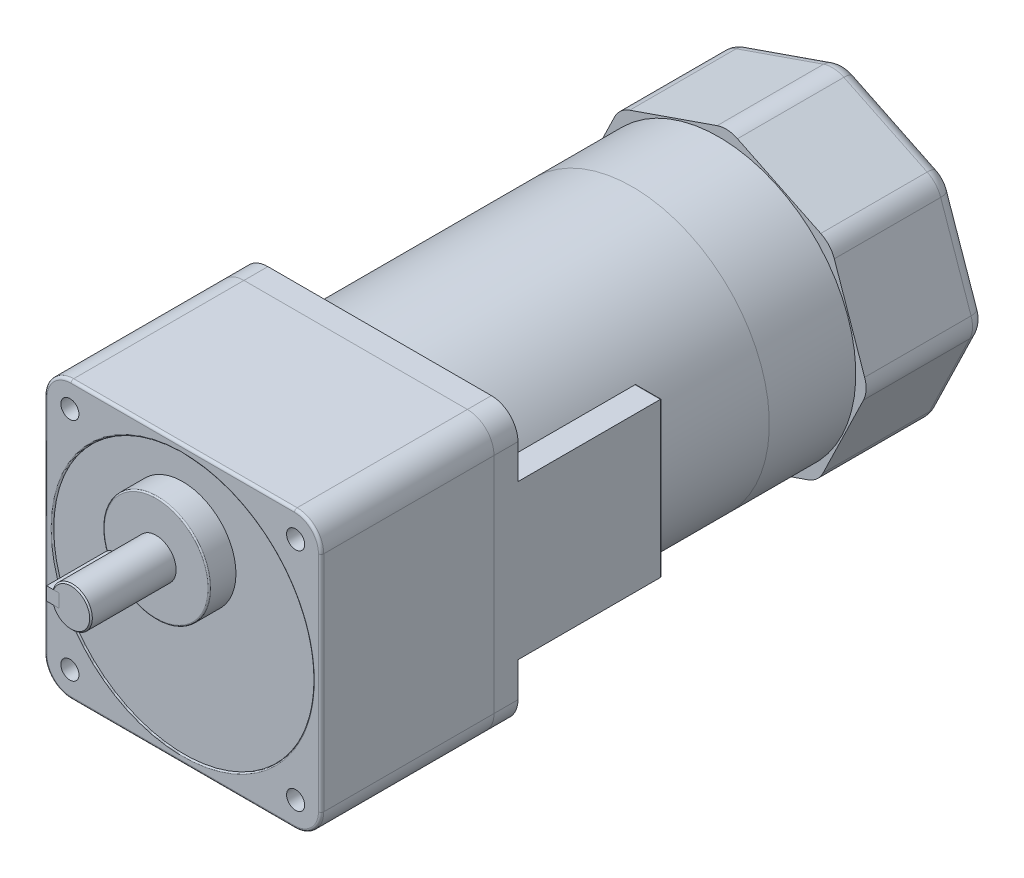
ISO-10303-21;
HEADER;
FILE_DESCRIPTION(('STEP AP214'),'2;1');
FILE_NAME('part.step','',(''),(''),'','','');
FILE_SCHEMA(('AUTOMOTIVE_DESIGN { 1 0 10303 214 1 1 1 1 }'));
ENDSEC;
DATA;
#1=APPLICATION_CONTEXT('core data for automotive mechanical design processes');
#2=APPLICATION_PROTOCOL_DEFINITION('international standard','automotive_design',2000,#1);
#3=PRODUCT_CONTEXT('',#1,'mechanical');
#4=PRODUCT('Part','Part','',(#3));
#5=PRODUCT_RELATED_PRODUCT_CATEGORY('part','',(#4));
#6=PRODUCT_DEFINITION_FORMATION('','',#4);
#7=PRODUCT_DEFINITION_CONTEXT('part definition',#1,'design');
#8=PRODUCT_DEFINITION('design','',#6,#7);
#9=PRODUCT_DEFINITION_SHAPE('','',#8);
#10=(LENGTH_UNIT() NAMED_UNIT(*) SI_UNIT(.MILLI.,.METRE.));
#11=(NAMED_UNIT(*) PLANE_ANGLE_UNIT() SI_UNIT($,.RADIAN.));
#12=(NAMED_UNIT(*) SI_UNIT($,.STERADIAN.) SOLID_ANGLE_UNIT());
#13=UNCERTAINTY_MEASURE_WITH_UNIT(LENGTH_MEASURE(1.E-05),#10,'distance_accuracy_value','');
#14=(GEOMETRIC_REPRESENTATION_CONTEXT(3) GLOBAL_UNCERTAINTY_ASSIGNED_CONTEXT((#13)) GLOBAL_UNIT_ASSIGNED_CONTEXT((#10,
#11,#12)) REPRESENTATION_CONTEXT('',''));
#15=CARTESIAN_POINT('',(0.,0.,0.));
#16=DIRECTION('',(0.,0.,1.));
#17=DIRECTION('',(1.,0.,0.));
#18=AXIS2_PLACEMENT_3D('',#15,#16,#17);
#19=CARTESIAN_POINT('',(-9.5,20.,84.5));
#20=DIRECTION('',(1.,0.,0.));
#21=DIRECTION('',(0.,0.,-1.));
#22=AXIS2_PLACEMENT_3D('',#19,#20,#21);
#23=CYLINDRICAL_SURFACE('',#22,2.5);
#24=DIRECTION('',(1.,0.,0.));
#25=VECTOR('',#24,1.);
#26=CARTESIAN_POINT('',(-9.5,17.5,84.5));
#27=LINE('',#26,#25);
#28=CARTESIAN_POINT('',(-9.20000000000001,17.5,84.5));
#29=VERTEX_POINT('',#28);
#30=CARTESIAN_POINT('',(-4.5,17.5,84.5));
#31=VERTEX_POINT('',#30);
#32=EDGE_CURVE('E100',#29,#31,#27,.T.);
#33=ORIENTED_EDGE('',*,*,#32,.F.);
#34=CARTESIAN_POINT('',(-9.20000000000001,20.,84.5));
#35=DIRECTION('',(-1.,0.,0.));
#36=DIRECTION('',(0.,0.,1.));
#37=AXIS2_PLACEMENT_3D('',#34,#35,#36);
#38=CIRCLE('',#37,2.5);
#39=CARTESIAN_POINT('',(-9.20000000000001,22.5,84.5));
#40=VERTEX_POINT('',#39);
#41=EDGE_CURVE('E12',#29,#40,#38,.F.);
#42=ORIENTED_EDGE('',*,*,#41,.T.);
#43=DIRECTION('',(1.,0.,0.));
#44=VECTOR('',#43,1.);
#45=CARTESIAN_POINT('',(-9.5,22.5,84.5));
#46=LINE('',#45,#44);
#47=CARTESIAN_POINT('',(-4.5,22.5,84.5));
#48=VERTEX_POINT('',#47);
#49=EDGE_CURVE('E120',#40,#48,#46,.T.);
#50=ORIENTED_EDGE('',*,*,#49,.T.);
#51=CARTESIAN_POINT('',(-4.5,20.,84.5));
#52=DIRECTION('',(-1.,0.,0.));
#53=DIRECTION('',(0.,0.,1.));
#54=AXIS2_PLACEMENT_3D('',#51,#52,#53);
#55=CIRCLE('',#54,2.5);
#56=EDGE_CURVE('E115',#48,#31,#55,.T.);
#57=ORIENTED_EDGE('',*,*,#56,.T.);
#58=EDGE_LOOP('',(#33,#42,#50,#57));
#59=FACE_BOUND('',#58,.T.);
#60=ADVANCED_FACE('F48',(#59),#23,.T.);
#61=CARTESIAN_POINT('',(-9.5,17.5,107.));
#62=DIRECTION('',(0.,1.,0.));
#63=DIRECTION('',(0.,0.,1.));
#64=AXIS2_PLACEMENT_3D('',#61,#62,#63);
#65=PLANE('',#64);
#66=DIRECTION('',(1.,0.,0.));
#67=VECTOR('',#66,1.);
#68=CARTESIAN_POINT('',(-9.5,17.5,107.));
#69=LINE('',#68,#67);
#70=CARTESIAN_POINT('',(-9.20000000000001,17.5,107.));
#71=VERTEX_POINT('',#70);
#72=CARTESIAN_POINT('',(-4.5,17.5,107.));
#73=VERTEX_POINT('',#72);
#74=EDGE_CURVE('E109',#71,#73,#69,.T.);
#75=ORIENTED_EDGE('',*,*,#74,.F.);
#76=DIRECTION('',(0.,0.,-1.));
#77=VECTOR('',#76,1.);
#78=CARTESIAN_POINT('',(-9.20000000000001,17.5,84.5));
#79=LINE('',#78,#77);
#80=EDGE_CURVE('E57',#71,#29,#79,.T.);
#81=ORIENTED_EDGE('',*,*,#80,.T.);
#82=ORIENTED_EDGE('',*,*,#32,.T.);
#83=DIRECTION('',(0.,0.,1.));
#84=VECTOR('',#83,1.);
#85=CARTESIAN_POINT('',(-4.5,17.5,107.));
#86=LINE('',#85,#84);
#87=EDGE_CURVE('E103',#31,#73,#86,.T.);
#88=ORIENTED_EDGE('',*,*,#87,.T.);
#89=EDGE_LOOP('',(#75,#81,#82,#88));
#90=FACE_BOUND('',#89,.T.);
#91=ADVANCED_FACE('F102',(#90),#65,.F.);
#92=CARTESIAN_POINT('',(-9.5,22.5,107.));
#93=DIRECTION('',(0.,0.,-1.));
#94=DIRECTION('',(-1.,0.,0.));
#95=AXIS2_PLACEMENT_3D('',#92,#93,#94);
#96=PLANE('',#95);
#97=DIRECTION('',(1.,0.,0.));
#98=VECTOR('',#97,1.);
#99=CARTESIAN_POINT('',(-9.5,22.5,107.));
#100=LINE('',#99,#98);
#101=CARTESIAN_POINT('',(-9.20000000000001,22.5,107.));
#102=VERTEX_POINT('',#101);
#103=CARTESIAN_POINT('',(-4.5,22.5,107.));
#104=VERTEX_POINT('',#103);
#105=EDGE_CURVE('E130',#102,#104,#100,.T.);
#106=ORIENTED_EDGE('',*,*,#105,.F.);
#107=DIRECTION('',(0.,-1.,0.));
#108=VECTOR('',#107,1.);
#109=CARTESIAN_POINT('',(-9.20000000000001,17.5,107.));
#110=LINE('',#109,#108);
#111=EDGE_CURVE('E72',#102,#71,#110,.T.);
#112=ORIENTED_EDGE('',*,*,#111,.T.);
#113=ORIENTED_EDGE('',*,*,#74,.T.);
#114=DIRECTION('',(0.,1.,0.));
#115=VECTOR('',#114,1.);
#116=CARTESIAN_POINT('',(-4.5,22.5,107.));
#117=LINE('',#116,#115);
#118=EDGE_CURVE('E117',#73,#104,#117,.T.);
#119=ORIENTED_EDGE('',*,*,#118,.T.);
#120=EDGE_LOOP('',(#106,#112,#113,#119));
#121=FACE_BOUND('',#120,.T.);
#122=ADVANCED_FACE('F168',(#121),#96,.F.);
#123=CARTESIAN_POINT('',(-9.5,22.5,84.5));
#124=DIRECTION('',(0.,-1.,0.));
#125=DIRECTION('',(0.,0.,-1.));
#126=AXIS2_PLACEMENT_3D('',#123,#124,#125);
#127=PLANE('',#126);
#128=ORIENTED_EDGE('',*,*,#49,.F.);
#129=DIRECTION('',(0.,0.,1.));
#130=VECTOR('',#129,1.);
#131=CARTESIAN_POINT('',(-9.20000000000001,22.5,107.));
#132=LINE('',#131,#130);
#133=EDGE_CURVE('E141',#40,#102,#132,.T.);
#134=ORIENTED_EDGE('',*,*,#133,.T.);
#135=ORIENTED_EDGE('',*,*,#105,.T.);
#136=DIRECTION('',(0.,0.,-1.));
#137=VECTOR('',#136,1.);
#138=CARTESIAN_POINT('',(-4.5,22.5,84.5));
#139=LINE('',#138,#137);
#140=EDGE_CURVE('E127',#104,#48,#139,.T.);
#141=ORIENTED_EDGE('',*,*,#140,.T.);
#142=EDGE_LOOP('',(#128,#134,#135,#141));
#143=FACE_BOUND('',#142,.T.);
#144=ADVANCED_FACE('F167',(#143),#127,.F.);
#145=CARTESIAN_POINT('',(-9.5,20.,84.5));
#146=DIRECTION('',(-1.,0.,0.));
#147=DIRECTION('',(0.,0.,1.));
#148=AXIS2_PLACEMENT_3D('',#145,#146,#147);
#149=PLANE('',#148);
#150=DIRECTION('',(0.,1.,0.));
#151=VECTOR('',#150,1.);
#152=CARTESIAN_POINT('',(-9.5,22.5,106.7));
#153=LINE('',#152,#151);
#154=CARTESIAN_POINT('',(-9.5,17.8,106.7));
#155=VERTEX_POINT('',#154);
#156=CARTESIAN_POINT('',(-9.5,22.2,106.7));
#157=VERTEX_POINT('',#156);
#158=EDGE_CURVE('E136',#155,#157,#153,.T.);
#159=ORIENTED_EDGE('',*,*,#158,.T.);
#160=DIRECTION('',(0.,0.,-1.));
#161=VECTOR('',#160,1.);
#162=CARTESIAN_POINT('',(-9.5,22.2,84.5));
#163=LINE('',#162,#161);
#164=CARTESIAN_POINT('',(-9.5,22.2,84.5));
#165=VERTEX_POINT('',#164);
#166=EDGE_CURVE('E138',#157,#165,#163,.T.);
#167=ORIENTED_EDGE('',*,*,#166,.T.);
#168=CARTESIAN_POINT('',(-9.5,20.,84.5));
#169=DIRECTION('',(-1.,0.,0.));
#170=DIRECTION('',(0.,0.,1.));
#171=AXIS2_PLACEMENT_3D('',#168,#169,#170);
#172=CIRCLE('',#171,2.2);
#173=CARTESIAN_POINT('',(-9.5,17.8,84.5));
#174=VERTEX_POINT('',#173);
#175=EDGE_CURVE('E108',#165,#174,#172,.T.);
#176=ORIENTED_EDGE('',*,*,#175,.T.);
#177=DIRECTION('',(0.,0.,1.));
#178=VECTOR('',#177,1.);
#179=CARTESIAN_POINT('',(-9.5,17.8,107.));
#180=LINE('',#179,#178);
#181=EDGE_CURVE('E134',#174,#155,#180,.T.);
#182=ORIENTED_EDGE('',*,*,#181,.T.);
#183=EDGE_LOOP('',(#159,#167,#176,#182));
#184=FACE_BOUND('',#183,.T.);
#185=ADVANCED_FACE('F160',(#184),#149,.T.);
#186=CARTESIAN_POINT('',(-4.5,20.,84.5));
#187=DIRECTION('',(-1.,0.,0.));
#188=DIRECTION('',(0.,0.,1.));
#189=AXIS2_PLACEMENT_3D('',#186,#187,#188);
#190=PLANE('',#189);
#191=ORIENTED_EDGE('',*,*,#56,.F.);
#192=ORIENTED_EDGE('',*,*,#140,.F.);
#193=ORIENTED_EDGE('',*,*,#118,.F.);
#194=ORIENTED_EDGE('',*,*,#87,.F.);
#195=EDGE_LOOP('',(#191,#192,#193,#194));
#196=FACE_BOUND('',#195,.T.);
#197=ADVANCED_FACE('F113',(#196),#190,.F.);
#198=CARTESIAN_POINT('',(-9.5,17.8,84.5));
#199=DIRECTION('',(-0.707106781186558,-0.707106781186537,0.));
#200=DIRECTION('',(0.,0.,-1.));
#201=AXIS2_PLACEMENT_3D('',#198,#199,#200);
#202=PLANE('',#201);
#203=DIRECTION('',(-0.707106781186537,0.707106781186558,0.));
#204=VECTOR('',#203,1.);
#205=CARTESIAN_POINT('',(-9.20000000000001,17.5,84.5));
#206=LINE('',#205,#204);
#207=EDGE_CURVE('E124',#29,#174,#206,.T.);
#208=ORIENTED_EDGE('',*,*,#207,.F.);
#209=ORIENTED_EDGE('',*,*,#80,.F.);
#210=DIRECTION('',(-0.577350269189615,0.577350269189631,-0.577350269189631));
#211=VECTOR('',#210,1.);
#212=CARTESIAN_POINT('',(-16.8999999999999,25.2000000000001,99.2999999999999));
#213=LINE('',#212,#211);
#214=EDGE_CURVE('E52',#155,#71,#213,.F.);
#215=ORIENTED_EDGE('',*,*,#214,.F.);
#216=ORIENTED_EDGE('',*,*,#181,.F.);
#217=EDGE_LOOP('',(#208,#209,#215,#216));
#218=FACE_BOUND('',#217,.T.);
#219=ADVANCED_FACE('F50',(#218),#202,.T.);
#220=CARTESIAN_POINT('',(-9.5,20.,106.7));
#221=DIRECTION('',(-0.707106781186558,0.,0.707106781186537));
#222=DIRECTION('',(0.,-1.,0.));
#223=AXIS2_PLACEMENT_3D('',#220,#221,#222);
#224=PLANE('',#223);
#225=ORIENTED_EDGE('',*,*,#214,.T.);
#226=ORIENTED_EDGE('',*,*,#111,.F.);
#227=DIRECTION('',(-0.577350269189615,-0.577350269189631,-0.577350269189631));
#228=VECTOR('',#227,1.);
#229=CARTESIAN_POINT('',(-10.2333333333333,21.4666666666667,105.966666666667));
#230=LINE('',#229,#228);
#231=EDGE_CURVE('E148',#157,#102,#230,.F.);
#232=ORIENTED_EDGE('',*,*,#231,.F.);
#233=ORIENTED_EDGE('',*,*,#158,.F.);
#234=EDGE_LOOP('',(#225,#226,#232,#233));
#235=FACE_BOUND('',#234,.T.);
#236=ADVANCED_FACE('F185',(#235),#224,.T.);
#237=CARTESIAN_POINT('',(-9.5,20.,84.5));
#238=DIRECTION('',(1.,0.,0.));
#239=DIRECTION('',(0.,0.,-1.));
#240=AXIS2_PLACEMENT_3D('',#237,#238,#239);
#241=CONICAL_SURFACE('',#240,2.2,0.785398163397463);
#242=ORIENTED_EDGE('',*,*,#207,.T.);
#243=ORIENTED_EDGE('',*,*,#175,.F.);
#244=DIRECTION('',(-0.707106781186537,-0.707106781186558,0.));
#245=VECTOR('',#244,1.);
#246=CARTESIAN_POINT('',(-9.20000000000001,22.5,84.5));
#247=LINE('',#246,#245);
#248=EDGE_CURVE('E146',#40,#165,#247,.T.);
#249=ORIENTED_EDGE('',*,*,#248,.F.);
#250=ORIENTED_EDGE('',*,*,#41,.F.);
#251=EDGE_LOOP('',(#242,#243,#249,#250));
#252=FACE_BOUND('',#251,.T.);
#253=ADVANCED_FACE('F153',(#252),#241,.T.);
#254=CARTESIAN_POINT('',(-9.5,22.2,84.5));
#255=DIRECTION('',(-0.707106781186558,0.707106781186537,0.));
#256=DIRECTION('',(0.,0.,1.));
#257=AXIS2_PLACEMENT_3D('',#254,#255,#256);
#258=PLANE('',#257);
#259=ORIENTED_EDGE('',*,*,#231,.T.);
#260=ORIENTED_EDGE('',*,*,#133,.F.);
#261=ORIENTED_EDGE('',*,*,#248,.T.);
#262=ORIENTED_EDGE('',*,*,#166,.F.);
#263=EDGE_LOOP('',(#259,#260,#261,#262));
#264=FACE_BOUND('',#263,.T.);
#265=ADVANCED_FACE('F164',(#264),#258,.T.);
#266=CLOSED_SHELL('',(#60,#91,#122,#144,#185,#197,#219,#236,#253,#265));
#267=MANIFOLD_SOLID_BREP('B2',#266);
#268=CARTESIAN_POINT('',(0.,20.,107.));
#269=DIRECTION('',(0.,0.,-1.));
#270=DIRECTION('',(-1.,0.,0.));
#271=AXIS2_PLACEMENT_3D('',#268,#269,#270);
#272=CYLINDRICAL_SURFACE('',#271,7.5);
#273=CARTESIAN_POINT('',(0.,20.,75.));
#274=DIRECTION('',(0.,0.,1.));
#275=DIRECTION('',(1.,0.,0.));
#276=AXIS2_PLACEMENT_3D('',#273,#274,#275);
#277=CIRCLE('',#276,7.5);
#278=CARTESIAN_POINT('',(7.5,20.,75.));
#279=VERTEX_POINT('',#278);
#280=EDGE_CURVE('E339',#279,#279,#277,.T.);
#281=ORIENTED_EDGE('',*,*,#280,.T.);
#282=EDGE_LOOP('',(#281));
#283=FACE_BOUND('',#282,.T.);
#284=CARTESIAN_POINT('',(-7.07106781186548,22.5,84.5));
#285=CARTESIAN_POINT('',(-7.07105693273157,22.500008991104,84.4317929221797));
#286=CARTESIAN_POINT('',(-7.07205443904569,22.4972088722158,84.3635919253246));
#287=CARTESIAN_POINT('',(-7.07598524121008,22.4860604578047,84.2277189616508));
#288=CARTESIAN_POINT('',(-7.07891801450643,22.477713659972,84.160046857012));
#289=CARTESIAN_POINT('',(-7.08662705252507,22.455574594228,84.0259095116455));
#290=CARTESIAN_POINT('',(-7.09139784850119,22.4417984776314,83.9594412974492));
#291=CARTESIAN_POINT('',(-7.10262619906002,22.4089418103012,83.8279917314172));
#292=CARTESIAN_POINT('',(-7.10908381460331,22.3898610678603,83.7630104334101));
#293=CARTESIAN_POINT('',(-7.13069940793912,22.324915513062,83.5710384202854));
#294=CARTESIAN_POINT('',(-7.14811243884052,22.2713141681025,83.44682084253));
#295=CARTESIAN_POINT('',(-7.1869703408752,22.1451778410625,83.2091231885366));
#296=CARTESIAN_POINT('',(-7.20841768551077,22.0726312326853,83.0956497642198));
#297=CARTESIAN_POINT('',(-7.25386182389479,21.9076299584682,82.8782070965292));
#298=CARTESIAN_POINT('',(-7.27792189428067,21.8145628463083,82.7747148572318));
#299=CARTESIAN_POINT('',(-7.32534626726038,21.6124707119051,82.5844828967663));
#300=CARTESIAN_POINT('',(-7.34871044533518,21.5034428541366,82.497746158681));
#301=CARTESIAN_POINT('',(-7.39284706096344,21.2690092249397,82.3413017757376));
#302=CARTESIAN_POINT('',(-7.41353593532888,21.1432502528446,82.2720976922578));
#303=CARTESIAN_POINT('',(-7.44924021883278,20.8810730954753,82.1560192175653));
#304=CARTESIAN_POINT('',(-7.46425736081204,20.7446581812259,82.1091380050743));
#305=CARTESIAN_POINT('',(-7.48647677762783,20.4700733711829,82.0406607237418));
#306=CARTESIAN_POINT('',(-7.49393272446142,20.3321295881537,82.0182418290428));
#307=CARTESIAN_POINT('',(-7.50109021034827,20.0542474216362,81.9967092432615));
#308=CARTESIAN_POINT('',(-7.50079359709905,19.9143095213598,81.9975899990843));
#309=CARTESIAN_POINT('',(-7.49265096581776,19.6422403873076,82.0221107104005));
#310=CARTESIAN_POINT('',(-7.48510152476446,19.5100182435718,82.0448565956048));
#311=CARTESIAN_POINT('',(-7.46367401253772,19.2513898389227,82.1109829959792));
#312=CARTESIAN_POINT('',(-7.44979559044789,19.1249839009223,82.1543646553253));
#313=CARTESIAN_POINT('',(-7.41689170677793,18.8796184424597,82.2610534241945));
#314=CARTESIAN_POINT('',(-7.39780094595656,18.760778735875,82.3246151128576));
#315=CARTESIAN_POINT('',(-7.35645969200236,18.5351885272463,82.469649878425));
#316=CARTESIAN_POINT('',(-7.33420833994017,18.4284413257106,82.5511278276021));
#317=CARTESIAN_POINT('',(-7.28765679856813,18.2247566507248,82.734177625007));
#318=CARTESIAN_POINT('',(-7.26330946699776,18.128515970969,82.8365138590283));
#319=CARTESIAN_POINT('',(-7.21618726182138,17.9543199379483,83.0561037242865));
#320=CARTESIAN_POINT('',(-7.19341289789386,17.8763704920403,83.1733621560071));
#321=CARTESIAN_POINT('',(-7.15175078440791,17.7399916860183,83.4217004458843));
#322=CARTESIAN_POINT('',(-7.13292537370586,17.6818674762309,83.5529587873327));
#323=CARTESIAN_POINT('',(-7.10202742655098,17.5888494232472,83.8241174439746));
#324=CARTESIAN_POINT('',(-7.08994423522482,17.5539189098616,83.9640037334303));
#325=CARTESIAN_POINT('',(-7.078413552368,17.5208546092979,84.17104659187));
#326=CARTESIAN_POINT('',(-7.07566669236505,17.5130373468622,84.2366034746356));
#327=CARTESIAN_POINT('',(-7.07199258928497,17.502613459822,84.3680951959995));
#328=CARTESIAN_POINT('',(-7.0710629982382,17.5000001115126,84.434029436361));
#329=CARTESIAN_POINT('',(-7.07106781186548,17.5,84.5));
#330=B_SPLINE_CURVE_WITH_KNOTS('',3,(#284,#285,#286,#287,#288,#289,#290,#291,#292,#293,#294,
#295,#296,#297,#298,#299,#300,#301,#302,#303,#304,#305,#306,#307,#308,#309,#310,#311,#312,#313,
#314,#315,#316,#317,#318,#319,#320,#321,#322,#323,#324,#325,#326,#327,#328,#329),.UNSPECIFIED.,
.F.,.F.,(4,2,2,2,2,2,2,2,2,2,2,2,2,2,2,2,2,2,2,2,2,2,4),(0.,0.204546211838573,0.409037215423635,
0.612924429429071,0.816819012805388,1.22401016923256,1.63145179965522,2.05327864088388,
2.47518051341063,2.90809434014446,3.34087579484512,3.75860278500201,4.176230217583,
4.57747647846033,4.97874498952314,5.38529148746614,5.79194868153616,6.2177173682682,
6.643623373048,7.07581676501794,7.50732520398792,7.70536340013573,7.90314555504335),.UNSPECIFIED.);
#331=CARTESIAN_POINT('',(-7.07106781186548,22.5,84.5));
#332=VERTEX_POINT('',#331);
#333=CARTESIAN_POINT('',(-7.07106781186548,17.5,84.5));
#334=VERTEX_POINT('',#333);
#335=EDGE_CURVE('E46',#332,#334,#330,.T.);
#336=ORIENTED_EDGE('',*,*,#335,.F.);
#337=DIRECTION('',(0.,0.,-1.));
#338=VECTOR('',#337,1.);
#339=CARTESIAN_POINT('',(-7.07106781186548,22.5,107.));
#340=LINE('',#339,#338);
#341=CARTESIAN_POINT('',(-7.07106781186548,22.5,106.5));
#342=VERTEX_POINT('',#341);
#343=EDGE_CURVE('E330',#342,#332,#340,.T.);
#344=ORIENTED_EDGE('',*,*,#343,.F.);
#345=CARTESIAN_POINT('',(0.,20.,106.5));
#346=DIRECTION('',(0.,0.,1.));
#347=DIRECTION('',(1.,0.,0.));
#348=AXIS2_PLACEMENT_3D('',#345,#346,#347);
#349=CIRCLE('',#348,7.5);
#350=CARTESIAN_POINT('',(-7.07106781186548,17.5,106.5));
#351=VERTEX_POINT('',#350);
#352=EDGE_CURVE('E345',#342,#351,#349,.F.);
#353=ORIENTED_EDGE('',*,*,#352,.T.);
#354=DIRECTION('',(0.,0.,-1.));
#355=VECTOR('',#354,1.);
#356=CARTESIAN_POINT('',(-7.07106781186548,17.5,107.));
#357=LINE('',#356,#355);
#358=EDGE_CURVE('E280',#334,#351,#357,.F.);
#359=ORIENTED_EDGE('',*,*,#358,.F.);
#360=EDGE_LOOP('',(#336,#344,#353,#359));
#361=FACE_BOUND('',#360,.T.);
#362=ADVANCED_FACE('F260',(#283,#361),#272,.T.);
#363=CARTESIAN_POINT('',(0.,20.,107.));
#364=DIRECTION('',(0.,0.,1.));
#365=DIRECTION('',(1.,0.,0.));
#366=AXIS2_PLACEMENT_3D('',#363,#364,#365);
#367=PLANE('',#366);
#368=CARTESIAN_POINT('',(0.,20.,107.));
#369=DIRECTION('',(0.,0.,1.));
#370=DIRECTION('',(1.,0.,0.));
#371=AXIS2_PLACEMENT_3D('',#368,#369,#370);
#372=CIRCLE('',#371,7.);
#373=CARTESIAN_POINT('',(-6.53834841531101,17.5,107.));
#374=VERTEX_POINT('',#373);
#375=CARTESIAN_POINT('',(-6.53834841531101,22.5,107.));
#376=VERTEX_POINT('',#375);
#377=EDGE_CURVE('E342',#374,#376,#372,.T.);
#378=ORIENTED_EDGE('',*,*,#377,.T.);
#379=DIRECTION('',(-1.,0.,0.));
#380=VECTOR('',#379,1.);
#381=CARTESIAN_POINT('',(-4.5,22.5,107.));
#382=LINE('',#381,#380);
#383=CARTESIAN_POINT('',(-4.5,22.5,107.));
#384=VERTEX_POINT('',#383);
#385=EDGE_CURVE('E331',#384,#376,#382,.T.);
#386=ORIENTED_EDGE('',*,*,#385,.F.);
#387=DIRECTION('',(0.,-1.,0.));
#388=VECTOR('',#387,1.);
#389=CARTESIAN_POINT('',(-4.5,22.5,107.));
#390=LINE('',#389,#388);
#391=CARTESIAN_POINT('',(-4.5,17.5,107.));
#392=VERTEX_POINT('',#391);
#393=EDGE_CURVE('E318',#384,#392,#390,.T.);
#394=ORIENTED_EDGE('',*,*,#393,.T.);
#395=DIRECTION('',(-1.,0.,0.));
#396=VECTOR('',#395,1.);
#397=CARTESIAN_POINT('',(-4.5,17.5,107.));
#398=LINE('',#397,#396);
#399=EDGE_CURVE('E334',#392,#374,#398,.T.);
#400=ORIENTED_EDGE('',*,*,#399,.T.);
#401=EDGE_LOOP('',(#378,#386,#394,#400));
#402=FACE_BOUND('',#401,.T.);
#403=ADVANCED_FACE('F367',(#402),#367,.T.);
#404=CARTESIAN_POINT('',(0.,20.,107.));
#405=DIRECTION('',(0.,0.,-1.));
#406=DIRECTION('',(-1.,0.,0.));
#407=AXIS2_PLACEMENT_3D('',#404,#405,#406);
#408=CONICAL_SURFACE('',#407,7.,0.785398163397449);
#409=ORIENTED_EDGE('',*,*,#352,.F.);
#410=CARTESIAN_POINT('',(-11.0143547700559,22.5,102.705487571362));
#411=CARTESIAN_POINT('',(-10.6798349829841,22.5,103.031669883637));
#412=CARTESIAN_POINT('',(-10.3449877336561,22.5,103.357518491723));
#413=CARTESIAN_POINT('',(-9.67434994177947,22.5,104.008192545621));
#414=CARTESIAN_POINT('',(-9.3385594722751,22.5,104.333018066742));
#415=CARTESIAN_POINT('',(-8.6658920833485,22.5,104.981151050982));
#416=CARTESIAN_POINT('',(-8.32901590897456,22.5,105.304459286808));
#417=CARTESIAN_POINT('',(-7.65344263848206,22.5,105.949228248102));
#418=CARTESIAN_POINT('',(-7.31474539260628,22.5,106.270688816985));
#419=CARTESIAN_POINT('',(-6.80457575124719,22.5,106.750931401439));
#420=CARTESIAN_POINT('',(-6.6340879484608,22.5,106.910759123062));
#421=CARTESIAN_POINT('',(-6.29229590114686,22.5,107.229536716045));
#422=CARTESIAN_POINT('',(-6.12099166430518,22.5,107.38848659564));
#423=CARTESIAN_POINT('',(-5.77739778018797,22.5,107.705248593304));
#424=CARTESIAN_POINT('',(-5.60510833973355,22.5,107.863060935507));
#425=CARTESIAN_POINT('',(-5.25922656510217,22.5,108.177266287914));
#426=CARTESIAN_POINT('',(-5.08563418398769,22.5,108.333659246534));
#427=CARTESIAN_POINT('',(-4.73662813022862,22.5,108.644687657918));
#428=CARTESIAN_POINT('',(-4.56121310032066,22.5,108.799321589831));
#429=CARTESIAN_POINT('',(-4.20817217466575,22.5,109.106020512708));
#430=CARTESIAN_POINT('',(-4.03054650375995,22.5,109.258085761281));
#431=CARTESIAN_POINT('',(-3.76176911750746,22.5,109.483525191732));
#432=CARTESIAN_POINT('',(-3.67175442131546,22.5,109.558254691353));
#433=CARTESIAN_POINT('',(-3.49082532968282,22.5,109.706612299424));
#434=CARTESIAN_POINT('',(-3.399910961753,22.5,109.78024044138));
#435=CARTESIAN_POINT('',(-3.21698494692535,22.5,109.926189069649));
#436=CARTESIAN_POINT('',(-3.12497293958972,22.5,109.998509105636));
#437=CARTESIAN_POINT('',(-2.93965183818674,22.5,110.14148620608));
#438=CARTESIAN_POINT('',(-2.84634260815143,22.5,110.212143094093));
#439=CARTESIAN_POINT('',(-2.75227945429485,22.5,110.281795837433));
#440=B_SPLINE_CURVE_WITH_KNOTS('',3,(#410,#411,#412,#413,#414,#415,#416,#417,#418,#419,#420,
#421,#422,#423,#424,#425,#426,#427,#428,#429,#430,#431,#432,#433,#434,#435,#436,#437,#438,#439),
.UNSPECIFIED.,.F.,.F.,(4,2,2,2,2,2,2,2,2,2,2,2,2,2,4),(0.,1.4016744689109,2.80324322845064,
4.20399722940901,5.60486824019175,6.30593577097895,7.00699671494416,7.70791552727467,
8.40885971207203,9.11036980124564,9.81180911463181,10.1627784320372,10.5137370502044,
10.864814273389,11.2159285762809),.UNSPECIFIED.);
#441=EDGE_CURVE('E273',#342,#376,#440,.T.);
#442=ORIENTED_EDGE('',*,*,#441,.T.);
#443=ORIENTED_EDGE('',*,*,#377,.F.);
#444=CARTESIAN_POINT('',(-2.75227945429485,17.5,110.281795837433));
#445=CARTESIAN_POINT('',(-2.82551522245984,17.5,110.227577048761));
#446=CARTESIAN_POINT('',(-2.89828844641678,17.5,110.172740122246));
#447=CARTESIAN_POINT('',(-3.043018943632,17.5,110.062008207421));
#448=CARTESIAN_POINT('',(-3.11497626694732,17.5,110.006113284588));
#449=CARTESIAN_POINT('',(-3.32976761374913,17.5,109.837125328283));
#450=CARTESIAN_POINT('',(-3.47155558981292,17.5,109.722703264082));
#451=CARTESIAN_POINT('',(-3.75292181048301,17.5,109.491337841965));
#452=CARTESIAN_POINT('',(-3.8925011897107,17.5,109.3743958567));
#453=CARTESIAN_POINT('',(-4.17001061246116,17.5,109.138555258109));
#454=CARTESIAN_POINT('',(-4.30794054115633,17.5,109.019656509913));
#455=CARTESIAN_POINT('',(-4.5823789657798,17.5,108.78045226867));
#456=CARTESIAN_POINT('',(-4.71888850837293,17.5,108.660147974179));
#457=CARTESIAN_POINT('',(-4.99085017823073,17.5,108.418358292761));
#458=CARTESIAN_POINT('',(-5.1263023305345,17.5,108.296872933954));
#459=CARTESIAN_POINT('',(-5.5314179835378,17.5,107.930975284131));
#460=CARTESIAN_POINT('',(-5.79980668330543,17.5,107.685151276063));
#461=CARTESIAN_POINT('',(-6.14300557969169,17.5,107.367828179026));
#462=CARTESIAN_POINT('',(-6.21888659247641,17.5,107.297480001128));
#463=CARTESIAN_POINT('',(-6.37047314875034,17.5,107.156598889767));
#464=CARTESIAN_POINT('',(-6.44617869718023,17.5,107.086065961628));
#465=CARTESIAN_POINT('',(-6.67307720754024,17.5,106.874199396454));
#466=CARTESIAN_POINT('',(-6.8240348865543,17.5,106.732613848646));
#467=CARTESIAN_POINT('',(-7.31490063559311,17.5,106.27054247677));
#468=CARTESIAN_POINT('',(-7.65375215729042,17.5,105.948934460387));
#469=CARTESIAN_POINT('',(-8.32966336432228,17.5,105.30383974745));
#470=CARTESIAN_POINT('',(-8.66672303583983,17.5,104.98035303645));
#471=CARTESIAN_POINT('',(-9.3394195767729,17.5,104.332186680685));
#472=CARTESIAN_POINT('',(-9.67505698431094,17.5,104.00750759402));
#473=CARTESIAN_POINT('',(-10.3453568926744,17.5,103.357159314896));
#474=CARTESIAN_POINT('',(-10.6800194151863,17.5,103.031490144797));
#475=CARTESIAN_POINT('',(-11.0143547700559,17.5,102.705487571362));
#476=B_SPLINE_CURVE_WITH_KNOTS('',3,(#444,#445,#446,#447,#448,#449,#450,#451,#452,#453,#454,
#455,#456,#457,#458,#459,#460,#461,#462,#463,#464,#465,#466,#467,#468,#469,#470,#471,#472,#473,
#474,#475),.UNSPECIFIED.,.F.,.F.,(4,2,2,2,2,2,2,2,2,2,2,2,2,2,2,4),(0.,0.273355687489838,
0.546694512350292,1.09324270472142,1.63950035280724,2.18579581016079,2.73165523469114,
3.27750169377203,4.36933033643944,4.67975144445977,4.99016370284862,5.61105831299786,
7.01256945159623,8.41409138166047,9.81502466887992,11.215926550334),.UNSPECIFIED.);
#477=EDGE_CURVE('E348',#374,#351,#476,.T.);
#478=ORIENTED_EDGE('',*,*,#477,.T.);
#479=EDGE_LOOP('',(#409,#442,#443,#478));
#480=FACE_BOUND('',#479,.T.);
#481=ADVANCED_FACE('F262',(#480),#408,.T.);
#482=CARTESIAN_POINT('',(0.,20.,75.));
#483=DIRECTION('',(0.,0.,1.));
#484=DIRECTION('',(1.,0.,0.));
#485=AXIS2_PLACEMENT_3D('',#482,#483,#484);
#486=PLANE('',#485);
#487=ORIENTED_EDGE('',*,*,#280,.F.);
#488=EDGE_LOOP('',(#487));
#489=FACE_BOUND('',#488,.T.);
#490=ADVANCED_FACE('F366',(#489),#486,.F.);
#491=CARTESIAN_POINT('',(-4.5,20.,84.5));
#492=DIRECTION('',(-1.,0.,0.));
#493=DIRECTION('',(0.,0.,1.));
#494=AXIS2_PLACEMENT_3D('',#491,#492,#493);
#495=CYLINDRICAL_SURFACE('',#494,2.5);
#496=DIRECTION('',(-1.,0.,0.));
#497=VECTOR('',#496,1.);
#498=CARTESIAN_POINT('',(-4.5,22.5,84.5));
#499=LINE('',#498,#497);
#500=CARTESIAN_POINT('',(-4.5,22.5,84.5));
#501=VERTEX_POINT('',#500);
#502=EDGE_CURVE('E326',#501,#332,#499,.T.);
#503=ORIENTED_EDGE('',*,*,#502,.T.);
#504=ORIENTED_EDGE('',*,*,#335,.T.);
#505=DIRECTION('',(-1.,0.,0.));
#506=VECTOR('',#505,1.);
#507=CARTESIAN_POINT('',(-4.5,17.5,84.5));
#508=LINE('',#507,#506);
#509=CARTESIAN_POINT('',(-4.5,17.5,84.5));
#510=VERTEX_POINT('',#509);
#511=EDGE_CURVE('E327',#510,#334,#508,.T.);
#512=ORIENTED_EDGE('',*,*,#511,.F.);
#513=CARTESIAN_POINT('',(-4.5,20.,84.5));
#514=DIRECTION('',(1.,0.,0.));
#515=DIRECTION('',(0.,0.,-1.));
#516=AXIS2_PLACEMENT_3D('',#513,#514,#515);
#517=CIRCLE('',#516,2.5);
#518=EDGE_CURVE('E316',#510,#501,#517,.T.);
#519=ORIENTED_EDGE('',*,*,#518,.T.);
#520=EDGE_LOOP('',(#503,#504,#512,#519));
#521=FACE_BOUND('',#520,.T.);
#522=ADVANCED_FACE('F325',(#521),#495,.F.);
#523=CARTESIAN_POINT('',(-4.5,22.5,84.5));
#524=DIRECTION('',(0.,-1.,0.));
#525=DIRECTION('',(0.,0.,-1.));
#526=AXIS2_PLACEMENT_3D('',#523,#524,#525);
#527=PLANE('',#526);
#528=ORIENTED_EDGE('',*,*,#343,.T.);
#529=ORIENTED_EDGE('',*,*,#502,.F.);
#530=DIRECTION('',(0.,0.,1.));
#531=VECTOR('',#530,1.);
#532=CARTESIAN_POINT('',(-4.5,22.5,84.5));
#533=LINE('',#532,#531);
#534=EDGE_CURVE('E312',#501,#384,#533,.T.);
#535=ORIENTED_EDGE('',*,*,#534,.T.);
#536=ORIENTED_EDGE('',*,*,#385,.T.);
#537=ORIENTED_EDGE('',*,*,#441,.F.);
#538=EDGE_LOOP('',(#528,#529,#535,#536,#537));
#539=FACE_BOUND('',#538,.T.);
#540=ADVANCED_FACE('F329',(#539),#527,.T.);
#541=CARTESIAN_POINT('',(-4.5,17.5,107.));
#542=DIRECTION('',(0.,1.,0.));
#543=DIRECTION('',(0.,0.,1.));
#544=AXIS2_PLACEMENT_3D('',#541,#542,#543);
#545=PLANE('',#544);
#546=ORIENTED_EDGE('',*,*,#358,.T.);
#547=ORIENTED_EDGE('',*,*,#477,.F.);
#548=ORIENTED_EDGE('',*,*,#399,.F.);
#549=DIRECTION('',(0.,0.,-1.));
#550=VECTOR('',#549,1.);
#551=CARTESIAN_POINT('',(-4.5,17.5,107.));
#552=LINE('',#551,#550);
#553=EDGE_CURVE('E381',#392,#510,#552,.T.);
#554=ORIENTED_EDGE('',*,*,#553,.T.);
#555=ORIENTED_EDGE('',*,*,#511,.T.);
#556=EDGE_LOOP('',(#546,#547,#548,#554,#555));
#557=FACE_BOUND('',#556,.T.);
#558=ADVANCED_FACE('F357',(#557),#545,.T.);
#559=CARTESIAN_POINT('',(-4.5,20.,84.5));
#560=DIRECTION('',(1.,0.,0.));
#561=DIRECTION('',(0.,0.,-1.));
#562=AXIS2_PLACEMENT_3D('',#559,#560,#561);
#563=PLANE('',#562);
#564=ORIENTED_EDGE('',*,*,#518,.F.);
#565=ORIENTED_EDGE('',*,*,#553,.F.);
#566=ORIENTED_EDGE('',*,*,#393,.F.);
#567=ORIENTED_EDGE('',*,*,#534,.F.);
#568=EDGE_LOOP('',(#564,#565,#566,#567));
#569=FACE_BOUND('',#568,.T.);
#570=ADVANCED_FACE('F314',(#569),#563,.F.);
#571=CLOSED_SHELL('',(#362,#403,#481,#490,#522,#540,#558,#570));
#572=MANIFOLD_SOLID_BREP('B6',#571);
#573=CARTESIAN_POINT('',(0.,20.,75.));
#574=DIRECTION('',(0.,0.,-1.));
#575=DIRECTION('',(-1.,0.,0.));
#576=AXIS2_PLACEMENT_3D('',#573,#574,#575);
#577=CYLINDRICAL_SURFACE('',#576,20.);
#578=CARTESIAN_POINT('',(0.,20.,74.5));
#579=DIRECTION('',(0.,0.,1.));
#580=DIRECTION('',(1.,0.,0.));
#581=AXIS2_PLACEMENT_3D('',#578,#579,#580);
#582=CIRCLE('',#581,20.);
#583=CARTESIAN_POINT('',(20.,20.,74.5));
#584=VERTEX_POINT('',#583);
#585=EDGE_CURVE('E259',#584,#584,#582,.F.);
#586=ORIENTED_EDGE('',*,*,#585,.T.);
#587=EDGE_LOOP('',(#586));
#588=FACE_BOUND('',#587,.T.);
#589=CARTESIAN_POINT('',(0.,20.,65.));
#590=DIRECTION('',(0.,0.,1.));
#591=DIRECTION('',(1.,0.,0.));
#592=AXIS2_PLACEMENT_3D('',#589,#590,#591);
#593=CIRCLE('',#592,20.);
#594=CARTESIAN_POINT('',(20.,20.,65.));
#595=VERTEX_POINT('',#594);
#596=EDGE_CURVE('E461',#595,#595,#593,.T.);
#597=ORIENTED_EDGE('',*,*,#596,.T.);
#598=EDGE_LOOP('',(#597));
#599=FACE_BOUND('',#598,.T.);
#600=ADVANCED_FACE('F450',(#588,#599),#577,.T.);
#601=CARTESIAN_POINT('',(0.,20.,75.));
#602=DIRECTION('',(0.,0.,1.));
#603=DIRECTION('',(1.,0.,0.));
#604=AXIS2_PLACEMENT_3D('',#601,#602,#603);
#605=PLANE('',#604);
#606=CARTESIAN_POINT('',(0.,20.,75.));
#607=DIRECTION('',(0.,0.,1.));
#608=DIRECTION('',(1.,0.,0.));
#609=AXIS2_PLACEMENT_3D('',#606,#607,#608);
#610=CIRCLE('',#609,19.5);
#611=CARTESIAN_POINT('',(19.5,20.,75.));
#612=VERTEX_POINT('',#611);
#613=EDGE_CURVE('E457',#612,#612,#610,.T.);
#614=ORIENTED_EDGE('',*,*,#613,.T.);
#615=EDGE_LOOP('',(#614));
#616=FACE_BOUND('',#615,.T.);
#617=ADVANCED_FACE('F471',(#616),#605,.T.);
#618=CARTESIAN_POINT('',(0.,20.,65.));
#619=DIRECTION('',(0.,0.,1.));
#620=DIRECTION('',(1.,0.,0.));
#621=AXIS2_PLACEMENT_3D('',#618,#619,#620);
#622=PLANE('',#621);
#623=ORIENTED_EDGE('',*,*,#596,.F.);
#624=EDGE_LOOP('',(#623));
#625=FACE_BOUND('',#624,.T.);
#626=ADVANCED_FACE('F469',(#625),#622,.F.);
#627=CARTESIAN_POINT('',(0.,20.,74.5));
#628=DIRECTION('',(0.,0.,1.));
#629=DIRECTION('',(1.,0.,0.));
#630=AXIS2_PLACEMENT_3D('',#627,#628,#629);
#631=TOROIDAL_SURFACE('',#630,19.5,0.5);
#632=ORIENTED_EDGE('',*,*,#585,.F.);
#633=EDGE_LOOP('',(#632));
#634=FACE_BOUND('',#633,.T.);
#635=ORIENTED_EDGE('',*,*,#613,.F.);
#636=EDGE_LOOP('',(#635));
#637=FACE_BOUND('',#636,.T.);
#638=ADVANCED_FACE('F452',(#634,#637),#631,.T.);
#639=CLOSED_SHELL('',(#600,#617,#626,#638));
#640=MANIFOLD_SOLID_BREP('B40',#639);
#641=CARTESIAN_POINT('',(45.3825112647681,-2.66124468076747,-181.5));
#642=DIRECTION('',(0.,0.,1.));
#643=DIRECTION('',(1.,0.,0.));
#644=AXIS2_PLACEMENT_3D('',#641,#642,#643);
#645=CYLINDRICAL_SURFACE('',#644,10.);
#646=DIRECTION('',(0.,0.,1.));
#647=VECTOR('',#646,1.);
#648=CARTESIAN_POINT('',(54.3814408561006,-7.02235305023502,-181.5));
#649=LINE('',#648,#647);
#650=CARTESIAN_POINT('',(54.3814408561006,-7.02235305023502,-176.5));
#651=VERTEX_POINT('',#650);
#652=CARTESIAN_POINT('',(54.3814408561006,-7.02235305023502,-136.5));
#653=VERTEX_POINT('',#652);
#654=EDGE_CURVE('E674',#651,#653,#649,.T.);
#655=ORIENTED_EDGE('',*,*,#654,.F.);
#656=CARTESIAN_POINT('',(45.3825112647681,-2.66124468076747,-176.5));
#657=DIRECTION('',(0.,0.,-1.));
#658=DIRECTION('',(-1.,0.,0.));
#659=AXIS2_PLACEMENT_3D('',#656,#657,#658);
#660=CIRCLE('',#659,10.);
#661=CARTESIAN_POINT('',(54.8294847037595,0.618190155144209,-176.5));
#662=VERTEX_POINT('',#661);
#663=EDGE_CURVE('E448',#651,#662,#660,.F.);
#664=ORIENTED_EDGE('',*,*,#663,.T.);
#665=DIRECTION('',(0.,0.,1.));
#666=VECTOR('',#665,1.);
#667=CARTESIAN_POINT('',(54.8294847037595,0.618190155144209,-181.5));
#668=LINE('',#667,#666);
#669=CARTESIAN_POINT('',(54.8294847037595,0.618190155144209,-136.5));
#670=VERTEX_POINT('',#669);
#671=EDGE_CURVE('E695',#662,#670,#668,.T.);
#672=ORIENTED_EDGE('',*,*,#671,.T.);
#673=CARTESIAN_POINT('',(45.3825112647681,-2.66124468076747,-136.5));
#674=DIRECTION('',(0.,0.,-1.));
#675=DIRECTION('',(-1.,0.,0.));
#676=AXIS2_PLACEMENT_3D('',#673,#674,#675);
#677=CIRCLE('',#676,10.);
#678=EDGE_CURVE('E689',#670,#653,#677,.T.);
#679=ORIENTED_EDGE('',*,*,#678,.T.);
#680=EDGE_LOOP('',(#655,#664,#672,#679));
#681=FACE_BOUND('',#680,.T.);
#682=ADVANCED_FACE('F514',(#681),#645,.T.);
#683=CARTESIAN_POINT('',(54.3814408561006,-7.02235305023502,-181.5));
#684=DIRECTION('',(-0.899892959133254,0.436110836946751,0.));
#685=DIRECTION('',(-0.436110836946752,-0.899892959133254,0.));
#686=AXIS2_PLACEMENT_3D('',#683,#684,#685);
#687=PLANE('',#686);
#688=DIRECTION('',(0.,0.,1.));
#689=VECTOR('',#688,1.);
#690=CARTESIAN_POINT('',(39.2074268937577,-38.3331739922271,-181.5));
#691=LINE('',#690,#689);
#692=CARTESIAN_POINT('',(39.2074268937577,-38.3331739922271,-176.5));
#693=VERTEX_POINT('',#692);
#694=CARTESIAN_POINT('',(39.2074268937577,-38.3331739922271,-136.5));
#695=VERTEX_POINT('',#694);
#696=EDGE_CURVE('E683',#693,#695,#691,.T.);
#697=ORIENTED_EDGE('',*,*,#696,.F.);
#698=DIRECTION('',(-0.436110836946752,-0.899892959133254,0.));
#699=VECTOR('',#698,1.);
#700=CARTESIAN_POINT('',(54.3814408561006,-7.02235305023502,-176.5));
#701=LINE('',#700,#699);
#702=EDGE_CURVE('E523',#693,#651,#701,.F.);
#703=ORIENTED_EDGE('',*,*,#702,.T.);
#704=ORIENTED_EDGE('',*,*,#654,.T.);
#705=DIRECTION('',(-0.436110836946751,-0.899892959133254,0.));
#706=VECTOR('',#705,1.);
#707=CARTESIAN_POINT('',(54.3814408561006,-7.02235305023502,-136.5));
#708=LINE('',#707,#706);
#709=EDGE_CURVE('E677',#653,#695,#708,.T.);
#710=ORIENTED_EDGE('',*,*,#709,.T.);
#711=EDGE_LOOP('',(#697,#703,#704,#710));
#712=FACE_BOUND('',#711,.T.);
#713=ADVANCED_FACE('F676',(#712),#687,.F.);
#714=CARTESIAN_POINT('',(30.2084973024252,-33.9720656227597,-181.5));
#715=DIRECTION('',(0.,0.,1.));
#716=DIRECTION('',(1.,0.,0.));
#717=AXIS2_PLACEMENT_3D('',#714,#715,#716);
#718=CYLINDRICAL_SURFACE('',#717,10.);
#719=DIRECTION('',(0.,0.,1.));
#720=VECTOR('',#719,1.);
#721=CARTESIAN_POINT('',(33.4879321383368,-43.4190390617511,-181.5));
#722=LINE('',#721,#720);
#723=CARTESIAN_POINT('',(33.4879321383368,-43.4190390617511,-176.5));
#724=VERTEX_POINT('',#723);
#725=CARTESIAN_POINT('',(33.4879321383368,-43.4190390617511,-136.5));
#726=VERTEX_POINT('',#725);
#727=EDGE_CURVE('E765',#724,#726,#722,.T.);
#728=ORIENTED_EDGE('',*,*,#727,.F.);
#729=CARTESIAN_POINT('',(30.2084973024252,-33.9720656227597,-176.5));
#730=DIRECTION('',(0.,0.,-1.));
#731=DIRECTION('',(-1.,0.,0.));
#732=AXIS2_PLACEMENT_3D('',#729,#730,#731);
#733=CIRCLE('',#732,10.);
#734=EDGE_CURVE('E538',#724,#693,#733,.F.);
#735=ORIENTED_EDGE('',*,*,#734,.T.);
#736=ORIENTED_EDGE('',*,*,#696,.T.);
#737=CARTESIAN_POINT('',(30.2084973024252,-33.9720656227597,-136.5));
#738=DIRECTION('',(0.,0.,-1.));
#739=DIRECTION('',(-1.,0.,0.));
#740=AXIS2_PLACEMENT_3D('',#737,#738,#739);
#741=CIRCLE('',#740,10.);
#742=EDGE_CURVE('E692',#695,#726,#741,.T.);
#743=ORIENTED_EDGE('',*,*,#742,.T.);
#744=EDGE_LOOP('',(#728,#735,#736,#743));
#745=FACE_BOUND('',#744,.T.);
#746=ADVANCED_FACE('F1003',(#745),#718,.T.);
#747=CARTESIAN_POINT('',(33.4879321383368,-43.4190390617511,-181.5));
#748=DIRECTION('',(-0.327943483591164,0.944697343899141,0.));
#749=DIRECTION('',(-0.944697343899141,-0.327943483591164,0.));
#750=AXIS2_PLACEMENT_3D('',#747,#748,#749);
#751=PLANE('',#750);
#752=DIRECTION('',(0.,0.,1.));
#753=VECTOR('',#752,1.);
#754=CARTESIAN_POINT('',(0.618190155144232,-54.8294847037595,-181.5));
#755=LINE('',#754,#753);
#756=CARTESIAN_POINT('',(0.618190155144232,-54.8294847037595,-176.5));
#757=VERTEX_POINT('',#756);
#758=CARTESIAN_POINT('',(0.618190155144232,-54.8294847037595,-136.5));
#759=VERTEX_POINT('',#758);
#760=EDGE_CURVE('E763',#757,#759,#755,.T.);
#761=ORIENTED_EDGE('',*,*,#760,.F.);
#762=DIRECTION('',(-0.944697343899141,-0.327943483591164,0.));
#763=VECTOR('',#762,1.);
#764=CARTESIAN_POINT('',(33.4879321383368,-43.4190390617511,-176.5));
#765=LINE('',#764,#763);
#766=EDGE_CURVE('E825',#757,#724,#765,.F.);
#767=ORIENTED_EDGE('',*,*,#766,.T.);
#768=ORIENTED_EDGE('',*,*,#727,.T.);
#769=DIRECTION('',(-0.944697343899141,-0.327943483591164,0.));
#770=VECTOR('',#769,1.);
#771=CARTESIAN_POINT('',(33.4879321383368,-43.4190390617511,-136.5));
#772=LINE('',#771,#770);
#773=EDGE_CURVE('E702',#726,#759,#772,.T.);
#774=ORIENTED_EDGE('',*,*,#773,.T.);
#775=EDGE_LOOP('',(#761,#767,#768,#774));
#776=FACE_BOUND('',#775,.T.);
#777=ADVANCED_FACE('F899',(#776),#751,.F.);
#778=CARTESIAN_POINT('',(-2.66124468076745,-45.3825112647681,-181.5));
#779=DIRECTION('',(0.,0.,1.));
#780=DIRECTION('',(1.,0.,0.));
#781=AXIS2_PLACEMENT_3D('',#778,#779,#780);
#782=CYLINDRICAL_SURFACE('',#781,10.);
#783=DIRECTION('',(0.,0.,1.));
#784=VECTOR('',#783,1.);
#785=CARTESIAN_POINT('',(-7.022353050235,-54.3814408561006,-181.5));
#786=LINE('',#785,#784);
#787=CARTESIAN_POINT('',(-7.022353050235,-54.3814408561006,-176.5));
#788=VERTEX_POINT('',#787);
#789=CARTESIAN_POINT('',(-7.022353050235,-54.3814408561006,-136.5));
#790=VERTEX_POINT('',#789);
#791=EDGE_CURVE('E761',#788,#790,#786,.T.);
#792=ORIENTED_EDGE('',*,*,#791,.F.);
#793=CARTESIAN_POINT('',(-2.66124468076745,-45.3825112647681,-176.5));
#794=DIRECTION('',(0.,0.,-1.));
#795=DIRECTION('',(-1.,0.,0.));
#796=AXIS2_PLACEMENT_3D('',#793,#794,#795);
#797=CIRCLE('',#796,10.);
#798=EDGE_CURVE('E823',#788,#757,#797,.F.);
#799=ORIENTED_EDGE('',*,*,#798,.T.);
#800=ORIENTED_EDGE('',*,*,#760,.T.);
#801=CARTESIAN_POINT('',(-2.66124468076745,-45.3825112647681,-136.5));
#802=DIRECTION('',(0.,0.,-1.));
#803=DIRECTION('',(-1.,0.,0.));
#804=AXIS2_PLACEMENT_3D('',#801,#802,#803);
#805=CIRCLE('',#804,10.);
#806=EDGE_CURVE('E705',#759,#790,#805,.T.);
#807=ORIENTED_EDGE('',*,*,#806,.T.);
#808=EDGE_LOOP('',(#792,#799,#800,#807));
#809=FACE_BOUND('',#808,.T.);
#810=ADVANCED_FACE('F897',(#809),#782,.T.);
#811=CARTESIAN_POINT('',(-7.022353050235,-54.3814408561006,-181.5));
#812=DIRECTION('',(0.436110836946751,0.899892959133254,0.));
#813=DIRECTION('',(-0.899892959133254,0.436110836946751,0.));
#814=AXIS2_PLACEMENT_3D('',#811,#812,#813);
#815=PLANE('',#814);
#816=DIRECTION('',(0.,0.,1.));
#817=VECTOR('',#816,1.);
#818=CARTESIAN_POINT('',(-38.3331739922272,-39.2074268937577,-181.5));
#819=LINE('',#818,#817);
#820=CARTESIAN_POINT('',(-38.3331739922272,-39.2074268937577,-176.5));
#821=VERTEX_POINT('',#820);
#822=CARTESIAN_POINT('',(-38.3331739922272,-39.2074268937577,-136.5));
#823=VERTEX_POINT('',#822);
#824=EDGE_CURVE('E759',#821,#823,#819,.T.);
#825=ORIENTED_EDGE('',*,*,#824,.F.);
#826=DIRECTION('',(-0.899892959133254,0.436110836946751,0.));
#827=VECTOR('',#826,1.);
#828=CARTESIAN_POINT('',(-7.022353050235,-54.3814408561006,-176.5));
#829=LINE('',#828,#827);
#830=EDGE_CURVE('E821',#821,#788,#829,.F.);
#831=ORIENTED_EDGE('',*,*,#830,.T.);
#832=ORIENTED_EDGE('',*,*,#791,.T.);
#833=DIRECTION('',(-0.899892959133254,0.436110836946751,0.));
#834=VECTOR('',#833,1.);
#835=CARTESIAN_POINT('',(-7.022353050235,-54.3814408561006,-136.5));
#836=LINE('',#835,#834);
#837=EDGE_CURVE('E708',#790,#823,#836,.T.);
#838=ORIENTED_EDGE('',*,*,#837,.T.);
#839=EDGE_LOOP('',(#825,#831,#832,#838));
#840=FACE_BOUND('',#839,.T.);
#841=ADVANCED_FACE('F906',(#840),#815,.F.);
#842=CARTESIAN_POINT('',(-33.9720656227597,-30.2084973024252,-181.5));
#843=DIRECTION('',(0.,0.,1.));
#844=DIRECTION('',(1.,0.,0.));
#845=AXIS2_PLACEMENT_3D('',#842,#843,#844);
#846=CYLINDRICAL_SURFACE('',#845,10.);
#847=DIRECTION('',(0.,0.,1.));
#848=VECTOR('',#847,1.);
#849=CARTESIAN_POINT('',(-43.4190390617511,-33.4879321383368,-181.5));
#850=LINE('',#849,#848);
#851=CARTESIAN_POINT('',(-43.4190390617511,-33.4879321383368,-176.5));
#852=VERTEX_POINT('',#851);
#853=CARTESIAN_POINT('',(-43.4190390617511,-33.4879321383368,-136.5));
#854=VERTEX_POINT('',#853);
#855=EDGE_CURVE('E757',#852,#854,#850,.T.);
#856=ORIENTED_EDGE('',*,*,#855,.F.);
#857=CARTESIAN_POINT('',(-33.9720656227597,-30.2084973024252,-176.5));
#858=DIRECTION('',(0.,0.,-1.));
#859=DIRECTION('',(-1.,0.,0.));
#860=AXIS2_PLACEMENT_3D('',#857,#858,#859);
#861=CIRCLE('',#860,10.);
#862=EDGE_CURVE('E819',#852,#821,#861,.F.);
#863=ORIENTED_EDGE('',*,*,#862,.T.);
#864=ORIENTED_EDGE('',*,*,#824,.T.);
#865=CARTESIAN_POINT('',(-33.9720656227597,-30.2084973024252,-136.5));
#866=DIRECTION('',(0.,0.,-1.));
#867=DIRECTION('',(-1.,0.,0.));
#868=AXIS2_PLACEMENT_3D('',#865,#866,#867);
#869=CIRCLE('',#868,10.);
#870=EDGE_CURVE('E711',#823,#854,#869,.T.);
#871=ORIENTED_EDGE('',*,*,#870,.T.);
#872=EDGE_LOOP('',(#856,#863,#864,#871));
#873=FACE_BOUND('',#872,.T.);
#874=ADVANCED_FACE('F909',(#873),#846,.T.);
#875=CARTESIAN_POINT('',(-43.4190390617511,-33.4879321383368,-181.5));
#876=DIRECTION('',(0.944697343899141,0.327943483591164,0.));
#877=DIRECTION('',(-0.327943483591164,0.944697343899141,0.));
#878=AXIS2_PLACEMENT_3D('',#875,#876,#877);
#879=PLANE('',#878);
#880=DIRECTION('',(0.,0.,1.));
#881=VECTOR('',#880,1.);
#882=CARTESIAN_POINT('',(-54.8294847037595,-0.618190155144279,-181.5));
#883=LINE('',#882,#881);
#884=CARTESIAN_POINT('',(-54.8294847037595,-0.618190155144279,-176.5));
#885=VERTEX_POINT('',#884);
#886=CARTESIAN_POINT('',(-54.8294847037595,-0.618190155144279,-136.5));
#887=VERTEX_POINT('',#886);
#888=EDGE_CURVE('E755',#885,#887,#883,.T.);
#889=ORIENTED_EDGE('',*,*,#888,.F.);
#890=DIRECTION('',(-0.327943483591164,0.944697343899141,0.));
#891=VECTOR('',#890,1.);
#892=CARTESIAN_POINT('',(-43.4190390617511,-33.4879321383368,-176.5));
#893=LINE('',#892,#891);
#894=EDGE_CURVE('E817',#885,#852,#893,.F.);
#895=ORIENTED_EDGE('',*,*,#894,.T.);
#896=ORIENTED_EDGE('',*,*,#855,.T.);
#897=DIRECTION('',(-0.327943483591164,0.944697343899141,0.));
#898=VECTOR('',#897,1.);
#899=CARTESIAN_POINT('',(-43.4190390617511,-33.4879321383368,-136.5));
#900=LINE('',#899,#898);
#901=EDGE_CURVE('E714',#854,#887,#900,.T.);
#902=ORIENTED_EDGE('',*,*,#901,.T.);
#903=EDGE_LOOP('',(#889,#895,#896,#902));
#904=FACE_BOUND('',#903,.T.);
#905=ADVANCED_FACE('F912',(#904),#879,.F.);
#906=CARTESIAN_POINT('',(-45.3825112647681,2.6612446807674,-181.5));
#907=DIRECTION('',(0.,0.,1.));
#908=DIRECTION('',(1.,0.,0.));
#909=AXIS2_PLACEMENT_3D('',#906,#907,#908);
#910=CYLINDRICAL_SURFACE('',#909,10.);
#911=DIRECTION('',(0.,0.,1.));
#912=VECTOR('',#911,1.);
#913=CARTESIAN_POINT('',(-54.3814408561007,7.02235305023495,-181.5));
#914=LINE('',#913,#912);
#915=CARTESIAN_POINT('',(-54.3814408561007,7.02235305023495,-176.5));
#916=VERTEX_POINT('',#915);
#917=CARTESIAN_POINT('',(-54.3814408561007,7.02235305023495,-136.5));
#918=VERTEX_POINT('',#917);
#919=EDGE_CURVE('E753',#916,#918,#914,.T.);
#920=ORIENTED_EDGE('',*,*,#919,.F.);
#921=CARTESIAN_POINT('',(-45.3825112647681,2.6612446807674,-176.5));
#922=DIRECTION('',(0.,0.,-1.));
#923=DIRECTION('',(-1.,0.,0.));
#924=AXIS2_PLACEMENT_3D('',#921,#922,#923);
#925=CIRCLE('',#924,10.);
#926=EDGE_CURVE('E815',#916,#885,#925,.F.);
#927=ORIENTED_EDGE('',*,*,#926,.T.);
#928=ORIENTED_EDGE('',*,*,#888,.T.);
#929=CARTESIAN_POINT('',(-45.3825112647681,2.6612446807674,-136.5));
#930=DIRECTION('',(0.,0.,-1.));
#931=DIRECTION('',(-1.,0.,0.));
#932=AXIS2_PLACEMENT_3D('',#929,#930,#931);
#933=CIRCLE('',#932,10.);
#934=EDGE_CURVE('E717',#887,#918,#933,.T.);
#935=ORIENTED_EDGE('',*,*,#934,.T.);
#936=EDGE_LOOP('',(#920,#927,#928,#935));
#937=FACE_BOUND('',#936,.T.);
#938=ADVANCED_FACE('F916',(#937),#910,.T.);
#939=CARTESIAN_POINT('',(-54.3814408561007,7.02235305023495,-181.5));
#940=DIRECTION('',(0.899892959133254,-0.436110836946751,0.));
#941=DIRECTION('',(0.436110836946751,0.899892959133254,0.));
#942=AXIS2_PLACEMENT_3D('',#939,#940,#941);
#943=PLANE('',#942);
#944=DIRECTION('',(0.,0.,1.));
#945=VECTOR('',#944,1.);
#946=CARTESIAN_POINT('',(-39.2074268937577,38.3331739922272,-181.5));
#947=LINE('',#946,#945);
#948=CARTESIAN_POINT('',(-39.2074268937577,38.3331739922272,-176.5));
#949=VERTEX_POINT('',#948);
#950=CARTESIAN_POINT('',(-39.2074268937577,38.3331739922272,-136.5));
#951=VERTEX_POINT('',#950);
#952=EDGE_CURVE('E751',#949,#951,#947,.T.);
#953=ORIENTED_EDGE('',*,*,#952,.F.);
#954=DIRECTION('',(0.436110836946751,0.899892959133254,0.));
#955=VECTOR('',#954,1.);
#956=CARTESIAN_POINT('',(-54.3814408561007,7.02235305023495,-176.5));
#957=LINE('',#956,#955);
#958=EDGE_CURVE('E813',#949,#916,#957,.F.);
#959=ORIENTED_EDGE('',*,*,#958,.T.);
#960=ORIENTED_EDGE('',*,*,#919,.T.);
#961=DIRECTION('',(0.436110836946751,0.899892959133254,0.));
#962=VECTOR('',#961,1.);
#963=CARTESIAN_POINT('',(-54.3814408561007,7.02235305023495,-136.5));
#964=LINE('',#963,#962);
#965=EDGE_CURVE('E720',#918,#951,#964,.T.);
#966=ORIENTED_EDGE('',*,*,#965,.T.);
#967=EDGE_LOOP('',(#953,#959,#960,#966));
#968=FACE_BOUND('',#967,.T.);
#969=ADVANCED_FACE('F989',(#968),#943,.F.);
#970=CARTESIAN_POINT('',(-30.2084973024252,33.9720656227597,-181.5));
#971=DIRECTION('',(0.,0.,1.));
#972=DIRECTION('',(1.,0.,0.));
#973=AXIS2_PLACEMENT_3D('',#970,#971,#972);
#974=CYLINDRICAL_SURFACE('',#973,9.99999999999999);
#975=DIRECTION('',(0.,0.,1.));
#976=VECTOR('',#975,1.);
#977=CARTESIAN_POINT('',(-33.4879321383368,43.4190390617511,-181.5));
#978=LINE('',#977,#976);
#979=CARTESIAN_POINT('',(-33.4879321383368,43.4190390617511,-176.5));
#980=VERTEX_POINT('',#979);
#981=CARTESIAN_POINT('',(-33.4879321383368,43.4190390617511,-136.5));
#982=VERTEX_POINT('',#981);
#983=EDGE_CURVE('E749',#980,#982,#978,.T.);
#984=ORIENTED_EDGE('',*,*,#983,.F.);
#985=CARTESIAN_POINT('',(-30.2084973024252,33.9720656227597,-176.5));
#986=DIRECTION('',(0.,0.,-1.));
#987=DIRECTION('',(-1.,0.,0.));
#988=AXIS2_PLACEMENT_3D('',#985,#986,#987);
#989=CIRCLE('',#988,9.99999999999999);
#990=EDGE_CURVE('E811',#980,#949,#989,.F.);
#991=ORIENTED_EDGE('',*,*,#990,.T.);
#992=ORIENTED_EDGE('',*,*,#952,.T.);
#993=CARTESIAN_POINT('',(-30.2084973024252,33.9720656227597,-136.5));
#994=DIRECTION('',(0.,0.,-1.));
#995=DIRECTION('',(-1.,0.,0.));
#996=AXIS2_PLACEMENT_3D('',#993,#994,#995);
#997=CIRCLE('',#996,9.99999999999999);
#998=EDGE_CURVE('E723',#951,#982,#997,.T.);
#999=ORIENTED_EDGE('',*,*,#998,.T.);
#1000=EDGE_LOOP('',(#984,#991,#992,#999));
#1001=FACE_BOUND('',#1000,.T.);
#1002=ADVANCED_FACE('F986',(#1001),#974,.T.);
#1003=CARTESIAN_POINT('',(-33.4879321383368,43.4190390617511,-181.5));
#1004=DIRECTION('',(0.327943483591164,-0.944697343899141,0.));
#1005=DIRECTION('',(0.944697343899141,0.327943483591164,0.));
#1006=AXIS2_PLACEMENT_3D('',#1003,#1004,#1005);
#1007=PLANE('',#1006);
#1008=DIRECTION('',(0.,0.,1.));
#1009=VECTOR('',#1008,1.);
#1010=CARTESIAN_POINT('',(-0.618190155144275,54.8294847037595,-181.5));
#1011=LINE('',#1010,#1009);
#1012=CARTESIAN_POINT('',(-0.618190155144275,54.8294847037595,-176.5));
#1013=VERTEX_POINT('',#1012);
#1014=CARTESIAN_POINT('',(-0.618190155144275,54.8294847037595,-136.5));
#1015=VERTEX_POINT('',#1014);
#1016=EDGE_CURVE('E747',#1013,#1015,#1011,.T.);
#1017=ORIENTED_EDGE('',*,*,#1016,.F.);
#1018=DIRECTION('',(0.944697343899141,0.327943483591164,0.));
#1019=VECTOR('',#1018,1.);
#1020=CARTESIAN_POINT('',(-33.4879321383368,43.4190390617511,-176.5));
#1021=LINE('',#1020,#1019);
#1022=EDGE_CURVE('E809',#1013,#980,#1021,.F.);
#1023=ORIENTED_EDGE('',*,*,#1022,.T.);
#1024=ORIENTED_EDGE('',*,*,#983,.T.);
#1025=DIRECTION('',(0.944697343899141,0.327943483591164,0.));
#1026=VECTOR('',#1025,1.);
#1027=CARTESIAN_POINT('',(-33.4879321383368,43.4190390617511,-136.5));
#1028=LINE('',#1027,#1026);
#1029=EDGE_CURVE('E726',#982,#1015,#1028,.T.);
#1030=ORIENTED_EDGE('',*,*,#1029,.T.);
#1031=EDGE_LOOP('',(#1017,#1023,#1024,#1030));
#1032=FACE_BOUND('',#1031,.T.);
#1033=ADVANCED_FACE('F983',(#1032),#1007,.F.);
#1034=CARTESIAN_POINT('',(2.66124468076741,45.3825112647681,-181.5));
#1035=DIRECTION('',(0.,0.,1.));
#1036=DIRECTION('',(1.,0.,0.));
#1037=AXIS2_PLACEMENT_3D('',#1034,#1035,#1036);
#1038=CYLINDRICAL_SURFACE('',#1037,9.99999999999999);
#1039=DIRECTION('',(0.,0.,1.));
#1040=VECTOR('',#1039,1.);
#1041=CARTESIAN_POINT('',(7.02235305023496,54.3814408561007,-181.5));
#1042=LINE('',#1041,#1040);
#1043=CARTESIAN_POINT('',(7.02235305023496,54.3814408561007,-176.5));
#1044=VERTEX_POINT('',#1043);
#1045=CARTESIAN_POINT('',(7.02235305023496,54.3814408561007,-136.5));
#1046=VERTEX_POINT('',#1045);
#1047=EDGE_CURVE('E745',#1044,#1046,#1042,.T.);
#1048=ORIENTED_EDGE('',*,*,#1047,.F.);
#1049=CARTESIAN_POINT('',(2.66124468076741,45.3825112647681,-176.5));
#1050=DIRECTION('',(0.,0.,-1.));
#1051=DIRECTION('',(-1.,0.,0.));
#1052=AXIS2_PLACEMENT_3D('',#1049,#1050,#1051);
#1053=CIRCLE('',#1052,9.99999999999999);
#1054=EDGE_CURVE('E807',#1044,#1013,#1053,.F.);
#1055=ORIENTED_EDGE('',*,*,#1054,.T.);
#1056=ORIENTED_EDGE('',*,*,#1016,.T.);
#1057=CARTESIAN_POINT('',(2.66124468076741,45.3825112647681,-136.5));
#1058=DIRECTION('',(0.,0.,-1.));
#1059=DIRECTION('',(1.,0.,0.));
#1060=AXIS2_PLACEMENT_3D('',#1057,#1058,#1059);
#1061=CIRCLE('',#1060,9.99999999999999);
#1062=EDGE_CURVE('E729',#1015,#1046,#1061,.T.);
#1063=ORIENTED_EDGE('',*,*,#1062,.T.);
#1064=EDGE_LOOP('',(#1048,#1055,#1056,#1063));
#1065=FACE_BOUND('',#1064,.T.);
#1066=ADVANCED_FACE('F978',(#1065),#1038,.T.);
#1067=CARTESIAN_POINT('',(7.02235305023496,54.3814408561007,-181.5));
#1068=DIRECTION('',(-0.436110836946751,-0.899892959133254,0.));
#1069=DIRECTION('',(0.899892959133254,-0.436110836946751,0.));
#1070=AXIS2_PLACEMENT_3D('',#1067,#1068,#1069);
#1071=PLANE('',#1070);
#1072=DIRECTION('',(0.,0.,1.));
#1073=VECTOR('',#1072,1.);
#1074=CARTESIAN_POINT('',(38.3331739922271,39.2074268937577,-181.5));
#1075=LINE('',#1074,#1073);
#1076=CARTESIAN_POINT('',(38.3331739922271,39.2074268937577,-176.5));
#1077=VERTEX_POINT('',#1076);
#1078=CARTESIAN_POINT('',(38.3331739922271,39.2074268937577,-136.5));
#1079=VERTEX_POINT('',#1078);
#1080=EDGE_CURVE('E743',#1077,#1079,#1075,.T.);
#1081=ORIENTED_EDGE('',*,*,#1080,.F.);
#1082=DIRECTION('',(0.899892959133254,-0.436110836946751,0.));
#1083=VECTOR('',#1082,1.);
#1084=CARTESIAN_POINT('',(7.02235305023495,54.3814408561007,-176.5));
#1085=LINE('',#1084,#1083);
#1086=EDGE_CURVE('E805',#1077,#1044,#1085,.F.);
#1087=ORIENTED_EDGE('',*,*,#1086,.T.);
#1088=ORIENTED_EDGE('',*,*,#1047,.T.);
#1089=DIRECTION('',(0.899892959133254,-0.436110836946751,0.));
#1090=VECTOR('',#1089,1.);
#1091=CARTESIAN_POINT('',(7.02235305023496,54.3814408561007,-136.5));
#1092=LINE('',#1091,#1090);
#1093=EDGE_CURVE('E732',#1046,#1079,#1092,.T.);
#1094=ORIENTED_EDGE('',*,*,#1093,.T.);
#1095=EDGE_LOOP('',(#1081,#1087,#1088,#1094));
#1096=FACE_BOUND('',#1095,.T.);
#1097=ADVANCED_FACE('F975',(#1096),#1071,.F.);
#1098=CARTESIAN_POINT('',(33.9720656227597,30.2084973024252,-181.5));
#1099=DIRECTION('',(0.,0.,1.));
#1100=DIRECTION('',(1.,0.,0.));
#1101=AXIS2_PLACEMENT_3D('',#1098,#1099,#1100);
#1102=CYLINDRICAL_SURFACE('',#1101,10.);
#1103=DIRECTION('',(0.,0.,1.));
#1104=VECTOR('',#1103,1.);
#1105=CARTESIAN_POINT('',(43.4190390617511,33.4879321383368,-181.5));
#1106=LINE('',#1105,#1104);
#1107=CARTESIAN_POINT('',(43.4190390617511,33.4879321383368,-176.5));
#1108=VERTEX_POINT('',#1107);
#1109=CARTESIAN_POINT('',(43.4190390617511,33.4879321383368,-136.5));
#1110=VERTEX_POINT('',#1109);
#1111=EDGE_CURVE('E741',#1108,#1110,#1106,.T.);
#1112=ORIENTED_EDGE('',*,*,#1111,.F.);
#1113=CARTESIAN_POINT('',(33.9720656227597,30.2084973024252,-176.5));
#1114=DIRECTION('',(0.,0.,-1.));
#1115=DIRECTION('',(-1.,0.,0.));
#1116=AXIS2_PLACEMENT_3D('',#1113,#1114,#1115);
#1117=CIRCLE('',#1116,10.);
#1118=EDGE_CURVE('E803',#1108,#1077,#1117,.F.);
#1119=ORIENTED_EDGE('',*,*,#1118,.T.);
#1120=ORIENTED_EDGE('',*,*,#1080,.T.);
#1121=CARTESIAN_POINT('',(33.9720656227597,30.2084973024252,-136.5));
#1122=DIRECTION('',(0.,0.,-1.));
#1123=DIRECTION('',(-1.,0.,0.));
#1124=AXIS2_PLACEMENT_3D('',#1121,#1122,#1123);
#1125=CIRCLE('',#1124,10.);
#1126=EDGE_CURVE('E735',#1079,#1110,#1125,.T.);
#1127=ORIENTED_EDGE('',*,*,#1126,.T.);
#1128=EDGE_LOOP('',(#1112,#1119,#1120,#1127));
#1129=FACE_BOUND('',#1128,.T.);
#1130=ADVANCED_FACE('F972',(#1129),#1102,.T.);
#1131=CARTESIAN_POINT('',(43.4190390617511,33.4879321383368,-181.5));
#1132=DIRECTION('',(-0.944697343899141,-0.327943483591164,0.));
#1133=DIRECTION('',(0.327943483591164,-0.944697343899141,0.));
#1134=AXIS2_PLACEMENT_3D('',#1131,#1132,#1133);
#1135=PLANE('',#1134);
#1136=ORIENTED_EDGE('',*,*,#671,.F.);
#1137=DIRECTION('',(0.327943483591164,-0.944697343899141,0.));
#1138=VECTOR('',#1137,1.);
#1139=CARTESIAN_POINT('',(43.4190390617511,33.4879321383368,-176.5));
#1140=LINE('',#1139,#1138);
#1141=EDGE_CURVE('E800',#662,#1108,#1140,.F.);
#1142=ORIENTED_EDGE('',*,*,#1141,.T.);
#1143=ORIENTED_EDGE('',*,*,#1111,.T.);
#1144=DIRECTION('',(0.327943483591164,-0.944697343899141,0.));
#1145=VECTOR('',#1144,1.);
#1146=CARTESIAN_POINT('',(43.4190390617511,33.4879321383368,-136.5));
#1147=LINE('',#1146,#1145);
#1148=EDGE_CURVE('E738',#1110,#670,#1147,.T.);
#1149=ORIENTED_EDGE('',*,*,#1148,.T.);
#1150=EDGE_LOOP('',(#1136,#1142,#1143,#1149));
#1151=FACE_BOUND('',#1150,.T.);
#1152=ADVANCED_FACE('F966',(#1151),#1135,.F.);
#1153=CARTESIAN_POINT('',(45.3825112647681,-2.66124468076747,-181.5));
#1154=DIRECTION('',(0.,0.,-1.));
#1155=DIRECTION('',(-1.,0.,0.));
#1156=AXIS2_PLACEMENT_3D('',#1153,#1154,#1155);
#1157=PLANE('',#1156);
#1158=CARTESIAN_POINT('',(33.9720656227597,30.2084973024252,-181.5));
#1159=DIRECTION('',(0.,0.,-1.));
#1160=DIRECTION('',(-1.,0.,0.));
#1161=AXIS2_PLACEMENT_3D('',#1158,#1159,#1160);
#1162=CIRCLE('',#1161,5.);
#1163=CARTESIAN_POINT('',(36.1526198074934,34.7079620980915,-181.5));
#1164=VERTEX_POINT('',#1163);
#1165=CARTESIAN_POINT('',(38.6955523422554,31.8482147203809,-181.5));
#1166=VERTEX_POINT('',#1165);
#1167=EDGE_CURVE('E795',#1164,#1166,#1162,.T.);
#1168=ORIENTED_EDGE('',*,*,#1167,.T.);
#1169=DIRECTION('',(0.327943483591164,-0.944697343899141,0.));
#1170=VECTOR('',#1169,1.);
#1171=CARTESIAN_POINT('',(50.1059979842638,-1.02152726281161,-181.5));
#1172=LINE('',#1171,#1170);
#1173=CARTESIAN_POINT('',(50.1059979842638,-1.02152726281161,-181.5));
#1174=VERTEX_POINT('',#1173);
#1175=EDGE_CURVE('E797',#1166,#1174,#1172,.T.);
#1176=ORIENTED_EDGE('',*,*,#1175,.T.);
#1177=CARTESIAN_POINT('',(45.3825112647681,-2.66124468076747,-181.5));
#1178=DIRECTION('',(0.,0.,-1.));
#1179=DIRECTION('',(-1.,0.,0.));
#1180=AXIS2_PLACEMENT_3D('',#1177,#1178,#1179);
#1181=CIRCLE('',#1180,5.);
#1182=CARTESIAN_POINT('',(49.8819760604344,-4.84179886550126,-181.5));
#1183=VERTEX_POINT('',#1182);
#1184=EDGE_CURVE('E682',#1174,#1183,#1181,.T.);
#1185=ORIENTED_EDGE('',*,*,#1184,.T.);
#1186=DIRECTION('',(-0.436110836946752,-0.899892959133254,0.));
#1187=VECTOR('',#1186,1.);
#1188=CARTESIAN_POINT('',(34.7079620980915,-36.1526198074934,-181.5));
#1189=LINE('',#1188,#1187);
#1190=CARTESIAN_POINT('',(34.7079620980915,-36.1526198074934,-181.5));
#1191=VERTEX_POINT('',#1190);
#1192=EDGE_CURVE('E769',#1183,#1191,#1189,.T.);
#1193=ORIENTED_EDGE('',*,*,#1192,.T.);
#1194=CARTESIAN_POINT('',(30.2084973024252,-33.9720656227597,-181.5));
#1195=DIRECTION('',(0.,0.,-1.));
#1196=DIRECTION('',(-1.,0.,0.));
#1197=AXIS2_PLACEMENT_3D('',#1194,#1195,#1196);
#1198=CIRCLE('',#1197,5.);
#1199=CARTESIAN_POINT('',(31.848214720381,-38.6955523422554,-181.5));
#1200=VERTEX_POINT('',#1199);
#1201=EDGE_CURVE('E771',#1191,#1200,#1198,.T.);
#1202=ORIENTED_EDGE('',*,*,#1201,.T.);
#1203=DIRECTION('',(-0.944697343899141,-0.327943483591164,0.));
#1204=VECTOR('',#1203,1.);
#1205=CARTESIAN_POINT('',(-1.02152726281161,-50.1059979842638,-181.5));
#1206=LINE('',#1205,#1204);
#1207=CARTESIAN_POINT('',(-1.02152726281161,-50.1059979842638,-181.5));
#1208=VERTEX_POINT('',#1207);
#1209=EDGE_CURVE('E773',#1200,#1208,#1206,.T.);
#1210=ORIENTED_EDGE('',*,*,#1209,.T.);
#1211=CARTESIAN_POINT('',(-2.66124468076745,-45.3825112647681,-181.5));
#1212=DIRECTION('',(0.,0.,-1.));
#1213=DIRECTION('',(-1.,0.,0.));
#1214=AXIS2_PLACEMENT_3D('',#1211,#1212,#1213);
#1215=CIRCLE('',#1214,5.);
#1216=CARTESIAN_POINT('',(-4.84179886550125,-49.8819760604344,-181.5));
#1217=VERTEX_POINT('',#1216);
#1218=EDGE_CURVE('E775',#1208,#1217,#1215,.T.);
#1219=ORIENTED_EDGE('',*,*,#1218,.T.);
#1220=DIRECTION('',(-0.899892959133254,0.436110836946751,0.));
#1221=VECTOR('',#1220,1.);
#1222=CARTESIAN_POINT('',(-36.1526198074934,-34.7079620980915,-181.5));
#1223=LINE('',#1222,#1221);
#1224=CARTESIAN_POINT('',(-36.1526198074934,-34.7079620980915,-181.5));
#1225=VERTEX_POINT('',#1224);
#1226=EDGE_CURVE('E777',#1217,#1225,#1223,.T.);
#1227=ORIENTED_EDGE('',*,*,#1226,.T.);
#1228=CARTESIAN_POINT('',(-33.9720656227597,-30.2084973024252,-181.5));
#1229=DIRECTION('',(0.,0.,-1.));
#1230=DIRECTION('',(-1.,0.,0.));
#1231=AXIS2_PLACEMENT_3D('',#1228,#1229,#1230);
#1232=CIRCLE('',#1231,5.);
#1233=CARTESIAN_POINT('',(-38.6955523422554,-31.848214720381,-181.5));
#1234=VERTEX_POINT('',#1233);
#1235=EDGE_CURVE('E779',#1225,#1234,#1232,.T.);
#1236=ORIENTED_EDGE('',*,*,#1235,.T.);
#1237=DIRECTION('',(-0.327943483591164,0.944697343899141,0.));
#1238=VECTOR('',#1237,1.);
#1239=CARTESIAN_POINT('',(-50.1059979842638,1.02152726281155,-181.5));
#1240=LINE('',#1239,#1238);
#1241=CARTESIAN_POINT('',(-50.1059979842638,1.02152726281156,-181.5));
#1242=VERTEX_POINT('',#1241);
#1243=EDGE_CURVE('E781',#1234,#1242,#1240,.T.);
#1244=ORIENTED_EDGE('',*,*,#1243,.T.);
#1245=CARTESIAN_POINT('',(-45.3825112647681,2.6612446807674,-181.5));
#1246=DIRECTION('',(0.,0.,-1.));
#1247=DIRECTION('',(-1.,0.,0.));
#1248=AXIS2_PLACEMENT_3D('',#1245,#1246,#1247);
#1249=CIRCLE('',#1248,5.);
#1250=CARTESIAN_POINT('',(-49.8819760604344,4.84179886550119,-181.5));
#1251=VERTEX_POINT('',#1250);
#1252=EDGE_CURVE('E783',#1242,#1251,#1249,.T.);
#1253=ORIENTED_EDGE('',*,*,#1252,.T.);
#1254=DIRECTION('',(0.436110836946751,0.899892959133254,0.));
#1255=VECTOR('',#1254,1.);
#1256=CARTESIAN_POINT('',(-34.7079620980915,36.1526198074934,-181.5));
#1257=LINE('',#1256,#1255);
#1258=CARTESIAN_POINT('',(-34.7079620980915,36.1526198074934,-181.5));
#1259=VERTEX_POINT('',#1258);
#1260=EDGE_CURVE('E785',#1251,#1259,#1257,.T.);
#1261=ORIENTED_EDGE('',*,*,#1260,.T.);
#1262=CARTESIAN_POINT('',(-30.2084973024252,33.9720656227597,-181.5));
#1263=DIRECTION('',(0.,0.,-1.));
#1264=DIRECTION('',(-1.,0.,0.));
#1265=AXIS2_PLACEMENT_3D('',#1262,#1263,#1264);
#1266=CIRCLE('',#1265,4.99999999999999);
#1267=CARTESIAN_POINT('',(-31.848214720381,38.6955523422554,-181.5));
#1268=VERTEX_POINT('',#1267);
#1269=EDGE_CURVE('E787',#1259,#1268,#1266,.T.);
#1270=ORIENTED_EDGE('',*,*,#1269,.T.);
#1271=DIRECTION('',(0.944697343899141,0.327943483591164,0.));
#1272=VECTOR('',#1271,1.);
#1273=CARTESIAN_POINT('',(1.02152726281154,50.1059979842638,-181.5));
#1274=LINE('',#1273,#1272);
#1275=CARTESIAN_POINT('',(1.02152726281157,50.1059979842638,-181.5));
#1276=VERTEX_POINT('',#1275);
#1277=EDGE_CURVE('E789',#1268,#1276,#1274,.T.);
#1278=ORIENTED_EDGE('',*,*,#1277,.T.);
#1279=CARTESIAN_POINT('',(2.66124468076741,45.3825112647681,-181.5));
#1280=DIRECTION('',(0.,0.,-1.));
#1281=DIRECTION('',(-1.,0.,0.));
#1282=AXIS2_PLACEMENT_3D('',#1279,#1280,#1281);
#1283=CIRCLE('',#1282,4.99999999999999);
#1284=CARTESIAN_POINT('',(4.8417988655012,49.8819760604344,-181.5));
#1285=VERTEX_POINT('',#1284);
#1286=EDGE_CURVE('E791',#1276,#1285,#1283,.T.);
#1287=ORIENTED_EDGE('',*,*,#1286,.T.);
#1288=DIRECTION('',(0.899892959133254,-0.436110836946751,0.));
#1289=VECTOR('',#1288,1.);
#1290=CARTESIAN_POINT('',(36.1526198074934,34.7079620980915,-181.5));
#1291=LINE('',#1290,#1289);
#1292=EDGE_CURVE('E793',#1285,#1164,#1291,.T.);
#1293=ORIENTED_EDGE('',*,*,#1292,.T.);
#1294=EDGE_LOOP('',(#1168,#1176,#1185,#1193,#1202,#1210,#1219,#1227,#1236,#1244,#1253,#1261,
#1270,#1278,#1287,#1293));
#1295=FACE_BOUND('',#1294,.T.);
#1296=ADVANCED_FACE('F881',(#1295),#1157,.T.);
#1297=CARTESIAN_POINT('',(45.3825112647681,-2.66124468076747,-136.5));
#1298=DIRECTION('',(0.,0.,-1.));
#1299=DIRECTION('',(-1.,0.,0.));
#1300=AXIS2_PLACEMENT_3D('',#1297,#1298,#1299);
#1301=PLANE('',#1300);
#1302=ORIENTED_EDGE('',*,*,#678,.F.);
#1303=ORIENTED_EDGE('',*,*,#1148,.F.);
#1304=ORIENTED_EDGE('',*,*,#1126,.F.);
#1305=ORIENTED_EDGE('',*,*,#1093,.F.);
#1306=ORIENTED_EDGE('',*,*,#1062,.F.);
#1307=ORIENTED_EDGE('',*,*,#1029,.F.);
#1308=ORIENTED_EDGE('',*,*,#998,.F.);
#1309=ORIENTED_EDGE('',*,*,#965,.F.);
#1310=ORIENTED_EDGE('',*,*,#934,.F.);
#1311=ORIENTED_EDGE('',*,*,#901,.F.);
#1312=ORIENTED_EDGE('',*,*,#870,.F.);
#1313=ORIENTED_EDGE('',*,*,#837,.F.);
#1314=ORIENTED_EDGE('',*,*,#806,.F.);
#1315=ORIENTED_EDGE('',*,*,#773,.F.);
#1316=ORIENTED_EDGE('',*,*,#742,.F.);
#1317=ORIENTED_EDGE('',*,*,#709,.F.);
#1318=EDGE_LOOP('',(#1302,#1303,#1304,#1305,#1306,#1307,#1308,#1309,#1310,#1311,#1312,#1313,
#1314,#1315,#1316,#1317));
#1319=FACE_BOUND('',#1318,.T.);
#1320=ADVANCED_FACE('F687',(#1319),#1301,.F.);
#1321=CARTESIAN_POINT('',(-38.6955523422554,-31.8482147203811,-176.5));
#1322=DIRECTION('',(0.327943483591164,-0.944697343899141,0.));
#1323=DIRECTION('',(0.944697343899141,0.327943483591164,0.));
#1324=AXIS2_PLACEMENT_3D('',#1321,#1322,#1323);
#1325=CYLINDRICAL_SURFACE('',#1324,5.);
#1326=CARTESIAN_POINT('',(-38.6955523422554,-31.848214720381,-176.5));
#1327=DIRECTION('',(0.327943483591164,-0.944697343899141,0.));
#1328=DIRECTION('',(0.944697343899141,0.327943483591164,0.));
#1329=AXIS2_PLACEMENT_3D('',#1326,#1327,#1328);
#1330=CIRCLE('',#1329,5.);
#1331=EDGE_CURVE('E699',#852,#1234,#1330,.T.);
#1332=ORIENTED_EDGE('',*,*,#1331,.F.);
#1333=ORIENTED_EDGE('',*,*,#894,.F.);
#1334=CARTESIAN_POINT('',(-50.1059979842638,1.02152726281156,-176.5));
#1335=DIRECTION('',(-0.327943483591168,0.94469734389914,0.));
#1336=DIRECTION('',(-0.94469734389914,-0.327943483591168,0.));
#1337=AXIS2_PLACEMENT_3D('',#1334,#1335,#1336);
#1338=CIRCLE('',#1337,5.);
#1339=EDGE_CURVE('E518',#1242,#885,#1338,.T.);
#1340=ORIENTED_EDGE('',*,*,#1339,.F.);
#1341=ORIENTED_EDGE('',*,*,#1243,.F.);
#1342=EDGE_LOOP('',(#1332,#1333,#1340,#1341));
#1343=FACE_BOUND('',#1342,.T.);
#1344=ADVANCED_FACE('F516',(#1343),#1325,.T.);
#1345=CARTESIAN_POINT('',(-45.3825112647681,2.6612446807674,-176.5));
#1346=DIRECTION('',(0.,0.,-1.));
#1347=DIRECTION('',(-1.,0.,0.));
#1348=AXIS2_PLACEMENT_3D('',#1345,#1346,#1347);
#1349=TOROIDAL_SURFACE('',#1348,5.,5.);
#1350=ORIENTED_EDGE('',*,*,#1339,.T.);
#1351=ORIENTED_EDGE('',*,*,#926,.F.);
#1352=CARTESIAN_POINT('',(-49.8819760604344,4.84179886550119,-176.5));
#1353=DIRECTION('',(0.436110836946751,0.899892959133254,0.));
#1354=DIRECTION('',(-0.899892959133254,0.436110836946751,0.));
#1355=AXIS2_PLACEMENT_3D('',#1352,#1353,#1354);
#1356=CIRCLE('',#1355,5.);
#1357=EDGE_CURVE('E866',#1251,#916,#1356,.T.);
#1358=ORIENTED_EDGE('',*,*,#1357,.F.);
#1359=ORIENTED_EDGE('',*,*,#1252,.F.);
#1360=EDGE_LOOP('',(#1350,#1351,#1358,#1359));
#1361=FACE_BOUND('',#1360,.T.);
#1362=ADVANCED_FACE('F920',(#1361),#1349,.T.);
#1363=CARTESIAN_POINT('',(-33.9720656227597,-30.2084973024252,-176.5));
#1364=DIRECTION('',(0.,0.,-1.));
#1365=DIRECTION('',(-1.,0.,0.));
#1366=AXIS2_PLACEMENT_3D('',#1363,#1364,#1365);
#1367=DEGENERATE_TOROIDAL_SURFACE('',#1366,5.,5.,.T.);
#1368=ORIENTED_EDGE('',*,*,#1331,.T.);
#1369=ORIENTED_EDGE('',*,*,#1235,.F.);
#1370=CARTESIAN_POINT('',(-36.1526198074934,-34.7079620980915,-176.5));
#1371=DIRECTION('',(0.899892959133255,-0.436110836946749,0.));
#1372=DIRECTION('',(0.436110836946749,0.899892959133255,0.));
#1373=AXIS2_PLACEMENT_3D('',#1370,#1371,#1372);
#1374=CIRCLE('',#1373,5.);
#1375=EDGE_CURVE('E863',#821,#1225,#1374,.T.);
#1376=ORIENTED_EDGE('',*,*,#1375,.F.);
#1377=ORIENTED_EDGE('',*,*,#862,.F.);
#1378=EDGE_LOOP('',(#1368,#1369,#1376,#1377));
#1379=FACE_BOUND('',#1378,.T.);
#1380=ADVANCED_FACE('F873',(#1379),#1367,.T.);
#1381=CARTESIAN_POINT('',(-34.7079620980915,36.1526198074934,-176.5));
#1382=DIRECTION('',(-0.436110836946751,-0.899892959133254,0.));
#1383=DIRECTION('',(0.899892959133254,-0.436110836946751,0.));
#1384=AXIS2_PLACEMENT_3D('',#1381,#1382,#1383);
#1385=CYLINDRICAL_SURFACE('',#1384,5.);
#1386=ORIENTED_EDGE('',*,*,#1357,.T.);
#1387=ORIENTED_EDGE('',*,*,#958,.F.);
#1388=CARTESIAN_POINT('',(-34.7079620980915,36.1526198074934,-176.5));
#1389=DIRECTION('',(0.436110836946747,0.899892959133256,0.));
#1390=DIRECTION('',(-0.899892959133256,0.436110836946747,0.));
#1391=AXIS2_PLACEMENT_3D('',#1388,#1389,#1390);
#1392=CIRCLE('',#1391,5.);
#1393=EDGE_CURVE('E860',#1259,#949,#1392,.T.);
#1394=ORIENTED_EDGE('',*,*,#1393,.F.);
#1395=ORIENTED_EDGE('',*,*,#1260,.F.);
#1396=EDGE_LOOP('',(#1386,#1387,#1394,#1395));
#1397=FACE_BOUND('',#1396,.T.);
#1398=ADVANCED_FACE('F924',(#1397),#1385,.T.);
#1399=CARTESIAN_POINT('',(17.2982949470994,-60.6116242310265,-176.5));
#1400=DIRECTION('',(0.899892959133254,-0.436110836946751,0.));
#1401=DIRECTION('',(0.436110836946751,0.899892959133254,0.));
#1402=AXIS2_PLACEMENT_3D('',#1399,#1400,#1401);
#1403=CYLINDRICAL_SURFACE('',#1402,5.);
#1404=ORIENTED_EDGE('',*,*,#1375,.T.);
#1405=ORIENTED_EDGE('',*,*,#1226,.F.);
#1406=CARTESIAN_POINT('',(-4.84179886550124,-49.8819760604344,-176.5));
#1407=DIRECTION('',(0.899892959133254,-0.436110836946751,0.));
#1408=DIRECTION('',(0.436110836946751,0.899892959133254,0.));
#1409=AXIS2_PLACEMENT_3D('',#1406,#1407,#1408);
#1410=CIRCLE('',#1409,5.);
#1411=EDGE_CURVE('E857',#788,#1217,#1410,.T.);
#1412=ORIENTED_EDGE('',*,*,#1411,.F.);
#1413=ORIENTED_EDGE('',*,*,#830,.F.);
#1414=EDGE_LOOP('',(#1404,#1405,#1412,#1413));
#1415=FACE_BOUND('',#1414,.T.);
#1416=ADVANCED_FACE('F887',(#1415),#1403,.T.);
#1417=CARTESIAN_POINT('',(-30.2084973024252,33.9720656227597,-176.5));
#1418=DIRECTION('',(0.,0.,-1.));
#1419=DIRECTION('',(-1.,0.,0.));
#1420=AXIS2_PLACEMENT_3D('',#1417,#1418,#1419);
#1421=DEGENERATE_TOROIDAL_SURFACE('',#1420,4.99999999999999,5.,.T.);
#1422=ORIENTED_EDGE('',*,*,#1393,.T.);
#1423=ORIENTED_EDGE('',*,*,#990,.F.);
#1424=CARTESIAN_POINT('',(-31.848214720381,38.6955523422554,-176.5));
#1425=DIRECTION('',(0.944697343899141,0.327943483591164,0.));
#1426=DIRECTION('',(-0.327943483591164,0.944697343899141,0.));
#1427=AXIS2_PLACEMENT_3D('',#1424,#1425,#1426);
#1428=CIRCLE('',#1427,5.);
#1429=EDGE_CURVE('E854',#1268,#980,#1428,.T.);
#1430=ORIENTED_EDGE('',*,*,#1429,.F.);
#1431=ORIENTED_EDGE('',*,*,#1269,.F.);
#1432=EDGE_LOOP('',(#1422,#1423,#1430,#1431));
#1433=FACE_BOUND('',#1432,.T.);
#1434=ADVANCED_FACE('F932',(#1433),#1421,.T.);
#1435=CARTESIAN_POINT('',(-2.66124468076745,-45.3825112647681,-176.5));
#1436=DIRECTION('',(0.,0.,-1.));
#1437=DIRECTION('',(-1.,0.,0.));
#1438=AXIS2_PLACEMENT_3D('',#1435,#1436,#1437);
#1439=TOROIDAL_SURFACE('',#1438,5.,5.);
#1440=ORIENTED_EDGE('',*,*,#1411,.T.);
#1441=ORIENTED_EDGE('',*,*,#1218,.F.);
#1442=CARTESIAN_POINT('',(-1.02152726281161,-50.1059979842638,-176.5));
#1443=DIRECTION('',(0.94469734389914,0.327943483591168,0.));
#1444=DIRECTION('',(-0.327943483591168,0.94469734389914,0.));
#1445=AXIS2_PLACEMENT_3D('',#1442,#1443,#1444);
#1446=CIRCLE('',#1445,5.);
#1447=EDGE_CURVE('E851',#757,#1208,#1446,.T.);
#1448=ORIENTED_EDGE('',*,*,#1447,.F.);
#1449=ORIENTED_EDGE('',*,*,#798,.F.);
#1450=EDGE_LOOP('',(#1440,#1441,#1448,#1449));
#1451=FACE_BOUND('',#1450,.T.);
#1452=ADVANCED_FACE('F891',(#1451),#1439,.T.);
#1453=CARTESIAN_POINT('',(24.2639447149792,58.1744014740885,-176.5));
#1454=DIRECTION('',(-0.944697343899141,-0.327943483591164,0.));
#1455=DIRECTION('',(0.327943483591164,-0.944697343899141,0.));
#1456=AXIS2_PLACEMENT_3D('',#1453,#1454,#1455);
#1457=CYLINDRICAL_SURFACE('',#1456,5.);
#1458=ORIENTED_EDGE('',*,*,#1429,.T.);
#1459=ORIENTED_EDGE('',*,*,#1022,.F.);
#1460=CARTESIAN_POINT('',(1.02152726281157,50.1059979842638,-176.5));
#1461=DIRECTION('',(0.94469734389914,0.327943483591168,0.));
#1462=DIRECTION('',(-0.327943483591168,0.94469734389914,0.));
#1463=AXIS2_PLACEMENT_3D('',#1460,#1461,#1462);
#1464=CIRCLE('',#1463,5.);
#1465=EDGE_CURVE('E848',#1276,#1013,#1464,.T.);
#1466=ORIENTED_EDGE('',*,*,#1465,.F.);
#1467=ORIENTED_EDGE('',*,*,#1277,.F.);
#1468=EDGE_LOOP('',(#1458,#1459,#1466,#1467));
#1469=FACE_BOUND('',#1468,.T.);
#1470=ADVANCED_FACE('F935',(#1469),#1457,.T.);
#1471=CARTESIAN_POINT('',(55.0906321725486,-30.6271488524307,-176.5));
#1472=DIRECTION('',(0.944697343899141,0.327943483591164,0.));
#1473=DIRECTION('',(-0.327943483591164,0.944697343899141,0.));
#1474=AXIS2_PLACEMENT_3D('',#1471,#1472,#1473);
#1475=CYLINDRICAL_SURFACE('',#1474,5.);
#1476=ORIENTED_EDGE('',*,*,#1447,.T.);
#1477=ORIENTED_EDGE('',*,*,#1209,.F.);
#1478=CARTESIAN_POINT('',(31.848214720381,-38.6955523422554,-176.5));
#1479=DIRECTION('',(0.944697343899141,0.327943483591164,0.));
#1480=DIRECTION('',(-0.327943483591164,0.944697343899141,0.));
#1481=AXIS2_PLACEMENT_3D('',#1478,#1479,#1480);
#1482=CIRCLE('',#1481,5.);
#1483=EDGE_CURVE('E845',#724,#1200,#1482,.T.);
#1484=ORIENTED_EDGE('',*,*,#1483,.F.);
#1485=ORIENTED_EDGE('',*,*,#766,.F.);
#1486=EDGE_LOOP('',(#1476,#1477,#1484,#1485));
#1487=FACE_BOUND('',#1486,.T.);
#1488=ADVANCED_FACE('F1023',(#1487),#1475,.T.);
#1489=CARTESIAN_POINT('',(2.66124468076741,45.3825112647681,-176.5));
#1490=DIRECTION('',(0.,0.,-1.));
#1491=DIRECTION('',(-1.,0.,0.));
#1492=AXIS2_PLACEMENT_3D('',#1489,#1490,#1491);
#1493=DEGENERATE_TOROIDAL_SURFACE('',#1492,4.99999999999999,5.,.T.);
#1494=ORIENTED_EDGE('',*,*,#1465,.T.);
#1495=ORIENTED_EDGE('',*,*,#1054,.F.);
#1496=CARTESIAN_POINT('',(4.8417988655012,49.8819760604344,-176.5));
#1497=DIRECTION('',(0.899892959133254,-0.436110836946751,0.));
#1498=DIRECTION('',(0.436110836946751,0.899892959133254,0.));
#1499=AXIS2_PLACEMENT_3D('',#1496,#1497,#1498);
#1500=CIRCLE('',#1499,5.);
#1501=EDGE_CURVE('E842',#1285,#1044,#1500,.T.);
#1502=ORIENTED_EDGE('',*,*,#1501,.F.);
#1503=ORIENTED_EDGE('',*,*,#1286,.F.);
#1504=EDGE_LOOP('',(#1494,#1495,#1502,#1503));
#1505=FACE_BOUND('',#1504,.T.);
#1506=ADVANCED_FACE('F940',(#1505),#1493,.T.);
#1507=CARTESIAN_POINT('',(30.2084973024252,-33.9720656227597,-176.5));
#1508=DIRECTION('',(0.,0.,-1.));
#1509=DIRECTION('',(-1.,0.,0.));
#1510=AXIS2_PLACEMENT_3D('',#1507,#1508,#1509);
#1511=DEGENERATE_TOROIDAL_SURFACE('',#1510,5.,5.,.T.);
#1512=ORIENTED_EDGE('',*,*,#1483,.T.);
#1513=ORIENTED_EDGE('',*,*,#1201,.F.);
#1514=CARTESIAN_POINT('',(34.7079620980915,-36.1526198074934,-176.5));
#1515=DIRECTION('',(0.436110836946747,0.899892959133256,0.));
#1516=DIRECTION('',(-0.899892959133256,0.436110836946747,0.));
#1517=AXIS2_PLACEMENT_3D('',#1514,#1515,#1516);
#1518=CIRCLE('',#1517,5.);
#1519=EDGE_CURVE('E839',#693,#1191,#1518,.T.);
#1520=ORIENTED_EDGE('',*,*,#1519,.F.);
#1521=ORIENTED_EDGE('',*,*,#734,.F.);
#1522=EDGE_LOOP('',(#1512,#1513,#1520,#1521));
#1523=FACE_BOUND('',#1522,.T.);
#1524=ADVANCED_FACE('F1017',(#1523),#1511,.T.);
#1525=CARTESIAN_POINT('',(58.292713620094,23.9783139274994,-176.5));
#1526=DIRECTION('',(-0.899892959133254,0.436110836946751,0.));
#1527=DIRECTION('',(-0.436110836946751,-0.899892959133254,0.));
#1528=AXIS2_PLACEMENT_3D('',#1525,#1526,#1527);
#1529=CYLINDRICAL_SURFACE('',#1528,5.);
#1530=ORIENTED_EDGE('',*,*,#1501,.T.);
#1531=ORIENTED_EDGE('',*,*,#1086,.F.);
#1532=CARTESIAN_POINT('',(36.1526198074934,34.7079620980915,-176.5));
#1533=DIRECTION('',(0.899892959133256,-0.436110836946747,0.));
#1534=DIRECTION('',(0.436110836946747,0.899892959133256,0.));
#1535=AXIS2_PLACEMENT_3D('',#1532,#1533,#1534);
#1536=CIRCLE('',#1535,5.);
#1537=EDGE_CURVE('E836',#1164,#1077,#1536,.T.);
#1538=ORIENTED_EDGE('',*,*,#1537,.F.);
#1539=ORIENTED_EDGE('',*,*,#1292,.F.);
#1540=EDGE_LOOP('',(#1530,#1531,#1538,#1539));
#1541=FACE_BOUND('',#1540,.T.);
#1542=ADVANCED_FACE('F947',(#1541),#1529,.T.);
#1543=CARTESIAN_POINT('',(49.8819760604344,-4.84179886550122,-176.5));
#1544=DIRECTION('',(0.436110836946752,0.899892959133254,0.));
#1545=DIRECTION('',(-0.899892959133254,0.436110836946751,0.));
#1546=AXIS2_PLACEMENT_3D('',#1543,#1544,#1545);
#1547=CYLINDRICAL_SURFACE('',#1546,5.);
#1548=ORIENTED_EDGE('',*,*,#1519,.T.);
#1549=ORIENTED_EDGE('',*,*,#1192,.F.);
#1550=CARTESIAN_POINT('',(49.8819760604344,-4.84179886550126,-176.5));
#1551=DIRECTION('',(0.436110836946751,0.899892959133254,0.));
#1552=DIRECTION('',(-0.899892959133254,0.436110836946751,0.));
#1553=AXIS2_PLACEMENT_3D('',#1550,#1551,#1552);
#1554=CIRCLE('',#1553,5.);
#1555=EDGE_CURVE('E833',#651,#1183,#1554,.T.);
#1556=ORIENTED_EDGE('',*,*,#1555,.F.);
#1557=ORIENTED_EDGE('',*,*,#702,.F.);
#1558=EDGE_LOOP('',(#1548,#1549,#1556,#1557));
#1559=FACE_BOUND('',#1558,.T.);
#1560=ADVANCED_FACE('F961',(#1559),#1547,.T.);
#1561=CARTESIAN_POINT('',(33.9720656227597,30.2084973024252,-176.5));
#1562=DIRECTION('',(0.,0.,-1.));
#1563=DIRECTION('',(-1.,0.,0.));
#1564=AXIS2_PLACEMENT_3D('',#1561,#1562,#1563);
#1565=TOROIDAL_SURFACE('',#1564,5.,5.);
#1566=ORIENTED_EDGE('',*,*,#1537,.T.);
#1567=ORIENTED_EDGE('',*,*,#1118,.F.);
#1568=CARTESIAN_POINT('',(38.6955523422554,31.8482147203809,-176.5));
#1569=DIRECTION('',(0.327943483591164,-0.944697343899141,0.));
#1570=DIRECTION('',(0.944697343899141,0.327943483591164,0.));
#1571=AXIS2_PLACEMENT_3D('',#1568,#1569,#1570);
#1572=CIRCLE('',#1571,5.);
#1573=EDGE_CURVE('E831',#1166,#1108,#1572,.T.);
#1574=ORIENTED_EDGE('',*,*,#1573,.F.);
#1575=ORIENTED_EDGE('',*,*,#1167,.F.);
#1576=EDGE_LOOP('',(#1566,#1567,#1574,#1575));
#1577=FACE_BOUND('',#1576,.T.);
#1578=ADVANCED_FACE('F950',(#1577),#1565,.T.);
#1579=CARTESIAN_POINT('',(45.3825112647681,-2.66124468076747,-176.5));
#1580=DIRECTION('',(0.,0.,-1.));
#1581=DIRECTION('',(-1.,0.,0.));
#1582=AXIS2_PLACEMENT_3D('',#1579,#1580,#1581);
#1583=TOROIDAL_SURFACE('',#1582,5.,5.);
#1584=ORIENTED_EDGE('',*,*,#1555,.T.);
#1585=ORIENTED_EDGE('',*,*,#1184,.F.);
#1586=CARTESIAN_POINT('',(50.1059979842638,-1.02152726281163,-176.5));
#1587=DIRECTION('',(-0.327943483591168,0.94469734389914,0.));
#1588=DIRECTION('',(-0.94469734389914,-0.327943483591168,0.));
#1589=AXIS2_PLACEMENT_3D('',#1586,#1587,#1588);
#1590=CIRCLE('',#1589,5.);
#1591=EDGE_CURVE('E829',#662,#1174,#1590,.T.);
#1592=ORIENTED_EDGE('',*,*,#1591,.F.);
#1593=ORIENTED_EDGE('',*,*,#663,.F.);
#1594=EDGE_LOOP('',(#1584,#1585,#1592,#1593));
#1595=FACE_BOUND('',#1594,.T.);
#1596=ADVANCED_FACE('F964',(#1595),#1583,.T.);
#1597=CARTESIAN_POINT('',(50.1059979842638,-1.02152726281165,-176.5));
#1598=DIRECTION('',(-0.327943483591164,0.944697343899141,0.));
#1599=DIRECTION('',(-0.944697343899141,-0.327943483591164,0.));
#1600=AXIS2_PLACEMENT_3D('',#1597,#1598,#1599);
#1601=CYLINDRICAL_SURFACE('',#1600,5.);
#1602=ORIENTED_EDGE('',*,*,#1573,.T.);
#1603=ORIENTED_EDGE('',*,*,#1141,.F.);
#1604=ORIENTED_EDGE('',*,*,#1591,.T.);
#1605=ORIENTED_EDGE('',*,*,#1175,.F.);
#1606=EDGE_LOOP('',(#1602,#1603,#1604,#1605));
#1607=FACE_BOUND('',#1606,.T.);
#1608=ADVANCED_FACE('F954',(#1607),#1601,.T.);
#1609=CLOSED_SHELL('',(#682,#713,#746,#777,#810,#841,#874,#905,#938,#969,#1002,#1033,#1066,
#1097,#1130,#1152,#1296,#1320,#1344,#1362,#1380,#1398,#1416,#1434,#1452,#1470,#1488,#1506,#1524,
#1542,#1560,#1578,#1596,#1608));
#1610=MANIFOLD_SOLID_BREP('B254',#1609);
#1611=CARTESIAN_POINT('',(0.,0.,-136.5));
#1612=DIRECTION('',(0.,0.,1.));
#1613=DIRECTION('',(1.,0.,0.));
#1614=AXIS2_PLACEMENT_3D('',#1611,#1612,#1613);
#1615=CYLINDRICAL_SURFACE('',#1614,51.5);
#1616=CARTESIAN_POINT('',(0.,0.,-136.5));
#1617=DIRECTION('',(0.,0.,-1.));
#1618=DIRECTION('',(-1.,0.,0.));
#1619=AXIS2_PLACEMENT_3D('',#1616,#1617,#1618);
#1620=CIRCLE('',#1619,51.5);
#1621=CARTESIAN_POINT('',(-51.5,0.,-136.5));
#1622=VERTEX_POINT('',#1621);
#1623=EDGE_CURVE('E513',#1622,#1622,#1620,.T.);
#1624=ORIENTED_EDGE('',*,*,#1623,.F.);
#1625=EDGE_LOOP('',(#1624));
#1626=FACE_BOUND('',#1625,.T.);
#1627=CARTESIAN_POINT('',(0.,0.,-104.));
#1628=DIRECTION('',(0.,0.,-1.));
#1629=DIRECTION('',(-1.,0.,0.));
#1630=AXIS2_PLACEMENT_3D('',#1627,#1628,#1629);
#1631=CIRCLE('',#1630,51.5);
#1632=CARTESIAN_POINT('',(-51.5,0.,-104.));
#1633=VERTEX_POINT('',#1632);
#1634=EDGE_CURVE('E1281',#1633,#1633,#1631,.T.);
#1635=ORIENTED_EDGE('',*,*,#1634,.T.);
#1636=EDGE_LOOP('',(#1635));
#1637=FACE_BOUND('',#1636,.T.);
#1638=ADVANCED_FACE('F1278',(#1626,#1637),#1615,.T.);
#1639=CARTESIAN_POINT('',(0.,0.,-136.5));
#1640=DIRECTION('',(0.,0.,-1.));
#1641=DIRECTION('',(-1.,0.,0.));
#1642=AXIS2_PLACEMENT_3D('',#1639,#1640,#1641);
#1643=PLANE('',#1642);
#1644=ORIENTED_EDGE('',*,*,#1623,.T.);
#1645=EDGE_LOOP('',(#1644));
#1646=FACE_BOUND('',#1645,.T.);
#1647=ADVANCED_FACE('F1293',(#1646),#1643,.T.);
#1648=CARTESIAN_POINT('',(0.,0.,-104.));
#1649=DIRECTION('',(0.,0.,-1.));
#1650=DIRECTION('',(-1.,0.,0.));
#1651=AXIS2_PLACEMENT_3D('',#1648,#1649,#1650);
#1652=PLANE('',#1651);
#1653=ORIENTED_EDGE('',*,*,#1634,.F.);
#1654=EDGE_LOOP('',(#1653));
#1655=FACE_BOUND('',#1654,.T.);
#1656=ADVANCED_FACE('F1291',(#1655),#1652,.F.);
#1657=CLOSED_SHELL('',(#1638,#1647,#1656));
#1658=MANIFOLD_SOLID_BREP('B442',#1657);
#1659=CARTESIAN_POINT('',(0.,0.,-104.));
#1660=DIRECTION('',(0.,0.,1.));
#1661=DIRECTION('',(1.,0.,0.));
#1662=AXIS2_PLACEMENT_3D('',#1659,#1660,#1661);
#1663=CYLINDRICAL_SURFACE('',#1662,51.5);
#1664=CARTESIAN_POINT('',(0.,0.,-104.));
#1665=DIRECTION('',(0.,0.,-1.));
#1666=DIRECTION('',(-1.,0.,0.));
#1667=AXIS2_PLACEMENT_3D('',#1664,#1665,#1666);
#1668=CIRCLE('',#1667,51.5);
#1669=CARTESIAN_POINT('',(-51.5,0.,-104.));
#1670=VERTEX_POINT('',#1669);
#1671=EDGE_CURVE('E1277',#1670,#1670,#1668,.T.);
#1672=ORIENTED_EDGE('',*,*,#1671,.F.);
#1673=EDGE_LOOP('',(#1672));
#1674=FACE_BOUND('',#1673,.T.);
#1675=CARTESIAN_POINT('',(0.,0.,-9.));
#1676=DIRECTION('',(0.,0.,-1.));
#1677=DIRECTION('',(-1.,0.,0.));
#1678=AXIS2_PLACEMENT_3D('',#1675,#1676,#1677);
#1679=CIRCLE('',#1678,51.5);
#1680=CARTESIAN_POINT('',(-51.5,0.,-9.));
#1681=VERTEX_POINT('',#1680);
#1682=EDGE_CURVE('E1332',#1681,#1681,#1679,.T.);
#1683=ORIENTED_EDGE('',*,*,#1682,.T.);
#1684=EDGE_LOOP('',(#1683));
#1685=FACE_BOUND('',#1684,.T.);
#1686=ADVANCED_FACE('F1329',(#1674,#1685),#1663,.T.);
#1687=CARTESIAN_POINT('',(0.,0.,-104.));
#1688=DIRECTION('',(0.,0.,-1.));
#1689=DIRECTION('',(-1.,0.,0.));
#1690=AXIS2_PLACEMENT_3D('',#1687,#1688,#1689);
#1691=PLANE('',#1690);
#1692=ORIENTED_EDGE('',*,*,#1671,.T.);
#1693=EDGE_LOOP('',(#1692));
#1694=FACE_BOUND('',#1693,.T.);
#1695=ADVANCED_FACE('F1344',(#1694),#1691,.T.);
#1696=CARTESIAN_POINT('',(0.,0.,-9.));
#1697=DIRECTION('',(0.,0.,-1.));
#1698=DIRECTION('',(-1.,0.,0.));
#1699=AXIS2_PLACEMENT_3D('',#1696,#1697,#1698);
#1700=PLANE('',#1699);
#1701=ORIENTED_EDGE('',*,*,#1682,.F.);
#1702=EDGE_LOOP('',(#1701));
#1703=FACE_BOUND('',#1702,.T.);
#1704=ADVANCED_FACE('F1342',(#1703),#1700,.F.);
#1705=CLOSED_SHELL('',(#1686,#1695,#1704));
#1706=MANIFOLD_SOLID_BREP('B508',#1705);
#1707=CARTESIAN_POINT('',(-42.,-42.,-9.));
#1708=DIRECTION('',(0.,0.,1.));
#1709=DIRECTION('',(1.,0.,0.));
#1710=AXIS2_PLACEMENT_3D('',#1707,#1708,#1709);
#1711=CYLINDRICAL_SURFACE('',#1710,10.);
#1712=CARTESIAN_POINT('',(-42.,-42.,0.));
#1713=DIRECTION('',(0.,0.,-1.));
#1714=DIRECTION('',(-1.,0.,0.));
#1715=AXIS2_PLACEMENT_3D('',#1712,#1713,#1714);
#1716=CIRCLE('',#1715,10.);
#1717=CARTESIAN_POINT('',(-41.9999999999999,-52.,0.));
#1718=VERTEX_POINT('',#1717);
#1719=CARTESIAN_POINT('',(-52.,-41.9999999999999,0.));
#1720=VERTEX_POINT('',#1719);
#1721=EDGE_CURVE('E1521',#1718,#1720,#1716,.T.);
#1722=ORIENTED_EDGE('',*,*,#1721,.T.);
#1723=DIRECTION('',(0.,0.,1.));
#1724=VECTOR('',#1723,1.);
#1725=CARTESIAN_POINT('',(-52.,-41.9999999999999,-9.));
#1726=LINE('',#1725,#1724);
#1727=CARTESIAN_POINT('',(-52.,-41.9999999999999,-9.));
#1728=VERTEX_POINT('',#1727);
#1729=EDGE_CURVE('E1532',#1728,#1720,#1726,.T.);
#1730=ORIENTED_EDGE('',*,*,#1729,.F.);
#1731=CARTESIAN_POINT('',(-42.,-42.,-9.));
#1732=DIRECTION('',(0.,0.,-1.));
#1733=DIRECTION('',(-1.,0.,0.));
#1734=AXIS2_PLACEMENT_3D('',#1731,#1732,#1733);
#1735=CIRCLE('',#1734,10.);
#1736=CARTESIAN_POINT('',(-41.9999999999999,-52.,-9.));
#1737=VERTEX_POINT('',#1736);
#1738=EDGE_CURVE('E1659',#1737,#1728,#1735,.T.);
#1739=ORIENTED_EDGE('',*,*,#1738,.F.);
#1740=DIRECTION('',(0.,0.,1.));
#1741=VECTOR('',#1740,1.);
#1742=CARTESIAN_POINT('',(-41.9999999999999,-52.,-9.));
#1743=LINE('',#1742,#1741);
#1744=EDGE_CURVE('E1697',#1737,#1718,#1743,.T.);
#1745=ORIENTED_EDGE('',*,*,#1744,.T.);
#1746=EDGE_LOOP('',(#1722,#1730,#1739,#1745));
#1747=FACE_BOUND('',#1746,.T.);
#1748=ADVANCED_FACE('F1379',(#1747),#1711,.T.);
#1749=CARTESIAN_POINT('',(-52.,41.9999999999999,-9.));
#1750=DIRECTION('',(1.,0.,0.));
#1751=DIRECTION('',(0.,0.,-1.));
#1752=AXIS2_PLACEMENT_3D('',#1749,#1750,#1751);
#1753=PLANE('',#1752);
#1754=DIRECTION('',(0.,1.,0.));
#1755=VECTOR('',#1754,1.);
#1756=CARTESIAN_POINT('',(-52.,41.9999999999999,0.));
#1757=LINE('',#1756,#1755);
#1758=CARTESIAN_POINT('',(-52.,41.9999999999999,0.));
#1759=VERTEX_POINT('',#1758);
#1760=EDGE_CURVE('E1712',#1720,#1759,#1757,.T.);
#1761=ORIENTED_EDGE('',*,*,#1760,.T.);
#1762=DIRECTION('',(0.,0.,1.));
#1763=VECTOR('',#1762,1.);
#1764=CARTESIAN_POINT('',(-52.,41.9999999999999,-9.));
#1765=LINE('',#1764,#1763);
#1766=CARTESIAN_POINT('',(-52.,41.9999999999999,-9.));
#1767=VERTEX_POINT('',#1766);
#1768=EDGE_CURVE('E1679',#1767,#1759,#1765,.T.);
#1769=ORIENTED_EDGE('',*,*,#1768,.F.);
#1770=DIRECTION('',(0.,1.,0.));
#1771=VECTOR('',#1770,1.);
#1772=CARTESIAN_POINT('',(-52.,41.9999999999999,-9.));
#1773=LINE('',#1772,#1771);
#1774=EDGE_CURVE('E1662',#1728,#1767,#1773,.T.);
#1775=ORIENTED_EDGE('',*,*,#1774,.F.);
#1776=ORIENTED_EDGE('',*,*,#1729,.T.);
#1777=EDGE_LOOP('',(#1761,#1769,#1775,#1776));
#1778=FACE_BOUND('',#1777,.T.);
#1779=ADVANCED_FACE('F1567',(#1778),#1753,.F.);
#1780=CARTESIAN_POINT('',(-42.,42.,-9.));
#1781=DIRECTION('',(0.,0.,1.));
#1782=DIRECTION('',(1.,0.,0.));
#1783=AXIS2_PLACEMENT_3D('',#1780,#1781,#1782);
#1784=CYLINDRICAL_SURFACE('',#1783,10.);
#1785=CARTESIAN_POINT('',(-42.,42.,0.));
#1786=DIRECTION('',(0.,0.,-1.));
#1787=DIRECTION('',(1.,0.,0.));
#1788=AXIS2_PLACEMENT_3D('',#1785,#1786,#1787);
#1789=CIRCLE('',#1788,10.);
#1790=CARTESIAN_POINT('',(-41.9999999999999,52.,0.));
#1791=VERTEX_POINT('',#1790);
#1792=EDGE_CURVE('E1710',#1759,#1791,#1789,.T.);
#1793=ORIENTED_EDGE('',*,*,#1792,.T.);
#1794=DIRECTION('',(0.,0.,1.));
#1795=VECTOR('',#1794,1.);
#1796=CARTESIAN_POINT('',(-41.9999999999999,52.,-9.));
#1797=LINE('',#1796,#1795);
#1798=CARTESIAN_POINT('',(-41.9999999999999,52.,-9.));
#1799=VERTEX_POINT('',#1798);
#1800=EDGE_CURVE('E1682',#1799,#1791,#1797,.T.);
#1801=ORIENTED_EDGE('',*,*,#1800,.F.);
#1802=CARTESIAN_POINT('',(-42.,42.,-9.));
#1803=DIRECTION('',(0.,0.,-1.));
#1804=DIRECTION('',(1.,0.,0.));
#1805=AXIS2_PLACEMENT_3D('',#1802,#1803,#1804);
#1806=CIRCLE('',#1805,10.);
#1807=EDGE_CURVE('E1665',#1767,#1799,#1806,.T.);
#1808=ORIENTED_EDGE('',*,*,#1807,.F.);
#1809=ORIENTED_EDGE('',*,*,#1768,.T.);
#1810=EDGE_LOOP('',(#1793,#1801,#1808,#1809));
#1811=FACE_BOUND('',#1810,.T.);
#1812=ADVANCED_FACE('F1572',(#1811),#1784,.T.);
#1813=CARTESIAN_POINT('',(41.9999999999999,52.,-9.));
#1814=DIRECTION('',(0.,-1.,0.));
#1815=DIRECTION('',(0.,0.,-1.));
#1816=AXIS2_PLACEMENT_3D('',#1813,#1814,#1815);
#1817=PLANE('',#1816);
#1818=DIRECTION('',(1.,0.,0.));
#1819=VECTOR('',#1818,1.);
#1820=CARTESIAN_POINT('',(41.9999999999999,52.,0.));
#1821=LINE('',#1820,#1819);
#1822=CARTESIAN_POINT('',(41.9999999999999,52.,0.));
#1823=VERTEX_POINT('',#1822);
#1824=EDGE_CURVE('E1708',#1791,#1823,#1821,.T.);
#1825=ORIENTED_EDGE('',*,*,#1824,.T.);
#1826=DIRECTION('',(0.,0.,1.));
#1827=VECTOR('',#1826,1.);
#1828=CARTESIAN_POINT('',(41.9999999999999,52.,-9.));
#1829=LINE('',#1828,#1827);
#1830=CARTESIAN_POINT('',(41.9999999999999,52.,-9.));
#1831=VERTEX_POINT('',#1830);
#1832=EDGE_CURVE('E1685',#1831,#1823,#1829,.T.);
#1833=ORIENTED_EDGE('',*,*,#1832,.F.);
#1834=DIRECTION('',(1.,0.,0.));
#1835=VECTOR('',#1834,1.);
#1836=CARTESIAN_POINT('',(41.9999999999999,52.,-9.));
#1837=LINE('',#1836,#1835);
#1838=EDGE_CURVE('E1667',#1799,#1831,#1837,.T.);
#1839=ORIENTED_EDGE('',*,*,#1838,.F.);
#1840=ORIENTED_EDGE('',*,*,#1800,.T.);
#1841=EDGE_LOOP('',(#1825,#1833,#1839,#1840));
#1842=FACE_BOUND('',#1841,.T.);
#1843=ADVANCED_FACE('F1579',(#1842),#1817,.F.);
#1844=CARTESIAN_POINT('',(42.,42.,-9.));
#1845=DIRECTION('',(0.,0.,1.));
#1846=DIRECTION('',(1.,0.,0.));
#1847=AXIS2_PLACEMENT_3D('',#1844,#1845,#1846);
#1848=CYLINDRICAL_SURFACE('',#1847,10.);
#1849=CARTESIAN_POINT('',(42.,42.,0.));
#1850=DIRECTION('',(0.,0.,-1.));
#1851=DIRECTION('',(-1.,0.,0.));
#1852=AXIS2_PLACEMENT_3D('',#1849,#1850,#1851);
#1853=CIRCLE('',#1852,10.);
#1854=CARTESIAN_POINT('',(52.,41.9999999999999,0.));
#1855=VERTEX_POINT('',#1854);
#1856=EDGE_CURVE('E1706',#1823,#1855,#1853,.T.);
#1857=ORIENTED_EDGE('',*,*,#1856,.T.);
#1858=DIRECTION('',(0.,0.,1.));
#1859=VECTOR('',#1858,1.);
#1860=CARTESIAN_POINT('',(52.,41.9999999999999,-9.));
#1861=LINE('',#1860,#1859);
#1862=CARTESIAN_POINT('',(52.,41.9999999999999,-9.));
#1863=VERTEX_POINT('',#1862);
#1864=EDGE_CURVE('E1688',#1863,#1855,#1861,.T.);
#1865=ORIENTED_EDGE('',*,*,#1864,.F.);
#1866=CARTESIAN_POINT('',(42.,42.,-9.));
#1867=DIRECTION('',(0.,0.,-1.));
#1868=DIRECTION('',(-1.,0.,0.));
#1869=AXIS2_PLACEMENT_3D('',#1866,#1867,#1868);
#1870=CIRCLE('',#1869,10.);
#1871=EDGE_CURVE('E1669',#1831,#1863,#1870,.T.);
#1872=ORIENTED_EDGE('',*,*,#1871,.F.);
#1873=ORIENTED_EDGE('',*,*,#1832,.T.);
#1874=EDGE_LOOP('',(#1857,#1865,#1872,#1873));
#1875=FACE_BOUND('',#1874,.T.);
#1876=ADVANCED_FACE('F1583',(#1875),#1848,.T.);
#1877=CARTESIAN_POINT('',(52.,41.9999999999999,-9.));
#1878=DIRECTION('',(-1.,0.,0.));
#1879=DIRECTION('',(0.,0.,1.));
#1880=AXIS2_PLACEMENT_3D('',#1877,#1878,#1879);
#1881=PLANE('',#1880);
#1882=DIRECTION('',(0.,0.,1.));
#1883=VECTOR('',#1882,1.);
#1884=CARTESIAN_POINT('',(52.,-29.,-63.));
#1885=LINE('',#1884,#1883);
#1886=CARTESIAN_POINT('',(52.,-29.,-62.5));
#1887=VERTEX_POINT('',#1886);
#1888=CARTESIAN_POINT('',(52.,-29.,-9.));
#1889=VERTEX_POINT('',#1888);
#1890=EDGE_CURVE('E1488',#1887,#1889,#1885,.T.);
#1891=ORIENTED_EDGE('',*,*,#1890,.F.);
#1892=DIRECTION('',(0.,-1.,0.));
#1893=VECTOR('',#1892,1.);
#1894=CARTESIAN_POINT('',(52.,41.9999999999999,-62.5));
#1895=LINE('',#1894,#1893);
#1896=CARTESIAN_POINT('',(52.,29.,-62.5));
#1897=VERTEX_POINT('',#1896);
#1898=EDGE_CURVE('E1327',#1887,#1897,#1895,.F.);
#1899=ORIENTED_EDGE('',*,*,#1898,.T.);
#1900=DIRECTION('',(0.,0.,1.));
#1901=VECTOR('',#1900,1.);
#1902=CARTESIAN_POINT('',(52.,29.,-63.));
#1903=LINE('',#1902,#1901);
#1904=CARTESIAN_POINT('',(52.,29.,-9.));
#1905=VERTEX_POINT('',#1904);
#1906=EDGE_CURVE('E1524',#1897,#1905,#1903,.T.);
#1907=ORIENTED_EDGE('',*,*,#1906,.T.);
#1908=DIRECTION('',(0.,-1.,0.));
#1909=VECTOR('',#1908,1.);
#1910=CARTESIAN_POINT('',(52.,41.9999999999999,-9.));
#1911=LINE('',#1910,#1909);
#1912=EDGE_CURVE('E1675',#1863,#1905,#1911,.T.);
#1913=ORIENTED_EDGE('',*,*,#1912,.F.);
#1914=ORIENTED_EDGE('',*,*,#1864,.T.);
#1915=DIRECTION('',(0.,-1.,0.));
#1916=VECTOR('',#1915,1.);
#1917=CARTESIAN_POINT('',(52.,41.9999999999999,0.));
#1918=LINE('',#1917,#1916);
#1919=CARTESIAN_POINT('',(52.,-41.9999999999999,0.));
#1920=VERTEX_POINT('',#1919);
#1921=EDGE_CURVE('E1704',#1855,#1920,#1918,.T.);
#1922=ORIENTED_EDGE('',*,*,#1921,.T.);
#1923=DIRECTION('',(0.,0.,1.));
#1924=VECTOR('',#1923,1.);
#1925=CARTESIAN_POINT('',(52.,-41.9999999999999,-9.));
#1926=LINE('',#1925,#1924);
#1927=CARTESIAN_POINT('',(52.,-41.9999999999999,-9.));
#1928=VERTEX_POINT('',#1927);
#1929=EDGE_CURVE('E1691',#1928,#1920,#1926,.T.);
#1930=ORIENTED_EDGE('',*,*,#1929,.F.);
#1931=EDGE_CURVE('E1509',#1889,#1928,#1911,.T.);
#1932=ORIENTED_EDGE('',*,*,#1931,.F.);
#1933=EDGE_LOOP('',(#1891,#1899,#1907,#1913,#1914,#1922,#1930,#1932));
#1934=FACE_BOUND('',#1933,.T.);
#1935=ADVANCED_FACE('F1587',(#1934),#1881,.F.);
#1936=CARTESIAN_POINT('',(42.,-42.,-9.));
#1937=DIRECTION('',(0.,0.,1.));
#1938=DIRECTION('',(1.,0.,0.));
#1939=AXIS2_PLACEMENT_3D('',#1936,#1937,#1938);
#1940=CYLINDRICAL_SURFACE('',#1939,10.);
#1941=CARTESIAN_POINT('',(42.,-42.,0.));
#1942=DIRECTION('',(0.,0.,-1.));
#1943=DIRECTION('',(-1.,0.,0.));
#1944=AXIS2_PLACEMENT_3D('',#1941,#1942,#1943);
#1945=CIRCLE('',#1944,10.);
#1946=CARTESIAN_POINT('',(41.9999999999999,-52.,0.));
#1947=VERTEX_POINT('',#1946);
#1948=EDGE_CURVE('E1702',#1920,#1947,#1945,.T.);
#1949=ORIENTED_EDGE('',*,*,#1948,.T.);
#1950=DIRECTION('',(0.,0.,1.));
#1951=VECTOR('',#1950,1.);
#1952=CARTESIAN_POINT('',(41.9999999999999,-52.,-9.));
#1953=LINE('',#1952,#1951);
#1954=CARTESIAN_POINT('',(41.9999999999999,-52.,-9.));
#1955=VERTEX_POINT('',#1954);
#1956=EDGE_CURVE('E1694',#1955,#1947,#1953,.T.);
#1957=ORIENTED_EDGE('',*,*,#1956,.F.);
#1958=CARTESIAN_POINT('',(42.,-42.,-9.));
#1959=DIRECTION('',(0.,0.,-1.));
#1960=DIRECTION('',(-1.,0.,0.));
#1961=AXIS2_PLACEMENT_3D('',#1958,#1959,#1960);
#1962=CIRCLE('',#1961,10.);
#1963=EDGE_CURVE('E1672',#1928,#1955,#1962,.T.);
#1964=ORIENTED_EDGE('',*,*,#1963,.F.);
#1965=ORIENTED_EDGE('',*,*,#1929,.T.);
#1966=EDGE_LOOP('',(#1949,#1957,#1964,#1965));
#1967=FACE_BOUND('',#1966,.T.);
#1968=ADVANCED_FACE('F1591',(#1967),#1940,.T.);
#1969=CARTESIAN_POINT('',(41.9999999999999,-52.,-9.));
#1970=DIRECTION('',(0.,1.,0.));
#1971=DIRECTION('',(0.,0.,1.));
#1972=AXIS2_PLACEMENT_3D('',#1969,#1970,#1971);
#1973=PLANE('',#1972);
#1974=DIRECTION('',(-1.,0.,0.));
#1975=VECTOR('',#1974,1.);
#1976=CARTESIAN_POINT('',(41.9999999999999,-52.,0.));
#1977=LINE('',#1976,#1975);
#1978=EDGE_CURVE('E1663',#1947,#1718,#1977,.T.);
#1979=ORIENTED_EDGE('',*,*,#1978,.T.);
#1980=ORIENTED_EDGE('',*,*,#1744,.F.);
#1981=DIRECTION('',(-1.,0.,0.));
#1982=VECTOR('',#1981,1.);
#1983=CARTESIAN_POINT('',(41.9999999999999,-52.,-9.));
#1984=LINE('',#1983,#1982);
#1985=EDGE_CURVE('E1700',#1955,#1737,#1984,.T.);
#1986=ORIENTED_EDGE('',*,*,#1985,.F.);
#1987=ORIENTED_EDGE('',*,*,#1956,.T.);
#1988=EDGE_LOOP('',(#1979,#1980,#1986,#1987));
#1989=FACE_BOUND('',#1988,.T.);
#1990=ADVANCED_FACE('F1594',(#1989),#1973,.F.);
#1991=CARTESIAN_POINT('',(-42.,-42.,-9.));
#1992=DIRECTION('',(0.,0.,-1.));
#1993=DIRECTION('',(-1.,0.,0.));
#1994=AXIS2_PLACEMENT_3D('',#1991,#1992,#1993);
#1995=PLANE('',#1994);
#1996=CARTESIAN_POINT('',(42.4264068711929,-42.4264068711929,-9.));
#1997=DIRECTION('',(0.,0.,-1.));
#1998=DIRECTION('',(-1.,0.,0.));
#1999=AXIS2_PLACEMENT_3D('',#1996,#1997,#1998);
#2000=CIRCLE('',#1999,4.5);
#2001=CARTESIAN_POINT('',(37.9264068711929,-42.4264068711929,-9.));
#2002=VERTEX_POINT('',#2001);
#2003=EDGE_CURVE('E1631',#2002,#2002,#2000,.T.);
#2004=ORIENTED_EDGE('',*,*,#2003,.F.);
#2005=EDGE_LOOP('',(#2004));
#2006=FACE_BOUND('',#2005,.T.);
#2007=CARTESIAN_POINT('',(-42.4264068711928,-42.4264068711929,-9.));
#2008=DIRECTION('',(0.,0.,-1.));
#2009=DIRECTION('',(-1.,0.,0.));
#2010=AXIS2_PLACEMENT_3D('',#2007,#2008,#2009);
#2011=CIRCLE('',#2010,4.5);
#2012=CARTESIAN_POINT('',(-46.9264068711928,-42.4264068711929,-9.));
#2013=VERTEX_POINT('',#2012);
#2014=EDGE_CURVE('E1646',#2013,#2013,#2011,.T.);
#2015=ORIENTED_EDGE('',*,*,#2014,.F.);
#2016=EDGE_LOOP('',(#2015));
#2017=FACE_BOUND('',#2016,.T.);
#2018=CARTESIAN_POINT('',(42.4264068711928,42.4264068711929,-9.));
#2019=DIRECTION('',(0.,0.,-1.));
#2020=DIRECTION('',(-1.,0.,0.));
#2021=AXIS2_PLACEMENT_3D('',#2018,#2019,#2020);
#2022=CIRCLE('',#2021,4.5);
#2023=CARTESIAN_POINT('',(37.9264068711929,42.4264068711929,-9.));
#2024=VERTEX_POINT('',#2023);
#2025=EDGE_CURVE('E1649',#2024,#2024,#2022,.T.);
#2026=ORIENTED_EDGE('',*,*,#2025,.F.);
#2027=EDGE_LOOP('',(#2026));
#2028=FACE_BOUND('',#2027,.T.);
#2029=CARTESIAN_POINT('',(-42.4264068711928,42.4264068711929,-9.));
#2030=DIRECTION('',(0.,0.,-1.));
#2031=DIRECTION('',(-1.,0.,0.));
#2032=AXIS2_PLACEMENT_3D('',#2029,#2030,#2031);
#2033=CIRCLE('',#2032,4.5);
#2034=CARTESIAN_POINT('',(-46.9264068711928,42.4264068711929,-9.));
#2035=VERTEX_POINT('',#2034);
#2036=EDGE_CURVE('E1654',#2035,#2035,#2033,.T.);
#2037=ORIENTED_EDGE('',*,*,#2036,.F.);
#2038=EDGE_LOOP('',(#2037));
#2039=FACE_BOUND('',#2038,.T.);
#2040=DIRECTION('',(1.,0.,0.));
#2041=VECTOR('',#2040,1.);
#2042=CARTESIAN_POINT('',(0.,29.,-9.));
#2043=LINE('',#2042,#2041);
#2044=CARTESIAN_POINT('',(0.,29.,-9.));
#2045=VERTEX_POINT('',#2044);
#2046=EDGE_CURVE('E1499',#2045,#1905,#2043,.T.);
#2047=ORIENTED_EDGE('',*,*,#2046,.F.);
#2048=DIRECTION('',(0.,1.,0.));
#2049=VECTOR('',#2048,1.);
#2050=CARTESIAN_POINT('',(0.,29.,-9.));
#2051=LINE('',#2050,#2049);
#2052=CARTESIAN_POINT('',(0.,-29.,-9.));
#2053=VERTEX_POINT('',#2052);
#2054=EDGE_CURVE('E1485',#2053,#2045,#2051,.T.);
#2055=ORIENTED_EDGE('',*,*,#2054,.F.);
#2056=DIRECTION('',(-1.,0.,0.));
#2057=VECTOR('',#2056,1.);
#2058=CARTESIAN_POINT('',(0.,-29.,-9.));
#2059=LINE('',#2058,#2057);
#2060=EDGE_CURVE('E1495',#1889,#2053,#2059,.T.);
#2061=ORIENTED_EDGE('',*,*,#2060,.F.);
#2062=ORIENTED_EDGE('',*,*,#1931,.T.);
#2063=ORIENTED_EDGE('',*,*,#1963,.T.);
#2064=ORIENTED_EDGE('',*,*,#1985,.T.);
#2065=ORIENTED_EDGE('',*,*,#1738,.T.);
#2066=ORIENTED_EDGE('',*,*,#1774,.T.);
#2067=ORIENTED_EDGE('',*,*,#1807,.T.);
#2068=ORIENTED_EDGE('',*,*,#1838,.T.);
#2069=ORIENTED_EDGE('',*,*,#1871,.T.);
#2070=ORIENTED_EDGE('',*,*,#1912,.T.);
#2071=EDGE_LOOP('',(#2047,#2055,#2061,#2062,#2063,#2064,#2065,#2066,#2067,#2068,#2069,#2070));
#2072=FACE_BOUND('',#2071,.T.);
#2073=ADVANCED_FACE('F1494',(#2006,#2017,#2028,#2039,#2072),#1995,.T.);
#2074=CARTESIAN_POINT('',(-42.,-42.,0.));
#2075=DIRECTION('',(0.,0.,-1.));
#2076=DIRECTION('',(-1.,0.,0.));
#2077=AXIS2_PLACEMENT_3D('',#2074,#2075,#2076);
#2078=PLANE('',#2077);
#2079=CARTESIAN_POINT('',(42.4264068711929,-42.4264068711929,0.));
#2080=DIRECTION('',(0.,0.,-1.));
#2081=DIRECTION('',(-1.,0.,0.));
#2082=AXIS2_PLACEMENT_3D('',#2079,#2080,#2081);
#2083=CIRCLE('',#2082,4.5);
#2084=CARTESIAN_POINT('',(37.9264068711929,-42.4264068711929,0.));
#2085=VERTEX_POINT('',#2084);
#2086=EDGE_CURVE('E1383',#2085,#2085,#2083,.T.);
#2087=ORIENTED_EDGE('',*,*,#2086,.T.);
#2088=EDGE_LOOP('',(#2087));
#2089=FACE_BOUND('',#2088,.T.);
#2090=CARTESIAN_POINT('',(-42.4264068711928,-42.4264068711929,0.));
#2091=DIRECTION('',(0.,0.,-1.));
#2092=DIRECTION('',(-1.,0.,0.));
#2093=AXIS2_PLACEMENT_3D('',#2090,#2091,#2092);
#2094=CIRCLE('',#2093,4.5);
#2095=CARTESIAN_POINT('',(-46.9264068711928,-42.4264068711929,0.));
#2096=VERTEX_POINT('',#2095);
#2097=EDGE_CURVE('E1634',#2096,#2096,#2094,.T.);
#2098=ORIENTED_EDGE('',*,*,#2097,.T.);
#2099=EDGE_LOOP('',(#2098));
#2100=FACE_BOUND('',#2099,.T.);
#2101=CARTESIAN_POINT('',(42.4264068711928,42.4264068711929,0.));
#2102=DIRECTION('',(0.,0.,-1.));
#2103=DIRECTION('',(-1.,0.,0.));
#2104=AXIS2_PLACEMENT_3D('',#2101,#2102,#2103);
#2105=CIRCLE('',#2104,4.5);
#2106=CARTESIAN_POINT('',(37.9264068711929,42.4264068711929,0.));
#2107=VERTEX_POINT('',#2106);
#2108=EDGE_CURVE('E1636',#2107,#2107,#2105,.T.);
#2109=ORIENTED_EDGE('',*,*,#2108,.T.);
#2110=EDGE_LOOP('',(#2109));
#2111=FACE_BOUND('',#2110,.T.);
#2112=CARTESIAN_POINT('',(-42.4264068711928,42.4264068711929,0.));
#2113=DIRECTION('',(0.,0.,-1.));
#2114=DIRECTION('',(-1.,0.,0.));
#2115=AXIS2_PLACEMENT_3D('',#2112,#2113,#2114);
#2116=CIRCLE('',#2115,4.5);
#2117=CARTESIAN_POINT('',(-46.9264068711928,42.4264068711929,0.));
#2118=VERTEX_POINT('',#2117);
#2119=EDGE_CURVE('E1640',#2118,#2118,#2116,.T.);
#2120=ORIENTED_EDGE('',*,*,#2119,.T.);
#2121=EDGE_LOOP('',(#2120));
#2122=FACE_BOUND('',#2121,.T.);
#2123=ORIENTED_EDGE('',*,*,#1721,.F.);
#2124=ORIENTED_EDGE('',*,*,#1978,.F.);
#2125=ORIENTED_EDGE('',*,*,#1948,.F.);
#2126=ORIENTED_EDGE('',*,*,#1921,.F.);
#2127=ORIENTED_EDGE('',*,*,#1856,.F.);
#2128=ORIENTED_EDGE('',*,*,#1824,.F.);
#2129=ORIENTED_EDGE('',*,*,#1792,.F.);
#2130=ORIENTED_EDGE('',*,*,#1760,.F.);
#2131=EDGE_LOOP('',(#2123,#2124,#2125,#2126,#2127,#2128,#2129,#2130));
#2132=FACE_BOUND('',#2131,.T.);
#2133=ADVANCED_FACE('F1599',(#2089,#2100,#2111,#2122,#2132),#2078,.F.);
#2134=CARTESIAN_POINT('',(0.,-29.,-63.));
#2135=DIRECTION('',(0.,1.,0.));
#2136=DIRECTION('',(0.,0.,1.));
#2137=AXIS2_PLACEMENT_3D('',#2134,#2135,#2136);
#2138=PLANE('',#2137);
#2139=DIRECTION('',(0.,0.,1.));
#2140=VECTOR('',#2139,1.);
#2141=CARTESIAN_POINT('',(0.,-29.,-63.));
#2142=LINE('',#2141,#2140);
#2143=CARTESIAN_POINT('',(0.,-29.,-62.5));
#2144=VERTEX_POINT('',#2143);
#2145=EDGE_CURVE('E1480',#2144,#2053,#2142,.T.);
#2146=ORIENTED_EDGE('',*,*,#2145,.F.);
#2147=DIRECTION('',(-1.,0.,0.));
#2148=VECTOR('',#2147,1.);
#2149=CARTESIAN_POINT('',(0.,-29.,-62.5));
#2150=LINE('',#2149,#2148);
#2151=EDGE_CURVE('E1402',#2144,#1887,#2150,.F.);
#2152=ORIENTED_EDGE('',*,*,#2151,.T.);
#2153=ORIENTED_EDGE('',*,*,#1890,.T.);
#2154=ORIENTED_EDGE('',*,*,#2060,.T.);
#2155=EDGE_LOOP('',(#2146,#2152,#2153,#2154));
#2156=FACE_BOUND('',#2155,.T.);
#2157=ADVANCED_FACE('F1501',(#2156),#2138,.F.);
#2158=CARTESIAN_POINT('',(0.,29.,-63.));
#2159=DIRECTION('',(1.,0.,0.));
#2160=DIRECTION('',(0.,0.,-1.));
#2161=AXIS2_PLACEMENT_3D('',#2158,#2159,#2160);
#2162=PLANE('',#2161);
#2163=DIRECTION('',(0.,1.,0.));
#2164=VECTOR('',#2163,1.);
#2165=CARTESIAN_POINT('',(0.,29.,-63.));
#2166=LINE('',#2165,#2164);
#2167=CARTESIAN_POINT('',(0.,-28.5,-63.));
#2168=VERTEX_POINT('',#2167);
#2169=CARTESIAN_POINT('',(0.,28.5,-63.));
#2170=VERTEX_POINT('',#2169);
#2171=EDGE_CURVE('E1526',#2168,#2170,#2166,.T.);
#2172=ORIENTED_EDGE('',*,*,#2171,.F.);
#2173=CARTESIAN_POINT('',(0.,-28.5,-62.5));
#2174=DIRECTION('',(1.,0.,0.));
#2175=DIRECTION('',(0.,0.,-1.));
#2176=AXIS2_PLACEMENT_3D('',#2173,#2174,#2175);
#2177=CIRCLE('',#2176,0.5);
#2178=EDGE_CURVE('E1486',#2168,#2144,#2177,.F.);
#2179=ORIENTED_EDGE('',*,*,#2178,.T.);
#2180=ORIENTED_EDGE('',*,*,#2145,.T.);
#2181=ORIENTED_EDGE('',*,*,#2054,.T.);
#2182=DIRECTION('',(0.,0.,1.));
#2183=VECTOR('',#2182,1.);
#2184=CARTESIAN_POINT('',(0.,29.,-63.));
#2185=LINE('',#2184,#2183);
#2186=CARTESIAN_POINT('',(0.,29.,-62.5));
#2187=VERTEX_POINT('',#2186);
#2188=EDGE_CURVE('E1489',#2187,#2045,#2185,.T.);
#2189=ORIENTED_EDGE('',*,*,#2188,.F.);
#2190=CARTESIAN_POINT('',(0.,28.5,-62.5));
#2191=DIRECTION('',(1.,0.,0.));
#2192=DIRECTION('',(0.,0.,-1.));
#2193=AXIS2_PLACEMENT_3D('',#2190,#2191,#2192);
#2194=CIRCLE('',#2193,0.5);
#2195=EDGE_CURVE('E1536',#2187,#2170,#2194,.F.);
#2196=ORIENTED_EDGE('',*,*,#2195,.T.);
#2197=EDGE_LOOP('',(#2172,#2179,#2180,#2181,#2189,#2196));
#2198=FACE_BOUND('',#2197,.T.);
#2199=ADVANCED_FACE('F1483',(#2198),#2162,.F.);
#2200=CARTESIAN_POINT('',(0.,29.,-63.));
#2201=DIRECTION('',(0.,-1.,0.));
#2202=DIRECTION('',(0.,0.,-1.));
#2203=AXIS2_PLACEMENT_3D('',#2200,#2201,#2202);
#2204=PLANE('',#2203);
#2205=ORIENTED_EDGE('',*,*,#1906,.F.);
#2206=DIRECTION('',(1.,0.,0.));
#2207=VECTOR('',#2206,1.);
#2208=CARTESIAN_POINT('',(0.,29.,-62.5));
#2209=LINE('',#2208,#2207);
#2210=EDGE_CURVE('E1388',#1897,#2187,#2209,.F.);
#2211=ORIENTED_EDGE('',*,*,#2210,.T.);
#2212=ORIENTED_EDGE('',*,*,#2188,.T.);
#2213=ORIENTED_EDGE('',*,*,#2046,.T.);
#2214=EDGE_LOOP('',(#2205,#2211,#2212,#2213));
#2215=FACE_BOUND('',#2214,.T.);
#2216=ADVANCED_FACE('F1610',(#2215),#2204,.F.);
#2217=CARTESIAN_POINT('',(0.,0.,-63.));
#2218=DIRECTION('',(0.,0.,1.));
#2219=DIRECTION('',(1.,0.,0.));
#2220=AXIS2_PLACEMENT_3D('',#2217,#2218,#2219);
#2221=PLANE('',#2220);
#2222=DIRECTION('',(0.,-1.,0.));
#2223=VECTOR('',#2222,1.);
#2224=CARTESIAN_POINT('',(51.5,0.,-63.));
#2225=LINE('',#2224,#2223);
#2226=CARTESIAN_POINT('',(51.5,28.5,-63.));
#2227=VERTEX_POINT('',#2226);
#2228=CARTESIAN_POINT('',(51.5,-28.5,-63.));
#2229=VERTEX_POINT('',#2228);
#2230=EDGE_CURVE('E1529',#2227,#2229,#2225,.T.);
#2231=ORIENTED_EDGE('',*,*,#2230,.T.);
#2232=DIRECTION('',(-1.,0.,0.));
#2233=VECTOR('',#2232,1.);
#2234=CARTESIAN_POINT('',(0.,-28.5,-63.));
#2235=LINE('',#2234,#2233);
#2236=EDGE_CURVE('E1534',#2229,#2168,#2235,.T.);
#2237=ORIENTED_EDGE('',*,*,#2236,.T.);
#2238=ORIENTED_EDGE('',*,*,#2171,.T.);
#2239=DIRECTION('',(1.,0.,0.));
#2240=VECTOR('',#2239,1.);
#2241=CARTESIAN_POINT('',(0.,28.5,-63.));
#2242=LINE('',#2241,#2240);
#2243=EDGE_CURVE('E1531',#2170,#2227,#2242,.T.);
#2244=ORIENTED_EDGE('',*,*,#2243,.T.);
#2245=EDGE_LOOP('',(#2231,#2237,#2238,#2244));
#2246=FACE_BOUND('',#2245,.T.);
#2247=ADVANCED_FACE('F1543',(#2246),#2221,.F.);
#2248=CARTESIAN_POINT('',(0.,28.5,-62.5));
#2249=DIRECTION('',(1.,0.,0.));
#2250=DIRECTION('',(0.,0.,-1.));
#2251=AXIS2_PLACEMENT_3D('',#2248,#2249,#2250);
#2252=CYLINDRICAL_SURFACE('',#2251,0.5);
#2253=ORIENTED_EDGE('',*,*,#2195,.F.);
#2254=ORIENTED_EDGE('',*,*,#2210,.F.);
#2255=CARTESIAN_POINT('',(51.5,28.5,-62.5));
#2256=DIRECTION('',(0.707106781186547,-0.707106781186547,0.));
#2257=DIRECTION('',(-0.707106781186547,-0.707106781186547,0.));
#2258=AXIS2_PLACEMENT_3D('',#2255,#2256,#2257);
#2259=ELLIPSE('',#2258,0.707106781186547,0.5);
#2260=EDGE_CURVE('E1502',#2227,#1897,#2259,.T.);
#2261=ORIENTED_EDGE('',*,*,#2260,.F.);
#2262=ORIENTED_EDGE('',*,*,#2243,.F.);
#2263=EDGE_LOOP('',(#2253,#2254,#2261,#2262));
#2264=FACE_BOUND('',#2263,.T.);
#2265=ADVANCED_FACE('F1381',(#2264),#2252,.T.);
#2266=CARTESIAN_POINT('',(51.5,0.,-62.5));
#2267=DIRECTION('',(0.,-1.,0.));
#2268=DIRECTION('',(0.,0.,-1.));
#2269=AXIS2_PLACEMENT_3D('',#2266,#2267,#2268);
#2270=CYLINDRICAL_SURFACE('',#2269,0.5);
#2271=ORIENTED_EDGE('',*,*,#2260,.T.);
#2272=ORIENTED_EDGE('',*,*,#1898,.F.);
#2273=CARTESIAN_POINT('',(51.5,-28.5,-62.5));
#2274=DIRECTION('',(-0.707106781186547,-0.707106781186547,0.));
#2275=DIRECTION('',(0.707106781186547,-0.707106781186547,0.));
#2276=AXIS2_PLACEMENT_3D('',#2273,#2274,#2275);
#2277=ELLIPSE('',#2276,0.707106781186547,0.5);
#2278=EDGE_CURVE('E1505',#2229,#1887,#2277,.T.);
#2279=ORIENTED_EDGE('',*,*,#2278,.F.);
#2280=ORIENTED_EDGE('',*,*,#2230,.F.);
#2281=EDGE_LOOP('',(#2271,#2272,#2279,#2280));
#2282=FACE_BOUND('',#2281,.T.);
#2283=ADVANCED_FACE('F1550',(#2282),#2270,.T.);
#2284=CARTESIAN_POINT('',(0.,-28.5,-62.5));
#2285=DIRECTION('',(-1.,0.,0.));
#2286=DIRECTION('',(0.,0.,1.));
#2287=AXIS2_PLACEMENT_3D('',#2284,#2285,#2286);
#2288=CYLINDRICAL_SURFACE('',#2287,0.5);
#2289=ORIENTED_EDGE('',*,*,#2278,.T.);
#2290=ORIENTED_EDGE('',*,*,#2151,.F.);
#2291=ORIENTED_EDGE('',*,*,#2178,.F.);
#2292=ORIENTED_EDGE('',*,*,#2236,.F.);
#2293=EDGE_LOOP('',(#2289,#2290,#2291,#2292));
#2294=FACE_BOUND('',#2293,.T.);
#2295=ADVANCED_FACE('F1554',(#2294),#2288,.T.);
#2296=CARTESIAN_POINT('',(-42.4264068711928,42.4264068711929,42.75));
#2297=DIRECTION('',(0.,0.,-1.));
#2298=DIRECTION('',(-1.,0.,0.));
#2299=AXIS2_PLACEMENT_3D('',#2296,#2297,#2298);
#2300=CYLINDRICAL_SURFACE('',#2299,4.5);
#2301=ORIENTED_EDGE('',*,*,#2036,.T.);
#2302=EDGE_LOOP('',(#2301));
#2303=FACE_BOUND('',#2302,.T.);
#2304=ORIENTED_EDGE('',*,*,#2119,.F.);
#2305=EDGE_LOOP('',(#2304));
#2306=FACE_BOUND('',#2305,.T.);
#2307=ADVANCED_FACE('F1556',(#2303,#2306),#2300,.F.);
#2308=CARTESIAN_POINT('',(42.4264068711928,42.4264068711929,42.75));
#2309=DIRECTION('',(0.,0.,-1.));
#2310=DIRECTION('',(-1.,0.,0.));
#2311=AXIS2_PLACEMENT_3D('',#2308,#2309,#2310);
#2312=CYLINDRICAL_SURFACE('',#2311,4.5);
#2313=ORIENTED_EDGE('',*,*,#2025,.T.);
#2314=EDGE_LOOP('',(#2313));
#2315=FACE_BOUND('',#2314,.T.);
#2316=ORIENTED_EDGE('',*,*,#2108,.F.);
#2317=EDGE_LOOP('',(#2316));
#2318=FACE_BOUND('',#2317,.T.);
#2319=ADVANCED_FACE('F1562',(#2315,#2318),#2312,.F.);
#2320=CARTESIAN_POINT('',(-42.4264068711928,-42.4264068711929,42.75));
#2321=DIRECTION('',(0.,0.,-1.));
#2322=DIRECTION('',(-1.,0.,0.));
#2323=AXIS2_PLACEMENT_3D('',#2320,#2321,#2322);
#2324=CYLINDRICAL_SURFACE('',#2323,4.5);
#2325=ORIENTED_EDGE('',*,*,#2014,.T.);
#2326=EDGE_LOOP('',(#2325));
#2327=FACE_BOUND('',#2326,.T.);
#2328=ORIENTED_EDGE('',*,*,#2097,.F.);
#2329=EDGE_LOOP('',(#2328));
#2330=FACE_BOUND('',#2329,.T.);
#2331=ADVANCED_FACE('F1618',(#2327,#2330),#2324,.F.);
#2332=CARTESIAN_POINT('',(42.4264068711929,-42.4264068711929,42.75));
#2333=DIRECTION('',(0.,0.,-1.));
#2334=DIRECTION('',(-1.,0.,0.));
#2335=AXIS2_PLACEMENT_3D('',#2332,#2333,#2334);
#2336=CYLINDRICAL_SURFACE('',#2335,4.5);
#2337=ORIENTED_EDGE('',*,*,#2003,.T.);
#2338=EDGE_LOOP('',(#2337));
#2339=FACE_BOUND('',#2338,.T.);
#2340=ORIENTED_EDGE('',*,*,#2086,.F.);
#2341=EDGE_LOOP('',(#2340));
#2342=FACE_BOUND('',#2341,.T.);
#2343=ADVANCED_FACE('F1622',(#2339,#2342),#2336,.F.);
#2344=CLOSED_SHELL('',(#1748,#1779,#1812,#1843,#1876,#1935,#1968,#1990,#2073,#2133,#2157,#2199,
#2216,#2247,#2265,#2283,#2295,#2307,#2319,#2331,#2343));
#2345=MANIFOLD_SOLID_BREP('B1272',#2344);
#2346=CARTESIAN_POINT('',(-42.,-42.,65.));
#2347=DIRECTION('',(0.,0.,-1.));
#2348=DIRECTION('',(-1.,0.,0.));
#2349=AXIS2_PLACEMENT_3D('',#2346,#2347,#2348);
#2350=CYLINDRICAL_SURFACE('',#2349,10.);
#2351=DIRECTION('',(0.,0.,-1.));
#2352=VECTOR('',#2351,1.);
#2353=CARTESIAN_POINT('',(-41.9999999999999,-52.,65.));
#2354=LINE('',#2353,#2352);
#2355=CARTESIAN_POINT('',(-41.9999999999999,-52.,64.));
#2356=VERTEX_POINT('',#2355);
#2357=CARTESIAN_POINT('',(-41.9999999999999,-52.,0.));
#2358=VERTEX_POINT('',#2357);
#2359=EDGE_CURVE('E1963',#2356,#2358,#2354,.T.);
#2360=ORIENTED_EDGE('',*,*,#2359,.F.);
#2361=CARTESIAN_POINT('',(-42.,-42.,64.));
#2362=DIRECTION('',(0.,0.,-1.));
#2363=DIRECTION('',(-1.,0.,0.));
#2364=AXIS2_PLACEMENT_3D('',#2361,#2362,#2363);
#2365=CIRCLE('',#2364,10.);
#2366=CARTESIAN_POINT('',(-52.,-41.9999999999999,64.));
#2367=VERTEX_POINT('',#2366);
#2368=EDGE_CURVE('E1883',#2356,#2367,#2365,.T.);
#2369=ORIENTED_EDGE('',*,*,#2368,.T.);
#2370=DIRECTION('',(0.,0.,-1.));
#2371=VECTOR('',#2370,1.);
#2372=CARTESIAN_POINT('',(-52.,-41.9999999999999,65.));
#2373=LINE('',#2372,#2371);
#2374=CARTESIAN_POINT('',(-52.,-41.9999999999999,0.));
#2375=VERTEX_POINT('',#2374);
#2376=EDGE_CURVE('E1984',#2367,#2375,#2373,.T.);
#2377=ORIENTED_EDGE('',*,*,#2376,.T.);
#2378=CARTESIAN_POINT('',(-42.,-42.,0.));
#2379=DIRECTION('',(0.,0.,1.));
#2380=DIRECTION('',(-1.,0.,0.));
#2381=AXIS2_PLACEMENT_3D('',#2378,#2379,#2380);
#2382=CIRCLE('',#2381,10.);
#2383=EDGE_CURVE('E1978',#2375,#2358,#2382,.T.);
#2384=ORIENTED_EDGE('',*,*,#2383,.T.);
#2385=EDGE_LOOP('',(#2360,#2369,#2377,#2384));
#2386=FACE_BOUND('',#2385,.T.);
#2387=ADVANCED_FACE('F1875',(#2386),#2350,.T.);
#2388=CARTESIAN_POINT('',(-41.9999999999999,-52.,65.));
#2389=DIRECTION('',(0.,1.,0.));
#2390=DIRECTION('',(0.,0.,1.));
#2391=AXIS2_PLACEMENT_3D('',#2388,#2389,#2390);
#2392=PLANE('',#2391);
#2393=DIRECTION('',(0.,0.,-1.));
#2394=VECTOR('',#2393,1.);
#2395=CARTESIAN_POINT('',(41.9999999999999,-52.,65.));
#2396=LINE('',#2395,#2394);
#2397=CARTESIAN_POINT('',(41.9999999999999,-52.,64.));
#2398=VERTEX_POINT('',#2397);
#2399=CARTESIAN_POINT('',(41.9999999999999,-52.,0.));
#2400=VERTEX_POINT('',#2399);
#2401=EDGE_CURVE('E1972',#2398,#2400,#2396,.T.);
#2402=ORIENTED_EDGE('',*,*,#2401,.F.);
#2403=DIRECTION('',(1.,0.,0.));
#2404=VECTOR('',#2403,1.);
#2405=CARTESIAN_POINT('',(-41.9999999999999,-52.,64.));
#2406=LINE('',#2405,#2404);
#2407=EDGE_CURVE('E1890',#2398,#2356,#2406,.F.);
#2408=ORIENTED_EDGE('',*,*,#2407,.T.);
#2409=ORIENTED_EDGE('',*,*,#2359,.T.);
#2410=DIRECTION('',(1.,0.,0.));
#2411=VECTOR('',#2410,1.);
#2412=CARTESIAN_POINT('',(-41.9999999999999,-52.,0.));
#2413=LINE('',#2412,#2411);
#2414=EDGE_CURVE('E1966',#2358,#2400,#2413,.T.);
#2415=ORIENTED_EDGE('',*,*,#2414,.T.);
#2416=EDGE_LOOP('',(#2402,#2408,#2409,#2415));
#2417=FACE_BOUND('',#2416,.T.);
#2418=ADVANCED_FACE('F1965',(#2417),#2392,.F.);
#2419=CARTESIAN_POINT('',(42.,-42.,65.));
#2420=DIRECTION('',(0.,0.,-1.));
#2421=DIRECTION('',(-1.,0.,0.));
#2422=AXIS2_PLACEMENT_3D('',#2419,#2420,#2421);
#2423=CYLINDRICAL_SURFACE('',#2422,10.);
#2424=DIRECTION('',(0.,0.,-1.));
#2425=VECTOR('',#2424,1.);
#2426=CARTESIAN_POINT('',(52.,-41.9999999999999,65.));
#2427=LINE('',#2426,#2425);
#2428=CARTESIAN_POINT('',(52.,-41.9999999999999,64.));
#2429=VERTEX_POINT('',#2428);
#2430=CARTESIAN_POINT('',(52.,-41.9999999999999,0.));
#2431=VERTEX_POINT('',#2430);
#2432=EDGE_CURVE('E2019',#2429,#2431,#2427,.T.);
#2433=ORIENTED_EDGE('',*,*,#2432,.F.);
#2434=CARTESIAN_POINT('',(42.,-42.,64.));
#2435=DIRECTION('',(0.,0.,-1.));
#2436=DIRECTION('',(-1.,0.,0.));
#2437=AXIS2_PLACEMENT_3D('',#2434,#2435,#2436);
#2438=CIRCLE('',#2437,10.);
#2439=EDGE_CURVE('E1898',#2429,#2398,#2438,.T.);
#2440=ORIENTED_EDGE('',*,*,#2439,.T.);
#2441=ORIENTED_EDGE('',*,*,#2401,.T.);
#2442=CARTESIAN_POINT('',(42.,-42.,0.));
#2443=DIRECTION('',(0.,0.,1.));
#2444=DIRECTION('',(1.,0.,0.));
#2445=AXIS2_PLACEMENT_3D('',#2442,#2443,#2444);
#2446=CIRCLE('',#2445,10.);
#2447=EDGE_CURVE('E1981',#2400,#2431,#2446,.T.);
#2448=ORIENTED_EDGE('',*,*,#2447,.T.);
#2449=EDGE_LOOP('',(#2433,#2440,#2441,#2448));
#2450=FACE_BOUND('',#2449,.T.);
#2451=ADVANCED_FACE('F2145',(#2450),#2423,.T.);
#2452=CARTESIAN_POINT('',(52.,-41.9999999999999,65.));
#2453=DIRECTION('',(-1.,0.,0.));
#2454=DIRECTION('',(0.,0.,1.));
#2455=AXIS2_PLACEMENT_3D('',#2452,#2453,#2454);
#2456=PLANE('',#2455);
#2457=DIRECTION('',(0.,0.,-1.));
#2458=VECTOR('',#2457,1.);
#2459=CARTESIAN_POINT('',(52.,41.9999999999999,65.));
#2460=LINE('',#2459,#2458);
#2461=CARTESIAN_POINT('',(52.,41.9999999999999,64.));
#2462=VERTEX_POINT('',#2461);
#2463=CARTESIAN_POINT('',(52.,41.9999999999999,0.));
#2464=VERTEX_POINT('',#2463);
#2465=EDGE_CURVE('E2017',#2462,#2464,#2460,.T.);
#2466=ORIENTED_EDGE('',*,*,#2465,.F.);
#2467=DIRECTION('',(0.,1.,0.));
#2468=VECTOR('',#2467,1.);
#2469=CARTESIAN_POINT('',(52.,-41.9999999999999,64.));
#2470=LINE('',#2469,#2468);
#2471=EDGE_CURVE('E2047',#2462,#2429,#2470,.F.);
#2472=ORIENTED_EDGE('',*,*,#2471,.T.);
#2473=ORIENTED_EDGE('',*,*,#2432,.T.);
#2474=DIRECTION('',(0.,1.,0.));
#2475=VECTOR('',#2474,1.);
#2476=CARTESIAN_POINT('',(52.,-41.9999999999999,0.));
#2477=LINE('',#2476,#2475);
#2478=EDGE_CURVE('E1996',#2431,#2464,#2477,.T.);
#2479=ORIENTED_EDGE('',*,*,#2478,.T.);
#2480=EDGE_LOOP('',(#2466,#2472,#2473,#2479));
#2481=FACE_BOUND('',#2480,.T.);
#2482=ADVANCED_FACE('F2215',(#2481),#2456,.F.);
#2483=CARTESIAN_POINT('',(42.,42.,65.));
#2484=DIRECTION('',(0.,0.,-1.));
#2485=DIRECTION('',(-1.,0.,0.));
#2486=AXIS2_PLACEMENT_3D('',#2483,#2484,#2485);
#2487=CYLINDRICAL_SURFACE('',#2486,10.);
#2488=DIRECTION('',(0.,0.,-1.));
#2489=VECTOR('',#2488,1.);
#2490=CARTESIAN_POINT('',(41.9999999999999,52.,65.));
#2491=LINE('',#2490,#2489);
#2492=CARTESIAN_POINT('',(41.9999999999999,52.,64.));
#2493=VERTEX_POINT('',#2492);
#2494=CARTESIAN_POINT('',(41.9999999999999,52.,0.));
#2495=VERTEX_POINT('',#2494);
#2496=EDGE_CURVE('E2015',#2493,#2495,#2491,.T.);
#2497=ORIENTED_EDGE('',*,*,#2496,.F.);
#2498=CARTESIAN_POINT('',(42.,42.,64.));
#2499=DIRECTION('',(0.,0.,-1.));
#2500=DIRECTION('',(-1.,0.,0.));
#2501=AXIS2_PLACEMENT_3D('',#2498,#2499,#2500);
#2502=CIRCLE('',#2501,10.);
#2503=EDGE_CURVE('E2045',#2493,#2462,#2502,.T.);
#2504=ORIENTED_EDGE('',*,*,#2503,.T.);
#2505=ORIENTED_EDGE('',*,*,#2465,.T.);
#2506=CARTESIAN_POINT('',(42.,42.,0.));
#2507=DIRECTION('',(0.,0.,1.));
#2508=DIRECTION('',(-1.,0.,0.));
#2509=AXIS2_PLACEMENT_3D('',#2506,#2507,#2508);
#2510=CIRCLE('',#2509,10.);
#2511=EDGE_CURVE('E1999',#2464,#2495,#2510,.T.);
#2512=ORIENTED_EDGE('',*,*,#2511,.T.);
#2513=EDGE_LOOP('',(#2497,#2504,#2505,#2512));
#2514=FACE_BOUND('',#2513,.T.);
#2515=ADVANCED_FACE('F2213',(#2514),#2487,.T.);
#2516=CARTESIAN_POINT('',(-41.9999999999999,52.,65.));
#2517=DIRECTION('',(0.,-1.,0.));
#2518=DIRECTION('',(0.,0.,-1.));
#2519=AXIS2_PLACEMENT_3D('',#2516,#2517,#2518);
#2520=PLANE('',#2519);
#2521=DIRECTION('',(0.,0.,-1.));
#2522=VECTOR('',#2521,1.);
#2523=CARTESIAN_POINT('',(-41.9999999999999,52.,65.));
#2524=LINE('',#2523,#2522);
#2525=CARTESIAN_POINT('',(-41.9999999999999,52.,64.));
#2526=VERTEX_POINT('',#2525);
#2527=CARTESIAN_POINT('',(-41.9999999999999,52.,0.));
#2528=VERTEX_POINT('',#2527);
#2529=EDGE_CURVE('E2013',#2526,#2528,#2524,.T.);
#2530=ORIENTED_EDGE('',*,*,#2529,.F.);
#2531=DIRECTION('',(-1.,0.,0.));
#2532=VECTOR('',#2531,1.);
#2533=CARTESIAN_POINT('',(-41.9999999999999,52.,64.));
#2534=LINE('',#2533,#2532);
#2535=EDGE_CURVE('E2043',#2526,#2493,#2534,.F.);
#2536=ORIENTED_EDGE('',*,*,#2535,.T.);
#2537=ORIENTED_EDGE('',*,*,#2496,.T.);
#2538=DIRECTION('',(-1.,0.,0.));
#2539=VECTOR('',#2538,1.);
#2540=CARTESIAN_POINT('',(-41.9999999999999,52.,0.));
#2541=LINE('',#2540,#2539);
#2542=EDGE_CURVE('E2002',#2495,#2528,#2541,.T.);
#2543=ORIENTED_EDGE('',*,*,#2542,.T.);
#2544=EDGE_LOOP('',(#2530,#2536,#2537,#2543));
#2545=FACE_BOUND('',#2544,.T.);
#2546=ADVANCED_FACE('F2203',(#2545),#2520,.F.);
#2547=CARTESIAN_POINT('',(-42.,42.,65.));
#2548=DIRECTION('',(0.,0.,-1.));
#2549=DIRECTION('',(-1.,0.,0.));
#2550=AXIS2_PLACEMENT_3D('',#2547,#2548,#2549);
#2551=CYLINDRICAL_SURFACE('',#2550,10.);
#2552=DIRECTION('',(0.,0.,-1.));
#2553=VECTOR('',#2552,1.);
#2554=CARTESIAN_POINT('',(-52.,41.9999999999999,65.));
#2555=LINE('',#2554,#2553);
#2556=CARTESIAN_POINT('',(-52.,41.9999999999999,64.));
#2557=VERTEX_POINT('',#2556);
#2558=CARTESIAN_POINT('',(-52.,41.9999999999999,0.));
#2559=VERTEX_POINT('',#2558);
#2560=EDGE_CURVE('E2011',#2557,#2559,#2555,.T.);
#2561=ORIENTED_EDGE('',*,*,#2560,.F.);
#2562=CARTESIAN_POINT('',(-42.,42.,64.));
#2563=DIRECTION('',(0.,0.,-1.));
#2564=DIRECTION('',(-1.,0.,0.));
#2565=AXIS2_PLACEMENT_3D('',#2562,#2563,#2564);
#2566=CIRCLE('',#2565,10.);
#2567=EDGE_CURVE('E2041',#2557,#2526,#2566,.T.);
#2568=ORIENTED_EDGE('',*,*,#2567,.T.);
#2569=ORIENTED_EDGE('',*,*,#2529,.T.);
#2570=CARTESIAN_POINT('',(-42.,42.,0.));
#2571=DIRECTION('',(0.,0.,1.));
#2572=DIRECTION('',(-1.,0.,0.));
#2573=AXIS2_PLACEMENT_3D('',#2570,#2571,#2572);
#2574=CIRCLE('',#2573,10.);
#2575=EDGE_CURVE('E2005',#2528,#2559,#2574,.T.);
#2576=ORIENTED_EDGE('',*,*,#2575,.T.);
#2577=EDGE_LOOP('',(#2561,#2568,#2569,#2576));
#2578=FACE_BOUND('',#2577,.T.);
#2579=ADVANCED_FACE('F2200',(#2578),#2551,.T.);
#2580=CARTESIAN_POINT('',(-52.,-41.9999999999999,65.));
#2581=DIRECTION('',(1.,0.,0.));
#2582=DIRECTION('',(0.,0.,-1.));
#2583=AXIS2_PLACEMENT_3D('',#2580,#2581,#2582);
#2584=PLANE('',#2583);
#2585=ORIENTED_EDGE('',*,*,#2376,.F.);
#2586=DIRECTION('',(0.,-1.,0.));
#2587=VECTOR('',#2586,1.);
#2588=CARTESIAN_POINT('',(-52.,-41.9999999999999,64.));
#2589=LINE('',#2588,#2587);
#2590=EDGE_CURVE('E2038',#2367,#2557,#2589,.F.);
#2591=ORIENTED_EDGE('',*,*,#2590,.T.);
#2592=ORIENTED_EDGE('',*,*,#2560,.T.);
#2593=DIRECTION('',(0.,-1.,0.));
#2594=VECTOR('',#2593,1.);
#2595=CARTESIAN_POINT('',(-52.,-41.9999999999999,0.));
#2596=LINE('',#2595,#2594);
#2597=EDGE_CURVE('E2008',#2559,#2375,#2596,.T.);
#2598=ORIENTED_EDGE('',*,*,#2597,.T.);
#2599=EDGE_LOOP('',(#2585,#2591,#2592,#2598));
#2600=FACE_BOUND('',#2599,.T.);
#2601=ADVANCED_FACE('F2191',(#2600),#2584,.F.);
#2602=CARTESIAN_POINT('',(-42.,-42.,65.));
#2603=DIRECTION('',(0.,0.,-1.));
#2604=DIRECTION('',(-1.,0.,0.));
#2605=AXIS2_PLACEMENT_3D('',#2602,#2603,#2604);
#2606=PLANE('',#2605);
#2607=CARTESIAN_POINT('',(0.,0.,65.));
#2608=DIRECTION('',(0.,0.,-1.));
#2609=DIRECTION('',(-1.,0.,0.));
#2610=AXIS2_PLACEMENT_3D('',#2607,#2608,#2609);
#2611=CIRCLE('',#2610,49.5);
#2612=CARTESIAN_POINT('',(-49.5,0.,65.));
#2613=VERTEX_POINT('',#2612);
#2614=EDGE_CURVE('E1377',#2613,#2613,#2611,.T.);
#2615=ORIENTED_EDGE('',*,*,#2614,.T.);
#2616=EDGE_LOOP('',(#2615));
#2617=FACE_BOUND('',#2616,.T.);
#2618=CARTESIAN_POINT('',(-42.426406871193,42.4264068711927,65.));
#2619=DIRECTION('',(0.,0.,1.));
#2620=DIRECTION('',(1.,0.,0.));
#2621=AXIS2_PLACEMENT_3D('',#2618,#2619,#2620);
#2622=CIRCLE('',#2621,3.39999999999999);
#2623=CARTESIAN_POINT('',(-39.026406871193,42.4264068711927,65.));
#2624=VERTEX_POINT('',#2623);
#2625=EDGE_CURVE('E2357',#2624,#2624,#2622,.T.);
#2626=ORIENTED_EDGE('',*,*,#2625,.F.);
#2627=EDGE_LOOP('',(#2626));
#2628=FACE_BOUND('',#2627,.T.);
#2629=CARTESIAN_POINT('',(42.4264068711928,42.4264068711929,65.));
#2630=DIRECTION('',(0.,0.,1.));
#2631=DIRECTION('',(1.,0.,0.));
#2632=AXIS2_PLACEMENT_3D('',#2629,#2630,#2631);
#2633=CIRCLE('',#2632,3.39999999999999);
#2634=CARTESIAN_POINT('',(45.8264068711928,42.4264068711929,65.));
#2635=VERTEX_POINT('',#2634);
#2636=EDGE_CURVE('E2365',#2635,#2635,#2633,.T.);
#2637=ORIENTED_EDGE('',*,*,#2636,.F.);
#2638=EDGE_LOOP('',(#2637));
#2639=FACE_BOUND('',#2638,.T.);
#2640=CARTESIAN_POINT('',(42.4264068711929,-42.4264068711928,65.));
#2641=DIRECTION('',(0.,0.,1.));
#2642=DIRECTION('',(1.,0.,0.));
#2643=AXIS2_PLACEMENT_3D('',#2640,#2641,#2642);
#2644=CIRCLE('',#2643,3.39999999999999);
#2645=CARTESIAN_POINT('',(45.8264068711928,-42.4264068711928,65.));
#2646=VERTEX_POINT('',#2645);
#2647=EDGE_CURVE('E2371',#2646,#2646,#2644,.T.);
#2648=ORIENTED_EDGE('',*,*,#2647,.F.);
#2649=EDGE_LOOP('',(#2648));
#2650=FACE_BOUND('',#2649,.T.);
#2651=CARTESIAN_POINT('',(-42.4264068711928,-42.4264068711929,65.));
#2652=DIRECTION('',(0.,0.,1.));
#2653=DIRECTION('',(1.,0.,0.));
#2654=AXIS2_PLACEMENT_3D('',#2651,#2652,#2653);
#2655=CIRCLE('',#2654,3.39999999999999);
#2656=CARTESIAN_POINT('',(-39.0264068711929,-42.4264068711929,65.));
#2657=VERTEX_POINT('',#2656);
#2658=EDGE_CURVE('E2111',#2657,#2657,#2655,.T.);
#2659=ORIENTED_EDGE('',*,*,#2658,.F.);
#2660=EDGE_LOOP('',(#2659));
#2661=FACE_BOUND('',#2660,.T.);
#2662=CARTESIAN_POINT('',(-42.,42.,65.));
#2663=DIRECTION('',(0.,0.,-1.));
#2664=DIRECTION('',(-1.,0.,0.));
#2665=AXIS2_PLACEMENT_3D('',#2662,#2663,#2664);
#2666=CIRCLE('',#2665,9.);
#2667=CARTESIAN_POINT('',(-41.9999999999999,51.,65.));
#2668=VERTEX_POINT('',#2667);
#2669=CARTESIAN_POINT('',(-51.,41.9999999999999,65.));
#2670=VERTEX_POINT('',#2669);
#2671=EDGE_CURVE('E2033',#2668,#2670,#2666,.F.);
#2672=ORIENTED_EDGE('',*,*,#2671,.T.);
#2673=DIRECTION('',(0.,-1.,0.));
#2674=VECTOR('',#2673,1.);
#2675=CARTESIAN_POINT('',(-51.,-42.,65.));
#2676=LINE('',#2675,#2674);
#2677=CARTESIAN_POINT('',(-51.,-41.9999999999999,65.));
#2678=VERTEX_POINT('',#2677);
#2679=EDGE_CURVE('E2035',#2670,#2678,#2676,.T.);
#2680=ORIENTED_EDGE('',*,*,#2679,.T.);
#2681=CARTESIAN_POINT('',(-42.,-42.,65.));
#2682=DIRECTION('',(0.,0.,-1.));
#2683=DIRECTION('',(-1.,0.,0.));
#2684=AXIS2_PLACEMENT_3D('',#2681,#2682,#2683);
#2685=CIRCLE('',#2684,9.);
#2686=CARTESIAN_POINT('',(-41.9999999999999,-51.,65.));
#2687=VERTEX_POINT('',#2686);
#2688=EDGE_CURVE('E1971',#2678,#2687,#2685,.F.);
#2689=ORIENTED_EDGE('',*,*,#2688,.T.);
#2690=DIRECTION('',(1.,0.,0.));
#2691=VECTOR('',#2690,1.);
#2692=CARTESIAN_POINT('',(-42.,-51.,65.));
#2693=LINE('',#2692,#2691);
#2694=CARTESIAN_POINT('',(41.9999999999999,-51.,65.));
#2695=VERTEX_POINT('',#2694);
#2696=EDGE_CURVE('E2023',#2687,#2695,#2693,.T.);
#2697=ORIENTED_EDGE('',*,*,#2696,.T.);
#2698=CARTESIAN_POINT('',(42.,-42.,65.));
#2699=DIRECTION('',(0.,0.,-1.));
#2700=DIRECTION('',(-1.,0.,0.));
#2701=AXIS2_PLACEMENT_3D('',#2698,#2699,#2700);
#2702=CIRCLE('',#2701,9.);
#2703=CARTESIAN_POINT('',(51.,-41.9999999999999,65.));
#2704=VERTEX_POINT('',#2703);
#2705=EDGE_CURVE('E2025',#2695,#2704,#2702,.F.);
#2706=ORIENTED_EDGE('',*,*,#2705,.T.);
#2707=DIRECTION('',(0.,1.,0.));
#2708=VECTOR('',#2707,1.);
#2709=CARTESIAN_POINT('',(51.,-42.,65.));
#2710=LINE('',#2709,#2708);
#2711=CARTESIAN_POINT('',(51.,41.9999999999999,65.));
#2712=VERTEX_POINT('',#2711);
#2713=EDGE_CURVE('E2027',#2704,#2712,#2710,.T.);
#2714=ORIENTED_EDGE('',*,*,#2713,.T.);
#2715=CARTESIAN_POINT('',(42.,42.,65.));
#2716=DIRECTION('',(0.,0.,-1.));
#2717=DIRECTION('',(-1.,0.,0.));
#2718=AXIS2_PLACEMENT_3D('',#2715,#2716,#2717);
#2719=CIRCLE('',#2718,9.);
#2720=CARTESIAN_POINT('',(41.9999999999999,51.,65.));
#2721=VERTEX_POINT('',#2720);
#2722=EDGE_CURVE('E2029',#2712,#2721,#2719,.F.);
#2723=ORIENTED_EDGE('',*,*,#2722,.T.);
#2724=DIRECTION('',(-1.,0.,0.));
#2725=VECTOR('',#2724,1.);
#2726=CARTESIAN_POINT('',(-42.,51.,65.));
#2727=LINE('',#2726,#2725);
#2728=EDGE_CURVE('E2031',#2721,#2668,#2727,.T.);
#2729=ORIENTED_EDGE('',*,*,#2728,.T.);
#2730=EDGE_LOOP('',(#2672,#2680,#2689,#2697,#2706,#2714,#2723,#2729));
#2731=FACE_BOUND('',#2730,.T.);
#2732=ADVANCED_FACE('F2089',(#2617,#2628,#2639,#2650,#2661,#2731),#2606,.F.);
#2733=CARTESIAN_POINT('',(-42.,-42.,0.));
#2734=DIRECTION('',(0.,0.,-1.));
#2735=DIRECTION('',(-1.,0.,0.));
#2736=AXIS2_PLACEMENT_3D('',#2733,#2734,#2735);
#2737=PLANE('',#2736);
#2738=CARTESIAN_POINT('',(42.4264068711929,-42.4264068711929,0.));
#2739=DIRECTION('',(0.,0.,-1.));
#2740=DIRECTION('',(-1.,0.,0.));
#2741=AXIS2_PLACEMENT_3D('',#2738,#2739,#2740);
#2742=CIRCLE('',#2741,4.5);
#2743=CARTESIAN_POINT('',(37.9264068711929,-42.4264068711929,0.));
#2744=VERTEX_POINT('',#2743);
#2745=EDGE_CURVE('E2055',#2744,#2744,#2742,.T.);
#2746=ORIENTED_EDGE('',*,*,#2745,.F.);
#2747=EDGE_LOOP('',(#2746));
#2748=FACE_BOUND('',#2747,.T.);
#2749=CARTESIAN_POINT('',(-42.4264068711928,-42.4264068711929,0.));
#2750=DIRECTION('',(0.,0.,-1.));
#2751=DIRECTION('',(-1.,0.,0.));
#2752=AXIS2_PLACEMENT_3D('',#2749,#2750,#2751);
#2753=CIRCLE('',#2752,4.5);
#2754=CARTESIAN_POINT('',(-46.9264068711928,-42.4264068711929,0.));
#2755=VERTEX_POINT('',#2754);
#2756=EDGE_CURVE('E2078',#2755,#2755,#2753,.T.);
#2757=ORIENTED_EDGE('',*,*,#2756,.F.);
#2758=EDGE_LOOP('',(#2757));
#2759=FACE_BOUND('',#2758,.T.);
#2760=CARTESIAN_POINT('',(42.4264068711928,42.4264068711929,0.));
#2761=DIRECTION('',(0.,0.,-1.));
#2762=DIRECTION('',(-1.,0.,0.));
#2763=AXIS2_PLACEMENT_3D('',#2760,#2761,#2762);
#2764=CIRCLE('',#2763,4.5);
#2765=CARTESIAN_POINT('',(37.9264068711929,42.4264068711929,0.));
#2766=VERTEX_POINT('',#2765);
#2767=EDGE_CURVE('E2074',#2766,#2766,#2764,.T.);
#2768=ORIENTED_EDGE('',*,*,#2767,.F.);
#2769=EDGE_LOOP('',(#2768));
#2770=FACE_BOUND('',#2769,.T.);
#2771=CARTESIAN_POINT('',(-42.4264068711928,42.4264068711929,0.));
#2772=DIRECTION('',(0.,0.,-1.));
#2773=DIRECTION('',(-1.,0.,0.));
#2774=AXIS2_PLACEMENT_3D('',#2771,#2772,#2773);
#2775=CIRCLE('',#2774,4.5);
#2776=CARTESIAN_POINT('',(-46.9264068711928,42.4264068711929,0.));
#2777=VERTEX_POINT('',#2776);
#2778=EDGE_CURVE('E2071',#2777,#2777,#2775,.T.);
#2779=ORIENTED_EDGE('',*,*,#2778,.F.);
#2780=EDGE_LOOP('',(#2779));
#2781=FACE_BOUND('',#2780,.T.);
#2782=ORIENTED_EDGE('',*,*,#2383,.F.);
#2783=ORIENTED_EDGE('',*,*,#2597,.F.);
#2784=ORIENTED_EDGE('',*,*,#2575,.F.);
#2785=ORIENTED_EDGE('',*,*,#2542,.F.);
#2786=ORIENTED_EDGE('',*,*,#2511,.F.);
#2787=ORIENTED_EDGE('',*,*,#2478,.F.);
#2788=ORIENTED_EDGE('',*,*,#2447,.F.);
#2789=ORIENTED_EDGE('',*,*,#2414,.F.);
#2790=EDGE_LOOP('',(#2782,#2783,#2784,#2785,#2786,#2787,#2788,#2789));
#2791=FACE_BOUND('',#2790,.T.);
#2792=ADVANCED_FACE('F1976',(#2748,#2759,#2770,#2781,#2791),#2737,.T.);
#2793=CARTESIAN_POINT('',(51.,-42.,64.));
#2794=DIRECTION('',(0.,1.,0.));
#2795=DIRECTION('',(0.,0.,1.));
#2796=AXIS2_PLACEMENT_3D('',#2793,#2794,#2795);
#2797=CYLINDRICAL_SURFACE('',#2796,1.);
#2798=CARTESIAN_POINT('',(51.,-41.9999999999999,64.));
#2799=DIRECTION('',(0.,-1.,0.));
#2800=DIRECTION('',(0.,0.,-1.));
#2801=AXIS2_PLACEMENT_3D('',#2798,#2799,#2800);
#2802=CIRCLE('',#2801,1.);
#2803=EDGE_CURVE('E1989',#2429,#2704,#2802,.T.);
#2804=ORIENTED_EDGE('',*,*,#2803,.F.);
#2805=ORIENTED_EDGE('',*,*,#2471,.F.);
#2806=CARTESIAN_POINT('',(51.,41.9999999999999,64.));
#2807=DIRECTION('',(0.,1.,0.));
#2808=DIRECTION('',(-1.,0.,0.));
#2809=AXIS2_PLACEMENT_3D('',#2806,#2807,#2808);
#2810=CIRCLE('',#2809,1.);
#2811=EDGE_CURVE('E1986',#2712,#2462,#2810,.T.);
#2812=ORIENTED_EDGE('',*,*,#2811,.F.);
#2813=ORIENTED_EDGE('',*,*,#2713,.F.);
#2814=EDGE_LOOP('',(#2804,#2805,#2812,#2813));
#2815=FACE_BOUND('',#2814,.T.);
#2816=ADVANCED_FACE('F2088',(#2815),#2797,.T.);
#2817=CARTESIAN_POINT('',(42.,42.,64.));
#2818=DIRECTION('',(0.,0.,-1.));
#2819=DIRECTION('',(-1.,0.,0.));
#2820=AXIS2_PLACEMENT_3D('',#2817,#2818,#2819);
#2821=TOROIDAL_SURFACE('',#2820,9.,1.);
#2822=ORIENTED_EDGE('',*,*,#2811,.T.);
#2823=ORIENTED_EDGE('',*,*,#2503,.F.);
#2824=CARTESIAN_POINT('',(41.9999999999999,51.,64.));
#2825=DIRECTION('',(-1.,0.,0.));
#2826=DIRECTION('',(0.,0.,1.));
#2827=AXIS2_PLACEMENT_3D('',#2824,#2825,#2826);
#2828=CIRCLE('',#2827,1.);
#2829=EDGE_CURVE('E2066',#2721,#2493,#2828,.T.);
#2830=ORIENTED_EDGE('',*,*,#2829,.F.);
#2831=ORIENTED_EDGE('',*,*,#2722,.F.);
#2832=EDGE_LOOP('',(#2822,#2823,#2830,#2831));
#2833=FACE_BOUND('',#2832,.T.);
#2834=ADVANCED_FACE('F2171',(#2833),#2821,.T.);
#2835=CARTESIAN_POINT('',(42.,-42.,64.));
#2836=DIRECTION('',(0.,0.,-1.));
#2837=DIRECTION('',(-1.,0.,0.));
#2838=AXIS2_PLACEMENT_3D('',#2835,#2836,#2837);
#2839=TOROIDAL_SURFACE('',#2838,9.,1.);
#2840=ORIENTED_EDGE('',*,*,#2803,.T.);
#2841=ORIENTED_EDGE('',*,*,#2705,.F.);
#2842=CARTESIAN_POINT('',(41.9999999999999,-51.,64.));
#2843=DIRECTION('',(-1.,0.,0.));
#2844=DIRECTION('',(0.,-1.,0.));
#2845=AXIS2_PLACEMENT_3D('',#2842,#2843,#2844);
#2846=CIRCLE('',#2845,1.);
#2847=EDGE_CURVE('E2063',#2398,#2695,#2846,.T.);
#2848=ORIENTED_EDGE('',*,*,#2847,.F.);
#2849=ORIENTED_EDGE('',*,*,#2439,.F.);
#2850=EDGE_LOOP('',(#2840,#2841,#2848,#2849));
#2851=FACE_BOUND('',#2850,.T.);
#2852=ADVANCED_FACE('F2167',(#2851),#2839,.T.);
#2853=CARTESIAN_POINT('',(-42.,51.,64.));
#2854=DIRECTION('',(-1.,0.,0.));
#2855=DIRECTION('',(0.,0.,1.));
#2856=AXIS2_PLACEMENT_3D('',#2853,#2854,#2855);
#2857=CYLINDRICAL_SURFACE('',#2856,1.);
#2858=ORIENTED_EDGE('',*,*,#2829,.T.);
#2859=ORIENTED_EDGE('',*,*,#2535,.F.);
#2860=CARTESIAN_POINT('',(-41.9999999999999,51.,64.));
#2861=DIRECTION('',(-1.,0.,0.));
#2862=DIRECTION('',(0.,-1.,0.));
#2863=AXIS2_PLACEMENT_3D('',#2860,#2861,#2862);
#2864=CIRCLE('',#2863,1.);
#2865=EDGE_CURVE('E2060',#2668,#2526,#2864,.T.);
#2866=ORIENTED_EDGE('',*,*,#2865,.F.);
#2867=ORIENTED_EDGE('',*,*,#2728,.F.);
#2868=EDGE_LOOP('',(#2858,#2859,#2866,#2867));
#2869=FACE_BOUND('',#2868,.T.);
#2870=ADVANCED_FACE('F2163',(#2869),#2857,.T.);
#2871=CARTESIAN_POINT('',(-42.,-51.,64.));
#2872=DIRECTION('',(1.,0.,0.));
#2873=DIRECTION('',(0.,0.,-1.));
#2874=AXIS2_PLACEMENT_3D('',#2871,#2872,#2873);
#2875=CYLINDRICAL_SURFACE('',#2874,1.);
#2876=ORIENTED_EDGE('',*,*,#2847,.T.);
#2877=ORIENTED_EDGE('',*,*,#2696,.F.);
#2878=CARTESIAN_POINT('',(-41.9999999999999,-51.,64.));
#2879=DIRECTION('',(-1.,0.,0.));
#2880=DIRECTION('',(0.,0.,1.));
#2881=AXIS2_PLACEMENT_3D('',#2878,#2879,#2880);
#2882=CIRCLE('',#2881,1.);
#2883=EDGE_CURVE('E2057',#2356,#2687,#2882,.T.);
#2884=ORIENTED_EDGE('',*,*,#2883,.F.);
#2885=ORIENTED_EDGE('',*,*,#2407,.F.);
#2886=EDGE_LOOP('',(#2876,#2877,#2884,#2885));
#2887=FACE_BOUND('',#2886,.T.);
#2888=ADVANCED_FACE('F2159',(#2887),#2875,.T.);
#2889=CARTESIAN_POINT('',(-42.,42.,64.));
#2890=DIRECTION('',(0.,0.,-1.));
#2891=DIRECTION('',(-1.,0.,0.));
#2892=AXIS2_PLACEMENT_3D('',#2889,#2890,#2891);
#2893=TOROIDAL_SURFACE('',#2892,9.,1.);
#2894=ORIENTED_EDGE('',*,*,#2865,.T.);
#2895=ORIENTED_EDGE('',*,*,#2567,.F.);
#2896=CARTESIAN_POINT('',(-51.,41.9999999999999,64.));
#2897=DIRECTION('',(0.,-1.,0.));
#2898=DIRECTION('',(0.,0.,-1.));
#2899=AXIS2_PLACEMENT_3D('',#2896,#2897,#2898);
#2900=CIRCLE('',#2899,1.);
#2901=EDGE_CURVE('E2054',#2670,#2557,#2900,.T.);
#2902=ORIENTED_EDGE('',*,*,#2901,.F.);
#2903=ORIENTED_EDGE('',*,*,#2671,.F.);
#2904=EDGE_LOOP('',(#2894,#2895,#2902,#2903));
#2905=FACE_BOUND('',#2904,.T.);
#2906=ADVANCED_FACE('F2155',(#2905),#2893,.T.);
#2907=CARTESIAN_POINT('',(-42.,-42.,64.));
#2908=DIRECTION('',(0.,0.,-1.));
#2909=DIRECTION('',(-1.,0.,0.));
#2910=AXIS2_PLACEMENT_3D('',#2907,#2908,#2909);
#2911=TOROIDAL_SURFACE('',#2910,9.,1.);
#2912=ORIENTED_EDGE('',*,*,#2883,.T.);
#2913=ORIENTED_EDGE('',*,*,#2688,.F.);
#2914=CARTESIAN_POINT('',(-51.,-41.9999999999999,64.));
#2915=DIRECTION('',(0.,1.,0.));
#2916=DIRECTION('',(0.,0.,1.));
#2917=AXIS2_PLACEMENT_3D('',#2914,#2915,#2916);
#2918=CIRCLE('',#2917,1.);
#2919=EDGE_CURVE('E2052',#2367,#2678,#2918,.T.);
#2920=ORIENTED_EDGE('',*,*,#2919,.F.);
#2921=ORIENTED_EDGE('',*,*,#2368,.F.);
#2922=EDGE_LOOP('',(#2912,#2913,#2920,#2921));
#2923=FACE_BOUND('',#2922,.T.);
#2924=ADVANCED_FACE('F2151',(#2923),#2911,.T.);
#2925=CARTESIAN_POINT('',(-51.,-42.,64.));
#2926=DIRECTION('',(0.,-1.,0.));
#2927=DIRECTION('',(0.,0.,-1.));
#2928=AXIS2_PLACEMENT_3D('',#2925,#2926,#2927);
#2929=CYLINDRICAL_SURFACE('',#2928,1.);
#2930=ORIENTED_EDGE('',*,*,#2901,.T.);
#2931=ORIENTED_EDGE('',*,*,#2590,.F.);
#2932=ORIENTED_EDGE('',*,*,#2919,.T.);
#2933=ORIENTED_EDGE('',*,*,#2679,.F.);
#2934=EDGE_LOOP('',(#2930,#2931,#2932,#2933));
#2935=FACE_BOUND('',#2934,.T.);
#2936=ADVANCED_FACE('F2101',(#2935),#2929,.T.);
#2937=CARTESIAN_POINT('',(-42.4264068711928,42.4264068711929,42.75));
#2938=DIRECTION('',(0.,0.,-1.));
#2939=DIRECTION('',(-1.,0.,0.));
#2940=AXIS2_PLACEMENT_3D('',#2937,#2938,#2939);
#2941=CYLINDRICAL_SURFACE('',#2940,4.5);
#2942=ORIENTED_EDGE('',*,*,#2778,.T.);
#2943=EDGE_LOOP('',(#2942));
#2944=FACE_BOUND('',#2943,.T.);
#2945=CARTESIAN_POINT('',(-42.4264068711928,42.4264068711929,42.75));
#2946=DIRECTION('',(0.,0.,-1.));
#2947=DIRECTION('',(-1.,0.,0.));
#2948=AXIS2_PLACEMENT_3D('',#2945,#2946,#2947);
#2949=CIRCLE('',#2948,4.5);
#2950=CARTESIAN_POINT('',(-46.9264068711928,42.4264068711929,42.75));
#2951=VERTEX_POINT('',#2950);
#2952=EDGE_CURVE('E1992',#2951,#2951,#2949,.T.);
#2953=ORIENTED_EDGE('',*,*,#2952,.F.);
#2954=EDGE_LOOP('',(#2953));
#2955=FACE_BOUND('',#2954,.T.);
#2956=ADVANCED_FACE('F2097',(#2944,#2955),#2941,.F.);
#2957=CARTESIAN_POINT('',(-42.4264068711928,42.4264068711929,42.75));
#2958=DIRECTION('',(0.,0.,-1.));
#2959=DIRECTION('',(-1.,0.,0.));
#2960=AXIS2_PLACEMENT_3D('',#2957,#2958,#2959);
#2961=PLANE('',#2960);
#2962=CARTESIAN_POINT('',(-42.426406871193,42.4264068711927,42.75));
#2963=DIRECTION('',(0.,0.,1.));
#2964=DIRECTION('',(1.,0.,0.));
#2965=AXIS2_PLACEMENT_3D('',#2962,#2963,#2964);
#2966=CIRCLE('',#2965,3.39999999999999);
#2967=CARTESIAN_POINT('',(-39.026406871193,42.4264068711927,42.75));
#2968=VERTEX_POINT('',#2967);
#2969=EDGE_CURVE('E2360',#2968,#2968,#2966,.T.);
#2970=ORIENTED_EDGE('',*,*,#2969,.T.);
#2971=EDGE_LOOP('',(#2970));
#2972=FACE_BOUND('',#2971,.T.);
#2973=ORIENTED_EDGE('',*,*,#2952,.T.);
#2974=EDGE_LOOP('',(#2973));
#2975=FACE_BOUND('',#2974,.T.);
#2976=ADVANCED_FACE('F2100',(#2972,#2975),#2961,.T.);
#2977=CARTESIAN_POINT('',(42.4264068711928,42.4264068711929,42.75));
#2978=DIRECTION('',(0.,0.,-1.));
#2979=DIRECTION('',(-1.,0.,0.));
#2980=AXIS2_PLACEMENT_3D('',#2977,#2978,#2979);
#2981=CYLINDRICAL_SURFACE('',#2980,4.5);
#2982=ORIENTED_EDGE('',*,*,#2767,.T.);
#2983=EDGE_LOOP('',(#2982));
#2984=FACE_BOUND('',#2983,.T.);
#2985=CARTESIAN_POINT('',(42.4264068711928,42.4264068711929,42.75));
#2986=DIRECTION('',(0.,0.,-1.));
#2987=DIRECTION('',(-1.,0.,0.));
#2988=AXIS2_PLACEMENT_3D('',#2985,#2986,#2987);
#2989=CIRCLE('',#2988,4.5);
#2990=CARTESIAN_POINT('',(37.9264068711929,42.4264068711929,42.75));
#2991=VERTEX_POINT('',#2990);
#2992=EDGE_CURVE('E2106',#2991,#2991,#2989,.T.);
#2993=ORIENTED_EDGE('',*,*,#2992,.F.);
#2994=EDGE_LOOP('',(#2993));
#2995=FACE_BOUND('',#2994,.T.);
#2996=ADVANCED_FACE('F2137',(#2984,#2995),#2981,.F.);
#2997=CARTESIAN_POINT('',(42.4264068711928,42.4264068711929,42.75));
#2998=DIRECTION('',(0.,0.,-1.));
#2999=DIRECTION('',(-1.,0.,0.));
#3000=AXIS2_PLACEMENT_3D('',#2997,#2998,#2999);
#3001=PLANE('',#3000);
#3002=CARTESIAN_POINT('',(42.4264068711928,42.4264068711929,42.75));
#3003=DIRECTION('',(0.,0.,1.));
#3004=DIRECTION('',(1.,0.,0.));
#3005=AXIS2_PLACEMENT_3D('',#3002,#3003,#3004);
#3006=CIRCLE('',#3005,3.39999999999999);
#3007=CARTESIAN_POINT('',(45.8264068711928,42.4264068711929,42.75));
#3008=VERTEX_POINT('',#3007);
#3009=EDGE_CURVE('E2368',#3008,#3008,#3006,.T.);
#3010=ORIENTED_EDGE('',*,*,#3009,.T.);
#3011=EDGE_LOOP('',(#3010));
#3012=FACE_BOUND('',#3011,.T.);
#3013=ORIENTED_EDGE('',*,*,#2992,.T.);
#3014=EDGE_LOOP('',(#3013));
#3015=FACE_BOUND('',#3014,.T.);
#3016=ADVANCED_FACE('F2129',(#3012,#3015),#3001,.T.);
#3017=CARTESIAN_POINT('',(-42.4264068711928,-42.4264068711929,42.75));
#3018=DIRECTION('',(0.,0.,-1.));
#3019=DIRECTION('',(-1.,0.,0.));
#3020=AXIS2_PLACEMENT_3D('',#3017,#3018,#3019);
#3021=CYLINDRICAL_SURFACE('',#3020,4.5);
#3022=ORIENTED_EDGE('',*,*,#2756,.T.);
#3023=EDGE_LOOP('',(#3022));
#3024=FACE_BOUND('',#3023,.T.);
#3025=CARTESIAN_POINT('',(-42.4264068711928,-42.4264068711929,42.75));
#3026=DIRECTION('',(0.,0.,-1.));
#3027=DIRECTION('',(-1.,0.,0.));
#3028=AXIS2_PLACEMENT_3D('',#3025,#3026,#3027);
#3029=CIRCLE('',#3028,4.5);
#3030=CARTESIAN_POINT('',(-46.9264068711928,-42.4264068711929,42.75));
#3031=VERTEX_POINT('',#3030);
#3032=EDGE_CURVE('E2109',#3031,#3031,#3029,.T.);
#3033=ORIENTED_EDGE('',*,*,#3032,.F.);
#3034=EDGE_LOOP('',(#3033));
#3035=FACE_BOUND('',#3034,.T.);
#3036=ADVANCED_FACE('F2127',(#3024,#3035),#3021,.F.);
#3037=CARTESIAN_POINT('',(-42.4264068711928,-42.4264068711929,42.75));
#3038=DIRECTION('',(0.,0.,-1.));
#3039=DIRECTION('',(-1.,0.,0.));
#3040=AXIS2_PLACEMENT_3D('',#3037,#3038,#3039);
#3041=PLANE('',#3040);
#3042=CARTESIAN_POINT('',(-42.4264068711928,-42.4264068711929,42.75));
#3043=DIRECTION('',(0.,0.,1.));
#3044=DIRECTION('',(1.,0.,0.));
#3045=AXIS2_PLACEMENT_3D('',#3042,#3043,#3044);
#3046=CIRCLE('',#3045,3.39999999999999);
#3047=CARTESIAN_POINT('',(-39.0264068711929,-42.4264068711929,42.75));
#3048=VERTEX_POINT('',#3047);
#3049=EDGE_CURVE('E2107',#3048,#3048,#3046,.T.);
#3050=ORIENTED_EDGE('',*,*,#3049,.T.);
#3051=EDGE_LOOP('',(#3050));
#3052=FACE_BOUND('',#3051,.T.);
#3053=ORIENTED_EDGE('',*,*,#3032,.T.);
#3054=EDGE_LOOP('',(#3053));
#3055=FACE_BOUND('',#3054,.T.);
#3056=ADVANCED_FACE('F2125',(#3052,#3055),#3041,.T.);
#3057=CARTESIAN_POINT('',(42.4264068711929,-42.4264068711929,42.75));
#3058=DIRECTION('',(0.,0.,-1.));
#3059=DIRECTION('',(-1.,0.,0.));
#3060=AXIS2_PLACEMENT_3D('',#3057,#3058,#3059);
#3061=CYLINDRICAL_SURFACE('',#3060,4.5);
#3062=ORIENTED_EDGE('',*,*,#2745,.T.);
#3063=EDGE_LOOP('',(#3062));
#3064=FACE_BOUND('',#3063,.T.);
#3065=CARTESIAN_POINT('',(42.4264068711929,-42.4264068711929,42.75));
#3066=DIRECTION('',(0.,0.,-1.));
#3067=DIRECTION('',(-1.,0.,0.));
#3068=AXIS2_PLACEMENT_3D('',#3065,#3066,#3067);
#3069=CIRCLE('',#3068,4.5);
#3070=CARTESIAN_POINT('',(37.9264068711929,-42.4264068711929,42.75));
#3071=VERTEX_POINT('',#3070);
#3072=EDGE_CURVE('E2075',#3071,#3071,#3069,.T.);
#3073=ORIENTED_EDGE('',*,*,#3072,.F.);
#3074=EDGE_LOOP('',(#3073));
#3075=FACE_BOUND('',#3074,.T.);
#3076=ADVANCED_FACE('F2083',(#3064,#3075),#3061,.F.);
#3077=CARTESIAN_POINT('',(42.4264068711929,-42.4264068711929,42.75));
#3078=DIRECTION('',(0.,0.,-1.));
#3079=DIRECTION('',(-1.,0.,0.));
#3080=AXIS2_PLACEMENT_3D('',#3077,#3078,#3079);
#3081=PLANE('',#3080);
#3082=CARTESIAN_POINT('',(42.4264068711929,-42.4264068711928,42.75));
#3083=DIRECTION('',(0.,0.,1.));
#3084=DIRECTION('',(1.,0.,0.));
#3085=AXIS2_PLACEMENT_3D('',#3082,#3083,#3084);
#3086=CIRCLE('',#3085,3.39999999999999);
#3087=CARTESIAN_POINT('',(45.8264068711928,-42.4264068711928,42.75));
#3088=VERTEX_POINT('',#3087);
#3089=EDGE_CURVE('E2116',#3088,#3088,#3086,.T.);
#3090=ORIENTED_EDGE('',*,*,#3089,.T.);
#3091=EDGE_LOOP('',(#3090));
#3092=FACE_BOUND('',#3091,.T.);
#3093=ORIENTED_EDGE('',*,*,#3072,.T.);
#3094=EDGE_LOOP('',(#3093));
#3095=FACE_BOUND('',#3094,.T.);
#3096=ADVANCED_FACE('F2268',(#3092,#3095),#3081,.T.);
#3097=CARTESIAN_POINT('',(-42.4264068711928,-42.4264068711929,65.));
#3098=DIRECTION('',(0.,0.,1.));
#3099=DIRECTION('',(1.,0.,0.));
#3100=AXIS2_PLACEMENT_3D('',#3097,#3098,#3099);
#3101=CYLINDRICAL_SURFACE('',#3100,3.39999999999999);
#3102=ORIENTED_EDGE('',*,*,#3049,.F.);
#3103=EDGE_LOOP('',(#3102));
#3104=FACE_BOUND('',#3103,.T.);
#3105=ORIENTED_EDGE('',*,*,#2658,.T.);
#3106=EDGE_LOOP('',(#3105));
#3107=FACE_BOUND('',#3106,.T.);
#3108=ADVANCED_FACE('F2273',(#3104,#3107),#3101,.F.);
#3109=CARTESIAN_POINT('',(42.4264068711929,-42.4264068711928,65.));
#3110=DIRECTION('',(0.,0.,1.));
#3111=DIRECTION('',(1.,0.,0.));
#3112=AXIS2_PLACEMENT_3D('',#3109,#3110,#3111);
#3113=CYLINDRICAL_SURFACE('',#3112,3.39999999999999);
#3114=ORIENTED_EDGE('',*,*,#3089,.F.);
#3115=EDGE_LOOP('',(#3114));
#3116=FACE_BOUND('',#3115,.T.);
#3117=ORIENTED_EDGE('',*,*,#2647,.T.);
#3118=EDGE_LOOP('',(#3117));
#3119=FACE_BOUND('',#3118,.T.);
#3120=ADVANCED_FACE('F2284',(#3116,#3119),#3113,.F.);
#3121=CARTESIAN_POINT('',(42.4264068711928,42.4264068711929,65.));
#3122=DIRECTION('',(0.,0.,1.));
#3123=DIRECTION('',(1.,0.,0.));
#3124=AXIS2_PLACEMENT_3D('',#3121,#3122,#3123);
#3125=CYLINDRICAL_SURFACE('',#3124,3.39999999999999);
#3126=ORIENTED_EDGE('',*,*,#3009,.F.);
#3127=EDGE_LOOP('',(#3126));
#3128=FACE_BOUND('',#3127,.T.);
#3129=ORIENTED_EDGE('',*,*,#2636,.T.);
#3130=EDGE_LOOP('',(#3129));
#3131=FACE_BOUND('',#3130,.T.);
#3132=ADVANCED_FACE('F2297',(#3128,#3131),#3125,.F.);
#3133=CARTESIAN_POINT('',(-42.426406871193,42.4264068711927,65.));
#3134=DIRECTION('',(0.,0.,1.));
#3135=DIRECTION('',(1.,0.,0.));
#3136=AXIS2_PLACEMENT_3D('',#3133,#3134,#3135);
#3137=CYLINDRICAL_SURFACE('',#3136,3.39999999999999);
#3138=ORIENTED_EDGE('',*,*,#2969,.F.);
#3139=EDGE_LOOP('',(#3138));
#3140=FACE_BOUND('',#3139,.T.);
#3141=ORIENTED_EDGE('',*,*,#2625,.T.);
#3142=EDGE_LOOP('',(#3141));
#3143=FACE_BOUND('',#3142,.T.);
#3144=ADVANCED_FACE('F2309',(#3140,#3143),#3137,.F.);
#3145=CARTESIAN_POINT('',(0.,0.,64.5));
#3146=DIRECTION('',(0.,0.,1.));
#3147=DIRECTION('',(1.,0.,0.));
#3148=AXIS2_PLACEMENT_3D('',#3145,#3146,#3147);
#3149=PLANE('',#3148);
#3150=CARTESIAN_POINT('',(0.,0.,64.5));
#3151=DIRECTION('',(0.,0.,1.));
#3152=DIRECTION('',(1.,0.,0.));
#3153=AXIS2_PLACEMENT_3D('',#3150,#3151,#3152);
#3154=CIRCLE('',#3153,49.);
#3155=CARTESIAN_POINT('',(49.,0.,64.5));
#3156=VERTEX_POINT('',#3155);
#3157=EDGE_CURVE('E2356',#3156,#3156,#3154,.T.);
#3158=ORIENTED_EDGE('',*,*,#3157,.T.);
#3159=EDGE_LOOP('',(#3158));
#3160=FACE_BOUND('',#3159,.T.);
#3161=ADVANCED_FACE('F2321',(#3160),#3149,.T.);
#3162=CARTESIAN_POINT('',(0.,0.,64.5));
#3163=DIRECTION('',(0.,0.,-1.));
#3164=DIRECTION('',(-1.,0.,0.));
#3165=AXIS2_PLACEMENT_3D('',#3162,#3163,#3164);
#3166=TOROIDAL_SURFACE('',#3165,49.5,0.5);
#3167=ORIENTED_EDGE('',*,*,#2614,.F.);
#3168=EDGE_LOOP('',(#3167));
#3169=FACE_BOUND('',#3168,.T.);
#3170=ORIENTED_EDGE('',*,*,#3157,.F.);
#3171=EDGE_LOOP('',(#3170));
#3172=FACE_BOUND('',#3171,.T.);
#3173=ADVANCED_FACE('F1877',(#3169,#3172),#3166,.T.);
#3174=CLOSED_SHELL('',(#2387,#2418,#2451,#2482,#2515,#2546,#2579,#2601,#2732,#2792,#2816,#2834,
#2852,#2870,#2888,#2906,#2924,#2936,#2956,#2976,#2996,#3016,#3036,#3056,#3076,#3096,#3108,#3120,
#3132,#3144,#3161,#3173));
#3175=MANIFOLD_SOLID_BREP('B1321',#3174);
#3176=ADVANCED_BREP_SHAPE_REPRESENTATION('',(#18,#267,#572,#640,#1610,#1658,#1706,#2345,#3175),#14);
#3177=SHAPE_DEFINITION_REPRESENTATION(#9,#3176);
ENDSEC;
END-ISO-10303-21;
